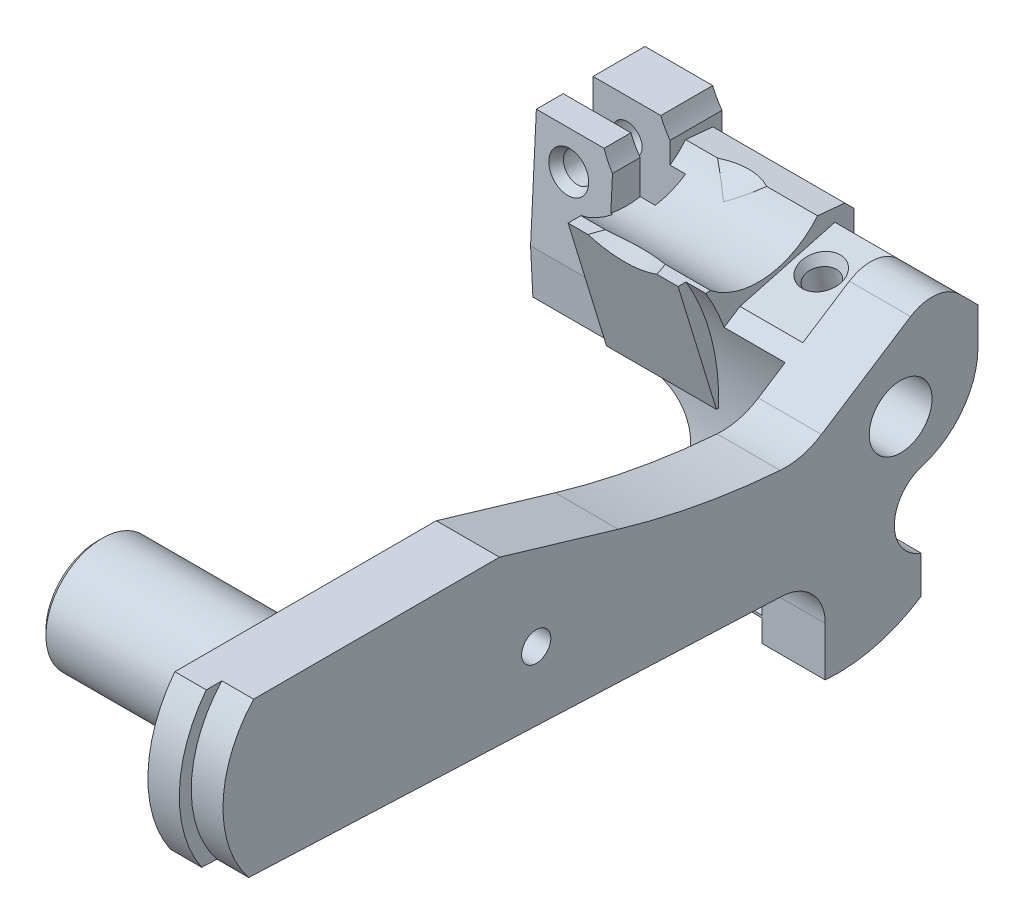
ISO-10303-21;
HEADER;
FILE_DESCRIPTION(('STEP AP214'),'2;1');
FILE_NAME('part.step','',(''),(''),'','','');
FILE_SCHEMA(('AUTOMOTIVE_DESIGN { 1 0 10303 214 1 1 1 1 }'));
ENDSEC;
DATA;
#1=APPLICATION_CONTEXT('core data for automotive mechanical design processes');
#2=APPLICATION_PROTOCOL_DEFINITION('international standard','automotive_design',2000,#1);
#3=PRODUCT_CONTEXT('',#1,'mechanical');
#4=PRODUCT('Part','Part','',(#3));
#5=PRODUCT_RELATED_PRODUCT_CATEGORY('part','',(#4));
#6=PRODUCT_DEFINITION_FORMATION('','',#4);
#7=PRODUCT_DEFINITION_CONTEXT('part definition',#1,'design');
#8=PRODUCT_DEFINITION('design','',#6,#7);
#9=PRODUCT_DEFINITION_SHAPE('','',#8);
#10=(LENGTH_UNIT() NAMED_UNIT(*) SI_UNIT(.MILLI.,.METRE.));
#11=(NAMED_UNIT(*) PLANE_ANGLE_UNIT() SI_UNIT($,.RADIAN.));
#12=(NAMED_UNIT(*) SI_UNIT($,.STERADIAN.) SOLID_ANGLE_UNIT());
#13=UNCERTAINTY_MEASURE_WITH_UNIT(LENGTH_MEASURE(1.E-05),#10,'distance_accuracy_value','');
#14=(GEOMETRIC_REPRESENTATION_CONTEXT(3) GLOBAL_UNCERTAINTY_ASSIGNED_CONTEXT((#13)) GLOBAL_UNIT_ASSIGNED_CONTEXT((#10,
#11,#12)) REPRESENTATION_CONTEXT('',''));
#15=CARTESIAN_POINT('',(0.,0.,0.));
#16=DIRECTION('',(0.,0.,1.));
#17=DIRECTION('',(1.,0.,0.));
#18=AXIS2_PLACEMENT_3D('',#15,#16,#17);
#19=CARTESIAN_POINT('',(-19.05,0.,-45.339));
#20=DIRECTION('',(1.,0.,0.));
#21=DIRECTION('',(0.,0.,-1.));
#22=AXIS2_PLACEMENT_3D('',#19,#20,#21);
#23=PLANE('',#22);
#24=DIRECTION('',(0.,-1.,0.));
#25=VECTOR('',#24,1.);
#26=CARTESIAN_POINT('',(-19.05,0.,-47.3964));
#27=LINE('',#26,#25);
#28=CARTESIAN_POINT('',(-19.05,1.48953188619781,-47.3964));
#29=VERTEX_POINT('',#28);
#30=CARTESIAN_POINT('',(-19.05,-1.143,-47.3964));
#31=VERTEX_POINT('',#30);
#32=EDGE_CURVE('E680',#29,#31,#27,.T.);
#33=ORIENTED_EDGE('',*,*,#32,.T.);
#34=DIRECTION('',(0.,0.,-1.));
#35=VECTOR('',#34,1.);
#36=CARTESIAN_POINT('',(-19.05,-1.143,-45.339));
#37=LINE('',#36,#35);
#38=CARTESIAN_POINT('',(-19.05,-1.143,-47.6072925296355));
#39=VERTEX_POINT('',#38);
#40=EDGE_CURVE('E433',#31,#39,#37,.T.);
#41=ORIENTED_EDGE('',*,*,#40,.T.);
#42=CARTESIAN_POINT('',(-19.05,0.,-45.339));
#43=DIRECTION('',(1.,0.,0.));
#44=DIRECTION('',(0.,0.,-1.));
#45=AXIS2_PLACEMENT_3D('',#42,#43,#44);
#46=CIRCLE('',#45,2.54);
#47=EDGE_CURVE('E682',#39,#29,#46,.T.);
#48=ORIENTED_EDGE('',*,*,#47,.T.);
#49=EDGE_LOOP('',(#33,#41,#48));
#50=FACE_BOUND('',#49,.T.);
#51=ADVANCED_FACE('F39',(#50),#23,.T.);
#52=CARTESIAN_POINT('',(-74.9648269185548,-3.683,-42.2587708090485));
#53=DIRECTION('',(0.,1.,0.));
#54=DIRECTION('',(0.,0.,1.));
#55=AXIS2_PLACEMENT_3D('',#52,#53,#54);
#56=PLANE('',#55);
#57=DIRECTION('',(-1.,0.,0.));
#58=VECTOR('',#57,1.);
#59=CARTESIAN_POINT('',(5.1054,-3.683,-48.5313784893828));
#60=LINE('',#59,#58);
#61=CARTESIAN_POINT('',(-19.4861159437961,-3.683,-48.5313784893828));
#62=VERTEX_POINT('',#61);
#63=CARTESIAN_POINT('',(-21.8186,-3.683,-48.5313784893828));
#64=VERTEX_POINT('',#63);
#65=EDGE_CURVE('E451',#62,#64,#60,.T.);
#66=ORIENTED_EDGE('',*,*,#65,.F.);
#67=CARTESIAN_POINT('',(-18.669,-3.683,-46.1264));
#68=DIRECTION('',(0.,-1.,0.));
#69=DIRECTION('',(0.,0.,-1.));
#70=AXIS2_PLACEMENT_3D('',#67,#68,#69);
#71=CIRCLE('',#70,2.54);
#72=CARTESIAN_POINT('',(-20.8687045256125,-3.683,-47.3964));
#73=VERTEX_POINT('',#72);
#74=EDGE_CURVE('E429',#73,#62,#71,.T.);
#75=ORIENTED_EDGE('',*,*,#74,.F.);
#76=DIRECTION('',(1.,0.,0.));
#77=VECTOR('',#76,1.);
#78=CARTESIAN_POINT('',(-21.8186,-3.683,-47.3964));
#79=LINE('',#78,#77);
#80=CARTESIAN_POINT('',(-21.8186,-3.683,-47.3964));
#81=VERTEX_POINT('',#80);
#82=EDGE_CURVE('E776',#81,#73,#79,.T.);
#83=ORIENTED_EDGE('',*,*,#82,.F.);
#84=DIRECTION('',(0.,0.,1.));
#85=VECTOR('',#84,1.);
#86=CARTESIAN_POINT('',(-21.8186,-3.683,-42.2587708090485));
#87=LINE('',#86,#85);
#88=EDGE_CURVE('E1148',#64,#81,#87,.T.);
#89=ORIENTED_EDGE('',*,*,#88,.F.);
#90=EDGE_LOOP('',(#66,#75,#83,#89));
#91=FACE_BOUND('',#90,.T.);
#92=ADVANCED_FACE('F670',(#91),#56,.F.);
#93=CARTESIAN_POINT('',(-31.803975,6.35,-47.3964));
#94=DIRECTION('',(0.,0.,1.));
#95=DIRECTION('',(1.,0.,0.));
#96=AXIS2_PLACEMENT_3D('',#93,#94,#95);
#97=PLANE('',#96);
#98=DIRECTION('',(0.,-1.,0.));
#99=VECTOR('',#98,1.);
#100=CARTESIAN_POINT('',(-16.4692954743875,-1.143,-47.3964));
#101=LINE('',#100,#99);
#102=CARTESIAN_POINT('',(-16.4692954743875,-2.00383206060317,-47.3964));
#103=VERTEX_POINT('',#102);
#104=CARTESIAN_POINT('',(-16.4692954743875,-1.48953188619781,-47.3964));
#105=VERTEX_POINT('',#104);
#106=EDGE_CURVE('E741',#103,#105,#101,.F.);
#107=ORIENTED_EDGE('',*,*,#106,.F.);
#108=CARTESIAN_POINT('',(-31.803975,6.35,-47.3964));
#109=DIRECTION('',(0.,0.,1.));
#110=DIRECTION('',(1.,0.,0.));
#111=AXIS2_PLACEMENT_3D('',#108,#109,#110);
#112=CIRCLE('',#111,17.4625);
#113=CARTESIAN_POINT('',(-16.2001086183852,-1.48953188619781,-47.3964));
#114=VERTEX_POINT('',#113);
#115=EDGE_CURVE('E783',#103,#114,#112,.T.);
#116=ORIENTED_EDGE('',*,*,#115,.T.);
#117=DIRECTION('',(-1.,0.,0.));
#118=VECTOR('',#117,1.);
#119=CARTESIAN_POINT('',(5.1054,-1.48953188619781,-47.3964));
#120=LINE('',#119,#118);
#121=EDGE_CURVE('E684',#105,#114,#120,.F.);
#122=ORIENTED_EDGE('',*,*,#121,.F.);
#123=EDGE_LOOP('',(#107,#116,#122));
#124=FACE_BOUND('',#123,.T.);
#125=ADVANCED_FACE('F675',(#124),#97,.T.);
#126=CARTESIAN_POINT('',(-74.9648269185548,9.33028138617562,-51.59375));
#127=DIRECTION('',(0.,-1.,0.));
#128=DIRECTION('',(0.,0.,-1.));
#129=AXIS2_PLACEMENT_3D('',#126,#127,#128);
#130=PLANE('',#129);
#131=DIRECTION('',(-1.,0.,0.));
#132=VECTOR('',#131,1.);
#133=CARTESIAN_POINT('',(-14.5976729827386,9.33028138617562,-47.3964));
#134=LINE('',#133,#132);
#135=CARTESIAN_POINT('',(-16.3427634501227,9.33028138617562,-47.3964));
#136=VERTEX_POINT('',#135);
#137=CARTESIAN_POINT('',(-21.8186,9.33028138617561,-47.3964));
#138=VERTEX_POINT('',#137);
#139=EDGE_CURVE('E786',#136,#138,#134,.T.);
#140=ORIENTED_EDGE('',*,*,#139,.F.);
#141=DIRECTION('',(0.,0.,-1.));
#142=VECTOR('',#141,1.);
#143=CARTESIAN_POINT('',(-16.3427634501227,9.33028138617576,10.414));
#144=LINE('',#143,#142);
#145=CARTESIAN_POINT('',(-16.3427634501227,9.33028138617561,-51.59375));
#146=VERTEX_POINT('',#145);
#147=EDGE_CURVE('E1184',#136,#146,#144,.T.);
#148=ORIENTED_EDGE('',*,*,#147,.T.);
#149=DIRECTION('',(1.,0.,0.));
#150=VECTOR('',#149,1.);
#151=CARTESIAN_POINT('',(-74.9648269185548,9.33028138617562,-51.59375));
#152=LINE('',#151,#150);
#153=CARTESIAN_POINT('',(-21.8186,9.33028138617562,-51.59375));
#154=VERTEX_POINT('',#153);
#155=EDGE_CURVE('E883',#154,#146,#152,.T.);
#156=ORIENTED_EDGE('',*,*,#155,.F.);
#157=DIRECTION('',(0.,0.,-1.));
#158=VECTOR('',#157,1.);
#159=CARTESIAN_POINT('',(-21.8186,9.33028138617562,-51.59375));
#160=LINE('',#159,#158);
#161=EDGE_CURVE('E1169',#138,#154,#160,.T.);
#162=ORIENTED_EDGE('',*,*,#161,.F.);
#163=EDGE_LOOP('',(#140,#148,#156,#162));
#164=FACE_BOUND('',#163,.T.);
#165=ADVANCED_FACE('F1182',(#164),#130,.F.);
#166=CARTESIAN_POINT('',(-15.5956,0.,0.));
#167=DIRECTION('',(-1.,0.,0.));
#168=DIRECTION('',(0.,0.,1.));
#169=AXIS2_PLACEMENT_3D('',#166,#167,#168);
#170=PLANE('',#169);
#171=DIRECTION('',(0.,1.,0.));
#172=VECTOR('',#171,1.);
#173=CARTESIAN_POINT('',(-15.5956,0.,-47.3964));
#174=LINE('',#173,#172);
#175=CARTESIAN_POINT('',(-15.5956,6.23476579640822,-47.3964));
#176=VERTEX_POINT('',#175);
#177=CARTESIAN_POINT('',(-15.5956,7.96813189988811,-47.3964));
#178=VERTEX_POINT('',#177);
#179=EDGE_CURVE('E62',#176,#178,#174,.T.);
#180=ORIENTED_EDGE('',*,*,#179,.F.);
#181=CARTESIAN_POINT('',(-15.5956,11.3284,-43.8658));
#182=DIRECTION('',(-1.,0.,0.));
#183=DIRECTION('',(0.,0.,-1.));
#184=AXIS2_PLACEMENT_3D('',#181,#182,#183);
#185=CIRCLE('',#184,6.1976);
#186=CARTESIAN_POINT('',(-15.5956,7.3914,-48.6522680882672));
#187=VERTEX_POINT('',#186);
#188=EDGE_CURVE('E804',#187,#176,#185,.T.);
#189=ORIENTED_EDGE('',*,*,#188,.F.);
#190=DIRECTION('',(0.,-0.0958457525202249,-0.995396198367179));
#191=VECTOR('',#190,1.);
#192=CARTESIAN_POINT('',(-15.5956,7.73468490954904,-45.0871179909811));
#193=LINE('',#192,#191);
#194=CARTESIAN_POINT('',(-15.5956,7.17884926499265,-50.8596918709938));
#195=VERTEX_POINT('',#194);
#196=EDGE_CURVE('E613',#187,#195,#193,.T.);
#197=ORIENTED_EDGE('',*,*,#196,.T.);
#198=DIRECTION('',(0.,0.707106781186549,0.707106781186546));
#199=VECTOR('',#198,1.);
#200=CARTESIAN_POINT('',(-15.5956,7.23854113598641,-50.8));
#201=LINE('',#200,#199);
#202=CARTESIAN_POINT('',(-15.5956,6.44479113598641,-51.59375));
#203=VERTEX_POINT('',#202);
#204=EDGE_CURVE('E1095',#203,#195,#201,.T.);
#205=ORIENTED_EDGE('',*,*,#204,.F.);
#206=DIRECTION('',(0.,-1.,0.));
#207=VECTOR('',#206,1.);
#208=CARTESIAN_POINT('',(-15.5956,9.33028138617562,-51.59375));
#209=LINE('',#208,#207);
#210=CARTESIAN_POINT('',(-15.5956,7.9681318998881,-51.59375));
#211=VERTEX_POINT('',#210);
#212=EDGE_CURVE('E1088',#211,#203,#209,.T.);
#213=ORIENTED_EDGE('',*,*,#212,.F.);
#214=DIRECTION('',(0.,0.,-1.));
#215=VECTOR('',#214,1.);
#216=CARTESIAN_POINT('',(-15.5956,7.96813189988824,10.414));
#217=LINE('',#216,#215);
#218=EDGE_CURVE('E806',#178,#211,#217,.T.);
#219=ORIENTED_EDGE('',*,*,#218,.F.);
#220=EDGE_LOOP('',(#180,#189,#197,#205,#213,#219));
#221=FACE_BOUND('',#220,.T.);
#222=ADVANCED_FACE('F651',(#221),#170,.F.);
#223=CARTESIAN_POINT('',(-21.8186,0.,0.));
#224=DIRECTION('',(-1.,0.,0.));
#225=DIRECTION('',(0.,0.,1.));
#226=AXIS2_PLACEMENT_3D('',#223,#224,#225);
#227=PLANE('',#226);
#228=ORIENTED_EDGE('',*,*,#88,.T.);
#229=DIRECTION('',(0.,-1.,0.));
#230=VECTOR('',#229,1.);
#231=CARTESIAN_POINT('',(-21.8186,9.33028138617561,-47.3964));
#232=LINE('',#231,#230);
#233=EDGE_CURVE('E788',#138,#81,#232,.T.);
#234=ORIENTED_EDGE('',*,*,#233,.F.);
#235=ORIENTED_EDGE('',*,*,#161,.T.);
#236=DIRECTION('',(0.,-1.,0.));
#237=VECTOR('',#236,1.);
#238=CARTESIAN_POINT('',(-21.8186,1.74967879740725,-51.59375));
#239=LINE('',#238,#237);
#240=CARTESIAN_POINT('',(-21.8186,1.74967879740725,-51.59375));
#241=VERTEX_POINT('',#240);
#242=EDGE_CURVE('E1166',#154,#241,#239,.T.);
#243=ORIENTED_EDGE('',*,*,#242,.T.);
#244=CARTESIAN_POINT('',(-21.8186,1.74967879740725,-45.24375));
#245=DIRECTION('',(-1.,0.,0.));
#246=DIRECTION('',(0.,0.,1.));
#247=AXIS2_PLACEMENT_3D('',#244,#245,#246);
#248=CIRCLE('',#247,6.34999999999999);
#249=EDGE_CURVE('E894',#241,#64,#248,.T.);
#250=ORIENTED_EDGE('',*,*,#249,.T.);
#251=EDGE_LOOP('',(#228,#234,#235,#243,#250));
#252=FACE_BOUND('',#251,.T.);
#253=ADVANCED_FACE('F1174',(#252),#227,.T.);
#254=CARTESIAN_POINT('',(-19.05,6.35000000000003,10.414));
#255=DIRECTION('',(0.,0.,-1.));
#256=DIRECTION('',(0.,1.,0.));
#257=AXIS2_PLACEMENT_3D('',#254,#255,#256);
#258=CYLINDRICAL_SURFACE('',#257,1.20015);
#259=CARTESIAN_POINT('',(-19.05,6.34999999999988,-50.8));
#260=DIRECTION('',(0.,0.,1.));
#261=DIRECTION('',(0.,-1.,0.));
#262=AXIS2_PLACEMENT_3D('',#259,#260,#261);
#263=CIRCLE('',#262,1.20015);
#264=CARTESIAN_POINT('',(-19.05,5.14984999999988,-50.8));
#265=VERTEX_POINT('',#264);
#266=EDGE_CURVE('E1239',#265,#265,#263,.F.);
#267=ORIENTED_EDGE('',*,*,#266,.T.);
#268=EDGE_LOOP('',(#267));
#269=FACE_BOUND('',#268,.T.);
#270=CARTESIAN_POINT('',(-19.05,6.34999999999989,-47.3964));
#271=DIRECTION('',(0.,0.,1.));
#272=DIRECTION('',(1.,0.,0.));
#273=AXIS2_PLACEMENT_3D('',#270,#271,#272);
#274=CIRCLE('',#273,1.20015);
#275=CARTESIAN_POINT('',(-17.84985,6.34999999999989,-47.3964));
#276=VERTEX_POINT('',#275);
#277=EDGE_CURVE('E685',#276,#276,#274,.F.);
#278=ORIENTED_EDGE('',*,*,#277,.F.);
#279=EDGE_LOOP('',(#278));
#280=FACE_BOUND('',#279,.T.);
#281=ADVANCED_FACE('F1439',(#269,#280),#258,.F.);
#282=CARTESIAN_POINT('',(-10.668,11.557,10.414));
#283=DIRECTION('',(0.,0.,-1.));
#284=DIRECTION('',(0.,1.,0.));
#285=AXIS2_PLACEMENT_3D('',#282,#283,#284);
#286=CYLINDRICAL_SURFACE('',#285,6.096);
#287=CARTESIAN_POINT('',(-10.668,11.5569999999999,-47.3964));
#288=DIRECTION('',(0.,0.,1.));
#289=DIRECTION('',(1.,0.,0.));
#290=AXIS2_PLACEMENT_3D('',#287,#288,#289);
#291=CIRCLE('',#290,6.096);
#292=EDGE_CURVE('E551',#178,#136,#291,.F.);
#293=ORIENTED_EDGE('',*,*,#292,.F.);
#294=ORIENTED_EDGE('',*,*,#218,.T.);
#295=CARTESIAN_POINT('',(-10.668,11.5569999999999,-51.59375));
#296=DIRECTION('',(0.,0.,-1.));
#297=DIRECTION('',(0.,1.,0.));
#298=AXIS2_PLACEMENT_3D('',#295,#296,#297);
#299=CIRCLE('',#298,6.096);
#300=EDGE_CURVE('E515',#211,#146,#299,.T.);
#301=ORIENTED_EDGE('',*,*,#300,.T.);
#302=ORIENTED_EDGE('',*,*,#147,.F.);
#303=EDGE_LOOP('',(#293,#294,#301,#302));
#304=FACE_BOUND('',#303,.T.);
#305=ADVANCED_FACE('F584',(#304),#286,.F.);
#306=CARTESIAN_POINT('',(-74.9648269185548,11.3284,-43.8658));
#307=DIRECTION('',(1.,0.,0.));
#308=DIRECTION('',(0.,0.,-1.));
#309=AXIS2_PLACEMENT_3D('',#306,#307,#308);
#310=CYLINDRICAL_SURFACE('',#309,6.1976);
#311=CARTESIAN_POINT('',(-14.3772748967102,5.2324,-44.9834));
#312=CARTESIAN_POINT('',(-14.3752618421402,5.26405677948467,-45.1561838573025));
#313=CARTESIAN_POINT('',(-14.3728279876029,5.30309655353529,-45.3276090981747));
#314=CARTESIAN_POINT('',(-14.3675094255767,5.39559942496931,-45.6666173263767));
#315=CARTESIAN_POINT('',(-14.364624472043,5.44907040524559,-45.8341981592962));
#316=CARTESIAN_POINT('',(-14.3588486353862,5.56899627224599,-46.1613059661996));
#317=CARTESIAN_POINT('',(-14.3559587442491,5.63520691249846,-46.3209226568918));
#318=CARTESIAN_POINT('',(-14.3506059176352,5.7806877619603,-46.6339933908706));
#319=CARTESIAN_POINT('',(-14.3481427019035,5.85994933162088,-46.7874514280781));
#320=CARTESIAN_POINT('',(-14.3451250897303,5.99018980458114,-47.0157067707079));
#321=CARTESIAN_POINT('',(-14.3442205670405,6.03663301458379,-47.0931202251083));
#322=CARTESIAN_POINT('',(-14.3427554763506,6.13308125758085,-47.2462037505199));
#323=CARTESIAN_POINT('',(-14.3421965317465,6.1831018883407,-47.3218640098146));
#324=CARTESIAN_POINT('',(-14.3418552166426,6.23476579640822,-47.3964));
#325=B_SPLINE_CURVE_WITH_KNOTS('',3,(#311,#312,#313,#314,#315,#316,#317,#318,#319,#320,#321,
#322,#323,#324),.UNSPECIFIED.,.F.,.F.,(4,2,2,2,2,2,4),(0.,0.526856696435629,1.05400176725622,
1.57189864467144,2.08945404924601,2.36022062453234,2.63224968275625),.UNSPECIFIED.);
#326=CARTESIAN_POINT('',(-14.3772748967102,5.2324,-44.9834));
#327=VERTEX_POINT('',#326);
#328=CARTESIAN_POINT('',(-14.3418552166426,6.23476579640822,-47.3964));
#329=VERTEX_POINT('',#328);
#330=EDGE_CURVE('E1054',#327,#329,#325,.T.);
#331=ORIENTED_EDGE('',*,*,#330,.F.);
#332=DIRECTION('',(1.,0.,0.));
#333=VECTOR('',#332,1.);
#334=CARTESIAN_POINT('',(-74.9648269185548,5.2324,-44.9834));
#335=LINE('',#334,#333);
#336=CARTESIAN_POINT('',(-15.5956,5.2324,-44.9834));
#337=VERTEX_POINT('',#336);
#338=EDGE_CURVE('E698',#327,#337,#335,.F.);
#339=ORIENTED_EDGE('',*,*,#338,.T.);
#340=CARTESIAN_POINT('',(-15.5956,5.25990641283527,-42.6073758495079));
#341=VERTEX_POINT('',#340);
#342=EDGE_CURVE('E812',#337,#341,#185,.T.);
#343=ORIENTED_EDGE('',*,*,#342,.T.);
#344=DIRECTION('',(1.,0.,0.));
#345=VECTOR('',#344,1.);
#346=CARTESIAN_POINT('',(-74.9648269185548,5.25990641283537,-42.6073758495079));
#347=LINE('',#346,#345);
#348=CARTESIAN_POINT('',(-15.4178,5.25990641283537,-42.6073758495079));
#349=VERTEX_POINT('',#348);
#350=EDGE_CURVE('E1080',#341,#349,#347,.T.);
#351=ORIENTED_EDGE('',*,*,#350,.T.);
#352=CARTESIAN_POINT('',(-15.4178,11.3284,-43.8658));
#353=DIRECTION('',(-1.,0.,0.));
#354=DIRECTION('',(0.,0.,1.));
#355=AXIS2_PLACEMENT_3D('',#352,#353,#354);
#356=CIRCLE('',#355,6.1976);
#357=CARTESIAN_POINT('',(-15.4178,6.477,-40.0090962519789));
#358=VERTEX_POINT('',#357);
#359=EDGE_CURVE('E1085',#358,#349,#356,.F.);
#360=ORIENTED_EDGE('',*,*,#359,.F.);
#361=DIRECTION('',(1.,0.,0.));
#362=VECTOR('',#361,1.);
#363=CARTESIAN_POINT('',(-74.9648269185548,6.47699999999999,-40.0090962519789));
#364=LINE('',#363,#362);
#365=CARTESIAN_POINT('',(-13.4473872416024,6.477,-40.0090962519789));
#366=VERTEX_POINT('',#365);
#367=EDGE_CURVE('E877',#358,#366,#364,.T.);
#368=ORIENTED_EDGE('',*,*,#367,.T.);
#369=CARTESIAN_POINT('',(-8.59981275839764,6.477,-40.0090962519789));
#370=CARTESIAN_POINT('',(-8.71501595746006,6.43605585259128,-40.0605910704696));
#371=CARTESIAN_POINT('',(-8.83222868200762,6.39806207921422,-40.1100781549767));
#372=CARTESIAN_POINT('',(-9.07067202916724,6.32805191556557,-40.2038093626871));
#373=CARTESIAN_POINT('',(-9.19190816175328,6.29604415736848,-40.2480458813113));
#374=CARTESIAN_POINT('',(-9.43882007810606,6.23802349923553,-40.3301442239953));
#375=CARTESIAN_POINT('',(-9.56451850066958,6.21204850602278,-40.3679653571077));
#376=CARTESIAN_POINT('',(-9.81921194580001,6.16654329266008,-40.4354733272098));
#377=CARTESIAN_POINT('',(-9.94820608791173,6.14701137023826,-40.4651623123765));
#378=CARTESIAN_POINT('',(-10.2101421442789,6.1144299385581,-40.5153265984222));
#379=CARTESIAN_POINT('',(-10.3431103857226,6.10144596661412,-40.5357085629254));
#380=CARTESIAN_POINT('',(-10.6107694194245,6.08243603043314,-40.5657352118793));
#381=CARTESIAN_POINT('',(-10.7454602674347,6.07641029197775,-40.5753795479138));
#382=CARTESIAN_POINT('',(-11.014750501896,6.07143123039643,-40.5833386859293));
#383=CARTESIAN_POINT('',(-11.1493478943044,6.0724482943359,-40.5817009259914));
#384=CARTESIAN_POINT('',(-11.417673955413,6.08146079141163,-40.5673262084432));
#385=CARTESIAN_POINT('',(-11.5514026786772,6.08945578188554,-40.5545899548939));
#386=CARTESIAN_POINT('',(-11.9169771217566,6.12093338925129,-40.5051424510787));
#387=CARTESIAN_POINT('',(-12.1468042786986,6.15154746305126,-40.4575961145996));
#388=CARTESIAN_POINT('',(-12.5962315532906,6.23286506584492,-40.3372151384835));
#389=CARTESIAN_POINT('',(-12.8158100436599,6.28360910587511,-40.2643295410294));
#390=CARTESIAN_POINT('',(-13.1003499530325,6.36398762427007,-40.1555426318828));
#391=CARTESIAN_POINT('',(-13.170864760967,6.38516440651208,-40.1273500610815));
#392=CARTESIAN_POINT('',(-13.3102704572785,6.42955110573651,-40.0693739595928));
#393=CARTESIAN_POINT('',(-13.3791662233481,6.45275353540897,-40.0395964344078));
#394=CARTESIAN_POINT('',(-13.4473872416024,6.477,-40.0090962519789));
#395=B_SPLINE_CURVE_WITH_KNOTS('',3,(#369,#370,#371,#372,#373,#374,#375,#376,#377,#378,#379,
#380,#381,#382,#383,#384,#385,#386,#387,#388,#389,#390,#391,#392,#393,#394),.UNSPECIFIED.,.F.,
.F.,(4,2,2,2,2,2,2,2,2,2,2,2,4),(0.,0.398014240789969,0.796598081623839,1.19762246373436,
1.59854080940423,2.00339596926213,2.40826426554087,2.81143124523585,3.21457265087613,
3.92157307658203,4.63000359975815,4.86648467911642,5.10212594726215),.UNSPECIFIED.);
#396=CARTESIAN_POINT('',(-8.59981275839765,6.47699999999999,-40.0090962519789));
#397=VERTEX_POINT('',#396);
#398=EDGE_CURVE('E591',#397,#366,#395,.T.);
#399=ORIENTED_EDGE('',*,*,#398,.F.);
#400=CARTESIAN_POINT('',(-4.9276,6.47699999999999,-40.0090962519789));
#401=VERTEX_POINT('',#400);
#402=EDGE_CURVE('E876',#397,#401,#364,.T.);
#403=ORIENTED_EDGE('',*,*,#402,.T.);
#404=CARTESIAN_POINT('',(-4.9276,11.3284,-43.8658));
#405=DIRECTION('',(1.,0.,0.));
#406=DIRECTION('',(0.,0.,-1.));
#407=AXIS2_PLACEMENT_3D('',#404,#405,#406);
#408=CIRCLE('',#407,6.1976);
#409=CARTESIAN_POINT('',(-4.9276,7.3914,-48.6522680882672));
#410=VERTEX_POINT('',#409);
#411=EDGE_CURVE('E842',#410,#401,#408,.F.);
#412=ORIENTED_EDGE('',*,*,#411,.F.);
#413=DIRECTION('',(1.,0.,0.));
#414=VECTOR('',#413,1.);
#415=CARTESIAN_POINT('',(-74.9648269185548,7.3914,-48.6522680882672));
#416=LINE('',#415,#414);
#417=CARTESIAN_POINT('',(-9.03631674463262,7.3914,-48.6522680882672));
#418=VERTEX_POINT('',#417);
#419=EDGE_CURVE('E1113',#410,#418,#416,.F.);
#420=ORIENTED_EDGE('',*,*,#419,.T.);
#421=CARTESIAN_POINT('',(-9.03631674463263,7.3914,-48.6522680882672));
#422=CARTESIAN_POINT('',(-9.19848840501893,7.25951171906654,-48.5437628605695));
#423=CARTESIAN_POINT('',(-9.36182475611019,7.13296331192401,-48.4305564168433));
#424=CARTESIAN_POINT('',(-9.69024912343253,6.89064272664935,-48.1953645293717));
#425=CARTESIAN_POINT('',(-9.85533755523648,6.77487317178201,-48.0733769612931));
#426=CARTESIAN_POINT('',(-10.1855211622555,6.55499536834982,-47.8221273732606));
#427=CARTESIAN_POINT('',(-10.3506091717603,6.45081552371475,-47.692918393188));
#428=CARTESIAN_POINT('',(-10.6812861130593,6.25345549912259,-47.4270609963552));
#429=CARTESIAN_POINT('',(-10.8468748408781,6.16027133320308,-47.2904153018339));
#430=CARTESIAN_POINT('',(-11.0161549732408,6.07074210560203,-47.147155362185));
#431=CARTESIAN_POINT('',(-11.0198774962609,6.06877616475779,-47.1440032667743));
#432=CARTESIAN_POINT('',(-11.0236,6.06681306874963,-47.1408494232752));
#433=B_SPLINE_CURVE_WITH_KNOTS('',3,(#421,#422,#423,#424,#425,#426,#427,#428,#429,#430,#431,
#432),.UNSPECIFIED.,.F.,.F.,(4,2,2,2,2,4),(0.,0.706405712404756,1.41298289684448,
2.11491936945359,2.81660060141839,2.83237780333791),.UNSPECIFIED.);
#434=CARTESIAN_POINT('',(-11.0236,6.06681306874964,-47.1408494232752));
#435=VERTEX_POINT('',#434);
#436=EDGE_CURVE('E601',#435,#418,#433,.F.);
#437=ORIENTED_EDGE('',*,*,#436,.F.);
#438=CARTESIAN_POINT('',(-13.0108832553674,7.3914,-48.6522680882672));
#439=CARTESIAN_POINT('',(-12.848711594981,7.25951171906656,-48.5437628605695));
#440=CARTESIAN_POINT('',(-12.6853752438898,7.13296331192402,-48.4305564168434));
#441=CARTESIAN_POINT('',(-12.3569508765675,6.89064272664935,-48.1953645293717));
#442=CARTESIAN_POINT('',(-12.1918624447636,6.774873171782,-48.0733769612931));
#443=CARTESIAN_POINT('',(-11.8616788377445,6.55499536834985,-47.8221273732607));
#444=CARTESIAN_POINT('',(-11.6965908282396,6.45081552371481,-47.6929183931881));
#445=CARTESIAN_POINT('',(-11.3659138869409,6.25345549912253,-47.4270609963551));
#446=CARTESIAN_POINT('',(-11.2003251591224,6.16027133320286,-47.2904153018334));
#447=CARTESIAN_POINT('',(-11.0310450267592,6.07074210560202,-47.147155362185));
#448=CARTESIAN_POINT('',(-11.0273225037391,6.06877616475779,-47.1440032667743));
#449=CARTESIAN_POINT('',(-11.0236,6.06681306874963,-47.1408494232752));
#450=B_SPLINE_CURVE_WITH_KNOTS('',3,(#438,#439,#440,#441,#442,#443,#444,#445,#446,#447,#448,
#449),.UNSPECIFIED.,.F.,.F.,(4,2,2,2,2,4),(0.,0.706405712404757,1.41298289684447,
2.1149193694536,2.8166006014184,2.83237780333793),.UNSPECIFIED.);
#451=CARTESIAN_POINT('',(-13.0108832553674,7.3914,-48.6522680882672));
#452=VERTEX_POINT('',#451);
#453=EDGE_CURVE('E608',#452,#435,#450,.T.);
#454=ORIENTED_EDGE('',*,*,#453,.F.);
#455=EDGE_CURVE('E809',#452,#187,#416,.F.);
#456=ORIENTED_EDGE('',*,*,#455,.T.);
#457=ORIENTED_EDGE('',*,*,#188,.T.);
#458=DIRECTION('',(1.,0.,0.));
#459=VECTOR('',#458,1.);
#460=CARTESIAN_POINT('',(-74.9648269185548,6.23476579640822,-47.3964));
#461=LINE('',#460,#459);
#462=EDGE_CURVE('E690',#329,#176,#461,.F.);
#463=ORIENTED_EDGE('',*,*,#462,.F.);
#464=EDGE_LOOP('',(#331,#339,#343,#351,#360,#368,#399,#403,#412,#420,#437,#454,#456,#457,#463));
#465=FACE_BOUND('',#464,.T.);
#466=ADVANCED_FACE('F579',(#465),#310,.F.);
#467=CARTESIAN_POINT('',(7.22295908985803,7.73468490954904,-45.0871179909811));
#468=DIRECTION('',(0.,-0.995396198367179,0.0958457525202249));
#469=DIRECTION('',(0.,-0.0958457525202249,-0.995396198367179));
#470=AXIS2_PLACEMENT_3D('',#467,#468,#469);
#471=PLANE('',#470);
#472=CARTESIAN_POINT('',(-11.0236,8.32198893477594,-38.9877324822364));
#473=DIRECTION('',(0.,-0.995396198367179,0.0958457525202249));
#474=DIRECTION('',(0.,0.0958457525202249,0.995396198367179));
#475=AXIS2_PLACEMENT_3D('',#472,#473,#474);
#476=ELLIPSE('',#475,10.2457154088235,6.223);
#477=EDGE_CURVE('E1041',#418,#452,#476,.F.);
#478=ORIENTED_EDGE('',*,*,#477,.F.);
#479=ORIENTED_EDGE('',*,*,#419,.F.);
#480=DIRECTION('',(0.,0.0958457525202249,0.995396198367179));
#481=VECTOR('',#480,1.);
#482=CARTESIAN_POINT('',(-4.9276,7.73468490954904,-45.0871179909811));
#483=LINE('',#482,#481);
#484=CARTESIAN_POINT('',(-4.9276,7.17884926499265,-50.8596918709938));
#485=VERTEX_POINT('',#484);
#486=EDGE_CURVE('E1107',#485,#410,#483,.T.);
#487=ORIENTED_EDGE('',*,*,#486,.F.);
#488=DIRECTION('',(1.,0.,0.));
#489=VECTOR('',#488,1.);
#490=CARTESIAN_POINT('',(3.3429834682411,7.17884926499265,-50.8596918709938));
#491=LINE('',#490,#489);
#492=EDGE_CURVE('E1109',#195,#485,#491,.T.);
#493=ORIENTED_EDGE('',*,*,#492,.F.);
#494=ORIENTED_EDGE('',*,*,#196,.F.);
#495=ORIENTED_EDGE('',*,*,#455,.F.);
#496=EDGE_LOOP('',(#478,#479,#487,#493,#494,#495));
#497=FACE_BOUND('',#496,.T.);
#498=ADVANCED_FACE('F583',(#497),#471,.F.);
#499=CARTESIAN_POINT('',(-16.3427634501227,9.33028138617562,-42.8111980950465));
#500=VERTEX_POINT('',#499);
#501=CARTESIAN_POINT('',(-16.3427634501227,9.33028138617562,-44.9834));
#502=VERTEX_POINT('',#501);
#503=EDGE_CURVE('E1187',#500,#502,#144,.T.);
#504=ORIENTED_EDGE('',*,*,#503,.T.);
#505=DIRECTION('',(-1.,0.,0.));
#506=VECTOR('',#505,1.);
#507=CARTESIAN_POINT('',(-14.5976729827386,9.33028138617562,-44.9834));
#508=LINE('',#507,#506);
#509=CARTESIAN_POINT('',(-21.8186,9.33028138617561,-44.9834));
#510=VERTEX_POINT('',#509);
#511=EDGE_CURVE('E775',#502,#510,#508,.T.);
#512=ORIENTED_EDGE('',*,*,#511,.T.);
#513=CARTESIAN_POINT('',(-21.8186,9.33028138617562,-42.8111980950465));
#514=VERTEX_POINT('',#513);
#515=EDGE_CURVE('E1168',#514,#510,#160,.T.);
#516=ORIENTED_EDGE('',*,*,#515,.F.);
#517=DIRECTION('',(1.,0.,0.));
#518=VECTOR('',#517,1.);
#519=CARTESIAN_POINT('',(-74.9648269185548,9.33028138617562,-42.8111980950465));
#520=LINE('',#519,#518);
#521=EDGE_CURVE('E880',#514,#500,#520,.T.);
#522=ORIENTED_EDGE('',*,*,#521,.T.);
#523=EDGE_LOOP('',(#504,#512,#516,#522));
#524=FACE_BOUND('',#523,.T.);
#525=ADVANCED_FACE('F578',(#524),#130,.F.);
#526=CARTESIAN_POINT('',(5.1054,4.699,-51.59375));
#527=DIRECTION('',(0.,0.,1.));
#528=DIRECTION('',(0.,-1.,0.));
#529=AXIS2_PLACEMENT_3D('',#526,#527,#528);
#530=PLANE('',#529);
#531=CARTESIAN_POINT('',(-19.05,6.34999999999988,-51.59375));
#532=DIRECTION('',(0.,0.,1.));
#533=DIRECTION('',(0.,-1.,0.));
#534=AXIS2_PLACEMENT_3D('',#531,#532,#533);
#535=CIRCLE('',#534,1.65842177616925);
#536=CARTESIAN_POINT('',(-19.05,4.69157822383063,-51.59375));
#537=VERTEX_POINT('',#536);
#538=EDGE_CURVE('E1237',#537,#537,#535,.T.);
#539=ORIENTED_EDGE('',*,*,#538,.T.);
#540=EDGE_LOOP('',(#539));
#541=FACE_BOUND('',#540,.T.);
#542=ORIENTED_EDGE('',*,*,#155,.T.);
#543=ORIENTED_EDGE('',*,*,#300,.F.);
#544=ORIENTED_EDGE('',*,*,#212,.T.);
#545=DIRECTION('',(-1.,0.,0.));
#546=VECTOR('',#545,1.);
#547=CARTESIAN_POINT('',(3.3429834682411,6.44479113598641,-51.59375));
#548=LINE('',#547,#546);
#549=CARTESIAN_POINT('',(-4.9276,6.44479113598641,-51.59375));
#550=VERTEX_POINT('',#549);
#551=EDGE_CURVE('E1098',#550,#203,#548,.T.);
#552=ORIENTED_EDGE('',*,*,#551,.F.);
#553=DIRECTION('',(0.,-1.,0.));
#554=VECTOR('',#553,1.);
#555=CARTESIAN_POINT('',(-4.9276,4.699,-51.59375));
#556=LINE('',#555,#554);
#557=CARTESIAN_POINT('',(-4.9276,4.699,-51.59375));
#558=VERTEX_POINT('',#557);
#559=EDGE_CURVE('E1189',#550,#558,#556,.T.);
#560=ORIENTED_EDGE('',*,*,#559,.T.);
#561=DIRECTION('',(-1.,0.,0.));
#562=VECTOR('',#561,1.);
#563=CARTESIAN_POINT('',(5.1054,4.699,-51.59375));
#564=LINE('',#563,#562);
#565=CARTESIAN_POINT('',(5.1054,4.699,-51.59375));
#566=VERTEX_POINT('',#565);
#567=EDGE_CURVE('E994',#566,#558,#564,.T.);
#568=ORIENTED_EDGE('',*,*,#567,.F.);
#569=DIRECTION('',(0.,1.,0.));
#570=VECTOR('',#569,1.);
#571=CARTESIAN_POINT('',(5.1054,4.699,-51.59375));
#572=LINE('',#571,#570);
#573=CARTESIAN_POINT('',(5.1054,1.74967879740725,-51.59375));
#574=VERTEX_POINT('',#573);
#575=EDGE_CURVE('E933',#574,#566,#572,.T.);
#576=ORIENTED_EDGE('',*,*,#575,.F.);
#577=DIRECTION('',(-1.,0.,0.));
#578=VECTOR('',#577,1.);
#579=CARTESIAN_POINT('',(5.1054,1.74967879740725,-51.59375));
#580=LINE('',#579,#578);
#581=EDGE_CURVE('E996',#574,#241,#580,.T.);
#582=ORIENTED_EDGE('',*,*,#581,.T.);
#583=ORIENTED_EDGE('',*,*,#242,.F.);
#584=EDGE_LOOP('',(#542,#543,#544,#552,#560,#568,#576,#582,#583));
#585=FACE_BOUND('',#584,.T.);
#586=ADVANCED_FACE('F649',(#541,#585),#530,.F.);
#587=ORIENTED_EDGE('',*,*,#342,.F.);
#588=DIRECTION('',(0.,1.,0.));
#589=VECTOR('',#588,1.);
#590=CARTESIAN_POINT('',(-15.5956,0.,-44.9834));
#591=LINE('',#590,#589);
#592=CARTESIAN_POINT('',(-15.5956,7.96813189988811,-44.9834));
#593=VERTEX_POINT('',#592);
#594=EDGE_CURVE('E695',#337,#593,#591,.T.);
#595=ORIENTED_EDGE('',*,*,#594,.T.);
#596=CARTESIAN_POINT('',(-15.5956,7.96813189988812,-42.7429890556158));
#597=VERTEX_POINT('',#596);
#598=EDGE_CURVE('E1076',#597,#593,#217,.T.);
#599=ORIENTED_EDGE('',*,*,#598,.F.);
#600=DIRECTION('',(0.,0.998748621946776,-0.0500119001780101));
#601=VECTOR('',#600,1.);
#602=CARTESIAN_POINT('',(-15.5956,5.25990641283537,-42.6073758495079));
#603=LINE('',#602,#601);
#604=EDGE_CURVE('E811',#341,#597,#603,.T.);
#605=ORIENTED_EDGE('',*,*,#604,.F.);
#606=EDGE_LOOP('',(#587,#595,#599,#605));
#607=FACE_BOUND('',#606,.T.);
#608=ADVANCED_FACE('F645',(#607),#170,.F.);
#609=CARTESIAN_POINT('',(3.3429834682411,7.23854113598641,-50.8));
#610=DIRECTION('',(0.,-0.707106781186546,0.707106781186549));
#611=DIRECTION('',(0.,-0.707106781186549,-0.707106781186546));
#612=AXIS2_PLACEMENT_3D('',#609,#610,#611);
#613=PLANE('',#612);
#614=ORIENTED_EDGE('',*,*,#204,.T.);
#615=ORIENTED_EDGE('',*,*,#492,.T.);
#616=DIRECTION('',(0.,0.707106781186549,0.707106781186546));
#617=VECTOR('',#616,1.);
#618=CARTESIAN_POINT('',(-4.9276,7.23854113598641,-50.8));
#619=LINE('',#618,#617);
#620=EDGE_CURVE('E817',#550,#485,#619,.T.);
#621=ORIENTED_EDGE('',*,*,#620,.F.);
#622=ORIENTED_EDGE('',*,*,#551,.T.);
#623=EDGE_LOOP('',(#614,#615,#621,#622));
#624=FACE_BOUND('',#623,.T.);
#625=ADVANCED_FACE('F648',(#624),#613,.F.);
#626=CARTESIAN_POINT('',(-74.9648269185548,6.47699999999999,-38.976182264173));
#627=DIRECTION('',(0.,-1.,0.));
#628=DIRECTION('',(0.,0.,-1.));
#629=AXIS2_PLACEMENT_3D('',#626,#627,#628);
#630=PLANE('',#629);
#631=CARTESIAN_POINT('',(-11.0236,6.47700000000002,-4.46804984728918));
#632=DIRECTION('',(0.,-1.,0.));
#633=DIRECTION('',(0.,0.,1.));
#634=AXIS2_PLACEMENT_3D('',#631,#632,#633);
#635=ELLIPSE('',#634,38.5883151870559,6.223);
#636=CARTESIAN_POINT('',(-8.23855685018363,6.47699999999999,-38.976182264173));
#637=VERTEX_POINT('',#636);
#638=EDGE_CURVE('E1119',#637,#397,#635,.F.);
#639=ORIENTED_EDGE('',*,*,#638,.F.);
#640=DIRECTION('',(1.,0.,0.));
#641=VECTOR('',#640,1.);
#642=CARTESIAN_POINT('',(-74.9648269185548,6.47699999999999,-38.976182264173));
#643=LINE('',#642,#641);
#644=CARTESIAN_POINT('',(-6.5278,6.47699999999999,-38.976182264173));
#645=VERTEX_POINT('',#644);
#646=EDGE_CURVE('E866',#637,#645,#643,.T.);
#647=ORIENTED_EDGE('',*,*,#646,.T.);
#648=DIRECTION('',(0.,0.,-1.));
#649=VECTOR('',#648,1.);
#650=CARTESIAN_POINT('',(-6.5278,6.47699999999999,-38.976182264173));
#651=LINE('',#650,#649);
#652=CARTESIAN_POINT('',(-6.5278,6.47699999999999,-39.6147898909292));
#653=VERTEX_POINT('',#652);
#654=EDGE_CURVE('E827',#645,#653,#651,.T.);
#655=ORIENTED_EDGE('',*,*,#654,.T.);
#656=DIRECTION('',(1.,0.,0.));
#657=VECTOR('',#656,1.);
#658=CARTESIAN_POINT('',(-28.8402260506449,6.47699999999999,-39.6147898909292));
#659=LINE('',#658,#657);
#660=CARTESIAN_POINT('',(-4.9276,6.47699999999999,-39.6147898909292));
#661=VERTEX_POINT('',#660);
#662=EDGE_CURVE('E815',#653,#661,#659,.T.);
#663=ORIENTED_EDGE('',*,*,#662,.T.);
#664=DIRECTION('',(0.,0.,1.));
#665=VECTOR('',#664,1.);
#666=CARTESIAN_POINT('',(-4.9276,6.47699999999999,-38.976182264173));
#667=LINE('',#666,#665);
#668=EDGE_CURVE('E844',#401,#661,#667,.T.);
#669=ORIENTED_EDGE('',*,*,#668,.F.);
#670=ORIENTED_EDGE('',*,*,#402,.F.);
#671=EDGE_LOOP('',(#639,#647,#655,#663,#669,#670));
#672=FACE_BOUND('',#671,.T.);
#673=ADVANCED_FACE('F586',(#672),#630,.F.);
#674=CARTESIAN_POINT('',(-13.8086431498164,6.47699999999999,-38.976182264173));
#675=VERTEX_POINT('',#674);
#676=EDGE_CURVE('E1116',#366,#675,#635,.F.);
#677=ORIENTED_EDGE('',*,*,#676,.F.);
#678=ORIENTED_EDGE('',*,*,#367,.F.);
#679=DIRECTION('',(0.,0.,1.));
#680=VECTOR('',#679,1.);
#681=CARTESIAN_POINT('',(-15.4178,6.477,-42.6683212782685));
#682=LINE('',#681,#680);
#683=CARTESIAN_POINT('',(-15.4178,6.47699999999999,-38.976182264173));
#684=VERTEX_POINT('',#683);
#685=EDGE_CURVE('E1126',#358,#684,#682,.T.);
#686=ORIENTED_EDGE('',*,*,#685,.T.);
#687=EDGE_CURVE('E873',#684,#675,#643,.T.);
#688=ORIENTED_EDGE('',*,*,#687,.T.);
#689=EDGE_LOOP('',(#677,#678,#686,#688));
#690=FACE_BOUND('',#689,.T.);
#691=ADVANCED_FACE('F1568',(#690),#630,.F.);
#692=CARTESIAN_POINT('',(-74.9648269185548,-3.683,-42.082405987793));
#693=DIRECTION('',(0.,0.29237170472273,-0.956304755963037));
#694=DIRECTION('',(0.,0.956304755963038,0.29237170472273));
#695=AXIS2_PLACEMENT_3D('',#692,#693,#694);
#696=PLANE('',#695);
#697=CARTESIAN_POINT('',(-11.0236,11.847510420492,-37.3342524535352));
#698=DIRECTION('',(0.,0.29237170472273,-0.956304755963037));
#699=DIRECTION('',(0.,0.956304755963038,0.29237170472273));
#700=AXIS2_PLACEMENT_3D('',#697,#698,#699);
#701=ELLIPSE('',#700,6.27991274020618,6.223);
#702=EDGE_CURVE('E1121',#675,#637,#701,.F.);
#703=ORIENTED_EDGE('',*,*,#702,.F.);
#704=ORIENTED_EDGE('',*,*,#687,.F.);
#705=DIRECTION('',(0.,-0.956304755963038,-0.29237170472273));
#706=VECTOR('',#705,1.);
#707=CARTESIAN_POINT('',(-15.4178,6.47699999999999,-38.976182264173));
#708=LINE('',#707,#706);
#709=CARTESIAN_POINT('',(-15.4178,-3.683,-42.082405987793));
#710=VERTEX_POINT('',#709);
#711=EDGE_CURVE('E1086',#684,#710,#708,.T.);
#712=ORIENTED_EDGE('',*,*,#711,.T.);
#713=DIRECTION('',(1.,0.,0.));
#714=VECTOR('',#713,1.);
#715=CARTESIAN_POINT('',(-74.9648269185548,-3.683,-42.082405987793));
#716=LINE('',#715,#714);
#717=CARTESIAN_POINT('',(-6.5278,-3.683,-42.082405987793));
#718=VERTEX_POINT('',#717);
#719=EDGE_CURVE('E863',#710,#718,#716,.T.);
#720=ORIENTED_EDGE('',*,*,#719,.T.);
#721=DIRECTION('',(0.,0.956304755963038,0.29237170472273));
#722=VECTOR('',#721,1.);
#723=CARTESIAN_POINT('',(-6.5278,-3.683,-42.082405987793));
#724=LINE('',#723,#722);
#725=EDGE_CURVE('E1038',#718,#645,#724,.T.);
#726=ORIENTED_EDGE('',*,*,#725,.T.);
#727=ORIENTED_EDGE('',*,*,#646,.F.);
#728=EDGE_LOOP('',(#703,#704,#712,#720,#726,#727));
#729=FACE_BOUND('',#728,.T.);
#730=ADVANCED_FACE('F577',(#729),#696,.F.);
#731=CARTESIAN_POINT('',(-74.9648269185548,9.33028138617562,-42.8111980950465));
#732=DIRECTION('',(0.,-0.0500119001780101,-0.998748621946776));
#733=DIRECTION('',(0.,0.998748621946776,-0.0500119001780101));
#734=AXIS2_PLACEMENT_3D('',#731,#732,#733);
#735=PLANE('',#734);
#736=CARTESIAN_POINT('',(-19.05,7.99554515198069,-42.7443617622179));
#737=CARTESIAN_POINT('',(-19.0762931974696,7.99554516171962,-42.7443617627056));
#738=CARTESIAN_POINT('',(-19.1025862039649,7.99489776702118,-42.7443293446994));
#739=CARTESIAN_POINT('',(-19.1551087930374,7.99231439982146,-42.7441999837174));
#740=CARTESIAN_POINT('',(-19.1813383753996,7.99037842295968,-42.7441030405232));
#741=CARTESIAN_POINT('',(-19.2336712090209,7.98522409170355,-42.7438449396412));
#742=CARTESIAN_POINT('',(-19.2597744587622,7.9820057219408,-42.7436837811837));
#743=CARTESIAN_POINT('',(-19.3117918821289,7.97429278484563,-42.7432975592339));
#744=CARTESIAN_POINT('',(-19.3377060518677,7.96979819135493,-42.7430724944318));
#745=CARTESIAN_POINT('',(-19.3892817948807,7.95953913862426,-42.7425587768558));
#746=CARTESIAN_POINT('',(-19.4149433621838,7.95377464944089,-42.7422701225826));
#747=CARTESIAN_POINT('',(-19.4659528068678,7.94099426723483,-42.7416301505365));
#748=CARTESIAN_POINT('',(-19.491300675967,7.93397834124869,-42.741278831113));
#749=CARTESIAN_POINT('',(-19.5416223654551,7.91871342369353,-42.7405144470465));
#750=CARTESIAN_POINT('',(-19.5665961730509,7.91046439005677,-42.7401013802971));
#751=CARTESIAN_POINT('',(-19.6161093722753,7.89275156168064,-42.7392144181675));
#752=CARTESIAN_POINT('',(-19.6406487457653,7.88328771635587,-42.7387405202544));
#753=CARTESIAN_POINT('',(-19.6892320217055,7.86316386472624,-42.7377328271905));
#754=CARTESIAN_POINT('',(-19.7132759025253,7.85250380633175,-42.7371990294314));
#755=CARTESIAN_POINT('',(-19.7608118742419,7.83001755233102,-42.7360730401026));
#756=CARTESIAN_POINT('',(-19.7843039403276,7.81819130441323,-42.7354808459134));
#757=CARTESIAN_POINT('',(-19.830680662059,7.79340243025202,-42.7342395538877));
#758=CARTESIAN_POINT('',(-19.8535652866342,7.7804397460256,-42.7335904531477));
#759=CARTESIAN_POINT('',(-19.898671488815,7.75340772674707,-42.732236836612));
#760=CARTESIAN_POINT('',(-19.9208930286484,7.73933832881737,-42.7315323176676));
#761=CARTESIAN_POINT('',(-19.9646168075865,7.71012303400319,-42.7300693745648));
#762=CARTESIAN_POINT('',(-19.9861190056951,7.69497707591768,-42.7293109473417));
#763=CARTESIAN_POINT('',(-20.0283547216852,7.66364909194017,-42.7277422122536));
#764=CARTESIAN_POINT('',(-20.049088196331,7.64746700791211,-42.7269319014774));
#765=CARTESIAN_POINT('',(-20.0897377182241,7.61410680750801,-42.725261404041));
#766=CARTESIAN_POINT('',(-20.1096537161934,7.59692863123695,-42.7244012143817));
#767=CARTESIAN_POINT('',(-20.1486195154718,7.56161625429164,-42.7226329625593));
#768=CARTESIAN_POINT('',(-20.1676692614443,7.54348199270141,-42.721724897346));
#769=CARTESIAN_POINT('',(-20.2048532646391,7.50629798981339,-42.7198629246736));
#770=CARTESIAN_POINT('',(-20.2229874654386,7.48724819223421,-42.7189090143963));
#771=CARTESIAN_POINT('',(-20.258299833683,7.4482824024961,-42.7169578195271));
#772=CARTESIAN_POINT('',(-20.2754779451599,7.4283663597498,-42.7159605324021));
#773=CARTESIAN_POINT('',(-20.3088381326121,7.3877168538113,-42.713925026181));
#774=CARTESIAN_POINT('',(-20.3250201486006,7.36698334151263,-42.7128868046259));
#775=CARTESIAN_POINT('',(-20.3563481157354,7.32474764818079,-42.7107718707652));
#776=CARTESIAN_POINT('',(-20.3714940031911,7.30324542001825,-42.7096951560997));
#777=CARTESIAN_POINT('',(-20.4007092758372,7.2595216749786,-42.7075057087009));
#778=CARTESIAN_POINT('',(-20.4147785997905,7.23730011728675,-42.7063929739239));
#779=CARTESIAN_POINT('',(-20.4418105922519,7.19219395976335,-42.704134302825));
#780=CARTESIAN_POINT('',(-20.4547732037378,7.16930932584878,-42.7029883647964));
#781=CARTESIAN_POINT('',(-20.4795620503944,7.12293265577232,-42.7006660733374));
#782=CARTESIAN_POINT('',(-20.4913882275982,7.09944058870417,-42.6994897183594));
#783=CARTESIAN_POINT('',(-20.513874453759,7.05190467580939,-42.6971093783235));
#784=CARTESIAN_POINT('',(-20.5245344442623,7.02786080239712,-42.6959053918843));
#785=CARTESIAN_POINT('',(-20.544658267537,6.97927759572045,-42.6934726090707));
#786=CARTESIAN_POINT('',(-20.554122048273,6.95473824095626,-42.6922438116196));
#787=CARTESIAN_POINT('',(-20.5718348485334,6.9052251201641,-42.6897644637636));
#788=CARTESIAN_POINT('',(-20.5800838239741,6.8802513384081,-42.688513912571));
#789=CARTESIAN_POINT('',(-20.5953487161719,6.82992973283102,-42.6859940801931));
#790=CARTESIAN_POINT('',(-20.6023645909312,6.80458189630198,-42.6847247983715));
#791=CARTESIAN_POINT('',(-20.6151449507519,6.75357254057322,-42.6821705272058));
#792=CARTESIAN_POINT('',(-20.6209093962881,6.72791101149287,-42.6808855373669));
#793=CARTESIAN_POINT('',(-20.6311684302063,6.67633536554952,-42.6783029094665));
#794=CARTESIAN_POINT('',(-20.6356629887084,6.65042124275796,-42.6770052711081));
#795=CARTESIAN_POINT('',(-20.6433759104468,6.59840391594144,-42.6744005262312));
#796=CARTESIAN_POINT('',(-20.6465942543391,6.57230070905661,-42.6730934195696));
#797=CARTESIAN_POINT('',(-20.6517485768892,6.51996799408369,-42.6704728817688));
#798=CARTESIAN_POINT('',(-20.6536845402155,6.49373848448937,-42.6691594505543));
#799=CARTESIAN_POINT('',(-20.6562678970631,6.44121594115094,-42.6665294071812));
#800=CARTESIAN_POINT('',(-20.6569152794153,6.41492290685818,-42.6652127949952));
#801=CARTESIAN_POINT('',(-20.6569152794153,6.36233683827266,-42.6625795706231));
#802=CARTESIAN_POINT('',(-20.6562678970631,6.3360438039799,-42.6612629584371));
#803=CARTESIAN_POINT('',(-20.6536845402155,6.28352126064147,-42.658632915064));
#804=CARTESIAN_POINT('',(-20.6517485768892,6.25729175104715,-42.6573194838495));
#805=CARTESIAN_POINT('',(-20.6465942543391,6.20495903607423,-42.6546989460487));
#806=CARTESIAN_POINT('',(-20.6433759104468,6.1788558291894,-42.6533918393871));
#807=CARTESIAN_POINT('',(-20.6356629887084,6.12683850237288,-42.6507870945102));
#808=CARTESIAN_POINT('',(-20.6311684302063,6.10092437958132,-42.6494894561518));
#809=CARTESIAN_POINT('',(-20.6209093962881,6.04934873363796,-42.6469068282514));
#810=CARTESIAN_POINT('',(-20.6151449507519,6.02368720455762,-42.6456218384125));
#811=CARTESIAN_POINT('',(-20.6023645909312,5.97267784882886,-42.6430675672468));
#812=CARTESIAN_POINT('',(-20.5953487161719,5.94733001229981,-42.6417982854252));
#813=CARTESIAN_POINT('',(-20.5800838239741,5.89700840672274,-42.6392784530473));
#814=CARTESIAN_POINT('',(-20.5718348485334,5.87203462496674,-42.6380279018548));
#815=CARTESIAN_POINT('',(-20.554122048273,5.82252150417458,-42.6355485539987));
#816=CARTESIAN_POINT('',(-20.544658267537,5.79798214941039,-42.6343197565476));
#817=CARTESIAN_POINT('',(-20.5245344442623,5.74939894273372,-42.631886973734));
#818=CARTESIAN_POINT('',(-20.513874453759,5.72535506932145,-42.6306829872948));
#819=CARTESIAN_POINT('',(-20.4913882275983,5.67781915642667,-42.6283026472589));
#820=CARTESIAN_POINT('',(-20.4795620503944,5.65432708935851,-42.6271262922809));
#821=CARTESIAN_POINT('',(-20.4547732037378,5.60795041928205,-42.6248040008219));
#822=CARTESIAN_POINT('',(-20.4418105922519,5.58506578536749,-42.6236580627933));
#823=CARTESIAN_POINT('',(-20.4147785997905,5.53995962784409,-42.6213993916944));
#824=CARTESIAN_POINT('',(-20.4007092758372,5.51773807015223,-42.6202866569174));
#825=CARTESIAN_POINT('',(-20.3714940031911,5.47401432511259,-42.6180972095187));
#826=CARTESIAN_POINT('',(-20.3563481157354,5.45251209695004,-42.6170204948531));
#827=CARTESIAN_POINT('',(-20.3250201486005,5.4102764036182,-42.6149055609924));
#828=CARTESIAN_POINT('',(-20.3088381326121,5.38954289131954,-42.6138673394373));
#829=CARTESIAN_POINT('',(-20.2754779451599,5.34889338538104,-42.6118318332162));
#830=CARTESIAN_POINT('',(-20.258299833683,5.32897734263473,-42.6108345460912));
#831=CARTESIAN_POINT('',(-20.2229874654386,5.29001155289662,-42.6088833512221));
#832=CARTESIAN_POINT('',(-20.2048532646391,5.27096175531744,-42.6079294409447));
#833=CARTESIAN_POINT('',(-20.1676692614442,5.23377775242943,-42.6060674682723));
#834=CARTESIAN_POINT('',(-20.1486195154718,5.2156434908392,-42.605159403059));
#835=CARTESIAN_POINT('',(-20.1096537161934,5.18033111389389,-42.6033911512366));
#836=CARTESIAN_POINT('',(-20.0897377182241,5.16315293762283,-42.6025309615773));
#837=CARTESIAN_POINT('',(-20.049088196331,5.12979273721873,-42.6008604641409));
#838=CARTESIAN_POINT('',(-20.0283547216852,5.11361065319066,-42.6000501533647));
#839=CARTESIAN_POINT('',(-19.9861190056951,5.08228266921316,-42.5984814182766));
#840=CARTESIAN_POINT('',(-19.9646168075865,5.06713671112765,-42.5977229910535));
#841=CARTESIAN_POINT('',(-19.9208930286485,5.03792141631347,-42.5962600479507));
#842=CARTESIAN_POINT('',(-19.8986714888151,5.02385201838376,-42.5955555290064));
#843=CARTESIAN_POINT('',(-19.8535652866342,4.99681999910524,-42.5942019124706));
#844=CARTESIAN_POINT('',(-19.8306806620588,4.98385731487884,-42.5935528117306));
#845=CARTESIAN_POINT('',(-19.7843039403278,4.95906844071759,-42.5923115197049));
#846=CARTESIAN_POINT('',(-19.7608118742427,4.94724219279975,-42.5917193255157));
#847=CARTESIAN_POINT('',(-19.7132759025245,4.92475593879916,-42.5905933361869));
#848=CARTESIAN_POINT('',(-19.6892320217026,4.91409588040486,-42.5900595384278));
#849=CARTESIAN_POINT('',(-19.6406487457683,4.89397202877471,-42.5890518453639));
#850=CARTESIAN_POINT('',(-19.6161093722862,4.88450818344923,-42.5885779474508));
#851=CARTESIAN_POINT('',(-19.56659617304,4.86679535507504,-42.5876909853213));
#852=CARTESIAN_POINT('',(-19.5416223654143,4.85854632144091,-42.587277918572));
#853=CARTESIAN_POINT('',(-19.4913006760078,4.84328140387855,-42.5865135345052));
#854=CARTESIAN_POINT('',(-19.4659528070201,4.83626547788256,-42.5861622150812));
#855=CARTESIAN_POINT('',(-19.4149433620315,4.82348509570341,-42.5855222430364));
#856=CARTESIAN_POINT('',(-19.3892817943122,4.81772060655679,-42.585233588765));
#857=CARTESIAN_POINT('',(-19.3377060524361,4.80746155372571,-42.584719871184));
#858=CARTESIAN_POINT('',(-19.3117918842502,4.80296696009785,-42.584494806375));
#859=CARTESIAN_POINT('',(-19.259774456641,4.7952540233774,-42.584108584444));
#860=CARTESIAN_POINT('',(-19.2336712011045,4.79203565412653,-42.5839474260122));
#861=CARTESIAN_POINT('',(-19.181338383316,4.78688132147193,-42.5836893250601));
#862=CARTESIAN_POINT('',(-19.1551088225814,4.78494534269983,-42.5835923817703));
#863=CARTESIAN_POINT('',(-19.1025861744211,4.7823619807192,-42.5834630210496));
#864=CARTESIAN_POINT('',(-19.0762930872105,4.78171459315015,-42.5834306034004));
#865=CARTESIAN_POINT('',(-19.0237069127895,4.78171459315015,-42.5834306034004));
#866=CARTESIAN_POINT('',(-18.9974138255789,4.7823619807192,-42.5834630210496));
#867=CARTESIAN_POINT('',(-18.9448911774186,4.78494534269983,-42.5835923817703));
#868=CARTESIAN_POINT('',(-18.918661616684,4.78688132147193,-42.5836893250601));
#869=CARTESIAN_POINT('',(-18.8663287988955,4.79203565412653,-42.5839474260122));
#870=CARTESIAN_POINT('',(-18.840225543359,4.7952540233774,-42.584108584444));
#871=CARTESIAN_POINT('',(-18.7882081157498,4.80296696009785,-42.584494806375));
#872=CARTESIAN_POINT('',(-18.7622939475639,4.80746155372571,-42.584719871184));
#873=CARTESIAN_POINT('',(-18.7107182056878,4.81772060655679,-42.585233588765));
#874=CARTESIAN_POINT('',(-18.6850566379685,4.82348509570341,-42.5855222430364));
#875=CARTESIAN_POINT('',(-18.6340471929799,4.83626547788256,-42.5861622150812));
#876=CARTESIAN_POINT('',(-18.6086993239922,4.84328140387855,-42.5865135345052));
#877=CARTESIAN_POINT('',(-18.5583776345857,4.85854632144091,-42.587277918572));
#878=CARTESIAN_POINT('',(-18.53340382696,4.86679535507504,-42.5876909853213));
#879=CARTESIAN_POINT('',(-18.4838906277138,4.88450818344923,-42.5885779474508));
#880=CARTESIAN_POINT('',(-18.4593512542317,4.89397202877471,-42.5890518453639));
#881=CARTESIAN_POINT('',(-18.4107679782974,4.91409588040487,-42.5900595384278));
#882=CARTESIAN_POINT('',(-18.3867240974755,4.92475593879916,-42.5905933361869));
#883=CARTESIAN_POINT('',(-18.3391881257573,4.94724219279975,-42.5917193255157));
#884=CARTESIAN_POINT('',(-18.3156960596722,4.9590684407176,-42.5923115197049));
#885=CARTESIAN_POINT('',(-18.2693193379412,4.98385731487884,-42.5935528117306));
#886=CARTESIAN_POINT('',(-18.2464347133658,4.99681999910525,-42.5942019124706));
#887=CARTESIAN_POINT('',(-18.2013285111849,5.02385201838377,-42.5955555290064));
#888=CARTESIAN_POINT('',(-18.1791069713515,5.03792141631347,-42.5962600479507));
#889=CARTESIAN_POINT('',(-18.1353831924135,5.06713671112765,-42.5977229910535));
#890=CARTESIAN_POINT('',(-18.1138809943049,5.08228266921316,-42.5984814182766));
#891=CARTESIAN_POINT('',(-18.0716452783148,5.11361065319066,-42.6000501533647));
#892=CARTESIAN_POINT('',(-18.050911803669,5.12979273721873,-42.6008604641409));
#893=CARTESIAN_POINT('',(-18.0102622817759,5.16315293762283,-42.6025309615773));
#894=CARTESIAN_POINT('',(-17.9903462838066,5.18033111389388,-42.6033911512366));
#895=CARTESIAN_POINT('',(-17.9513804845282,5.2156434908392,-42.605159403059));
#896=CARTESIAN_POINT('',(-17.9323307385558,5.23377775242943,-42.6060674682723));
#897=CARTESIAN_POINT('',(-17.8951467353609,5.27096175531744,-42.6079294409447));
#898=CARTESIAN_POINT('',(-17.8770125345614,5.29001155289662,-42.6088833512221));
#899=CARTESIAN_POINT('',(-17.8417001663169,5.32897734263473,-42.6108345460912));
#900=CARTESIAN_POINT('',(-17.8245220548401,5.34889338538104,-42.6118318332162));
#901=CARTESIAN_POINT('',(-17.7911618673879,5.38954289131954,-42.6138673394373));
#902=CARTESIAN_POINT('',(-17.7749798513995,5.41027640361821,-42.6149055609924));
#903=CARTESIAN_POINT('',(-17.7436518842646,5.45251209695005,-42.6170204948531));
#904=CARTESIAN_POINT('',(-17.7285059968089,5.47401432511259,-42.6180972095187));
#905=CARTESIAN_POINT('',(-17.6992907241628,5.51773807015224,-42.6202866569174));
#906=CARTESIAN_POINT('',(-17.6852214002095,5.53995962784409,-42.6213993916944));
#907=CARTESIAN_POINT('',(-17.6581894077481,5.58506578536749,-42.6236580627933));
#908=CARTESIAN_POINT('',(-17.6452267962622,5.60795041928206,-42.6248040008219));
#909=CARTESIAN_POINT('',(-17.6204379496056,5.65432708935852,-42.6271262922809));
#910=CARTESIAN_POINT('',(-17.6086117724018,5.67781915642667,-42.6283026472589));
#911=CARTESIAN_POINT('',(-17.586125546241,5.72535506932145,-42.6306829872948));
#912=CARTESIAN_POINT('',(-17.5754655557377,5.74939894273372,-42.631886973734));
#913=CARTESIAN_POINT('',(-17.555341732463,5.79798214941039,-42.6343197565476));
#914=CARTESIAN_POINT('',(-17.545877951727,5.82252150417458,-42.6355485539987));
#915=CARTESIAN_POINT('',(-17.5281651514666,5.87203462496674,-42.6380279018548));
#916=CARTESIAN_POINT('',(-17.5199161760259,5.89700840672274,-42.6392784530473));
#917=CARTESIAN_POINT('',(-17.5046512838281,5.94733001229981,-42.6417982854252));
#918=CARTESIAN_POINT('',(-17.4976354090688,5.97267784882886,-42.6430675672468));
#919=CARTESIAN_POINT('',(-17.4848550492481,6.02368720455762,-42.6456218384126));
#920=CARTESIAN_POINT('',(-17.4790906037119,6.04934873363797,-42.6469068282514));
#921=CARTESIAN_POINT('',(-17.4688315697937,6.10092437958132,-42.6494894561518));
#922=CARTESIAN_POINT('',(-17.4643370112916,6.12683850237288,-42.6507870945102));
#923=CARTESIAN_POINT('',(-17.4566240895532,6.1788558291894,-42.6533918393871));
#924=CARTESIAN_POINT('',(-17.4534057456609,6.20495903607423,-42.6546989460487));
#925=CARTESIAN_POINT('',(-17.4482514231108,6.25729175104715,-42.6573194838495));
#926=CARTESIAN_POINT('',(-17.4463154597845,6.28352126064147,-42.658632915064));
#927=CARTESIAN_POINT('',(-17.4437321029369,6.3360438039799,-42.6612629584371));
#928=CARTESIAN_POINT('',(-17.4430847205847,6.36233683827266,-42.6625795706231));
#929=CARTESIAN_POINT('',(-17.4430847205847,6.41492290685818,-42.6652127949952));
#930=CARTESIAN_POINT('',(-17.4437321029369,6.44121594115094,-42.6665294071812));
#931=CARTESIAN_POINT('',(-17.4463154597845,6.49373848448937,-42.6691594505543));
#932=CARTESIAN_POINT('',(-17.4482514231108,6.51996799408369,-42.6704728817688));
#933=CARTESIAN_POINT('',(-17.4534057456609,6.57230070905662,-42.6730934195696));
#934=CARTESIAN_POINT('',(-17.4566240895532,6.59840391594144,-42.6744005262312));
#935=CARTESIAN_POINT('',(-17.4643370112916,6.65042124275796,-42.6770052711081));
#936=CARTESIAN_POINT('',(-17.4688315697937,6.67633536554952,-42.6783029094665));
#937=CARTESIAN_POINT('',(-17.4790906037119,6.72791101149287,-42.6808855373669));
#938=CARTESIAN_POINT('',(-17.4848550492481,6.75357254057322,-42.6821705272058));
#939=CARTESIAN_POINT('',(-17.4976354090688,6.80458189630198,-42.6847247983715));
#940=CARTESIAN_POINT('',(-17.5046512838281,6.82992973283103,-42.6859940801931));
#941=CARTESIAN_POINT('',(-17.5199161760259,6.8802513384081,-42.688513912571));
#942=CARTESIAN_POINT('',(-17.5281651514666,6.9052251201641,-42.6897644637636));
#943=CARTESIAN_POINT('',(-17.545877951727,6.95473824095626,-42.6922438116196));
#944=CARTESIAN_POINT('',(-17.555341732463,6.97927759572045,-42.6934726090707));
#945=CARTESIAN_POINT('',(-17.5754655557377,7.02786080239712,-42.6959053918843));
#946=CARTESIAN_POINT('',(-17.586125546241,7.05190467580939,-42.6971093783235));
#947=CARTESIAN_POINT('',(-17.6086117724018,7.09944058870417,-42.6994897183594));
#948=CARTESIAN_POINT('',(-17.6204379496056,7.12293265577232,-42.7006660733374));
#949=CARTESIAN_POINT('',(-17.6452267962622,7.16930932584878,-42.7029883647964));
#950=CARTESIAN_POINT('',(-17.6581894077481,7.19219395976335,-42.704134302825));
#951=CARTESIAN_POINT('',(-17.6852214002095,7.23730011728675,-42.7063929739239));
#952=CARTESIAN_POINT('',(-17.6992907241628,7.2595216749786,-42.7075057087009));
#953=CARTESIAN_POINT('',(-17.7285059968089,7.30324542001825,-42.7096951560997));
#954=CARTESIAN_POINT('',(-17.7436518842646,7.32474764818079,-42.7107718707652));
#955=CARTESIAN_POINT('',(-17.7749798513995,7.36698334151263,-42.7128868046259));
#956=CARTESIAN_POINT('',(-17.7911618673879,7.3877168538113,-42.713925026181));
#957=CARTESIAN_POINT('',(-17.8245220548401,7.4283663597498,-42.7159605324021));
#958=CARTESIAN_POINT('',(-17.841700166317,7.44828240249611,-42.7169578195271));
#959=CARTESIAN_POINT('',(-17.8770125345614,7.48724819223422,-42.7189090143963));
#960=CARTESIAN_POINT('',(-17.8951467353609,7.5062979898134,-42.7198629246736));
#961=CARTESIAN_POINT('',(-17.9323307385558,7.54348199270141,-42.721724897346));
#962=CARTESIAN_POINT('',(-17.9513804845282,7.56161625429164,-42.7226329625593));
#963=CARTESIAN_POINT('',(-17.9903462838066,7.59692863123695,-42.7244012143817));
#964=CARTESIAN_POINT('',(-18.0102622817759,7.61410680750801,-42.725261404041));
#965=CARTESIAN_POINT('',(-18.050911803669,7.64746700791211,-42.7269319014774));
#966=CARTESIAN_POINT('',(-18.0716452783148,7.66364909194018,-42.7277422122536));
#967=CARTESIAN_POINT('',(-18.1138809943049,7.69497707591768,-42.7293109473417));
#968=CARTESIAN_POINT('',(-18.1353831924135,7.71012303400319,-42.7300693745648));
#969=CARTESIAN_POINT('',(-18.1791069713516,7.73933832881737,-42.7315323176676));
#970=CARTESIAN_POINT('',(-18.201328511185,7.75340772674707,-42.7322368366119));
#971=CARTESIAN_POINT('',(-18.2464347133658,7.7804397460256,-42.7335904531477));
#972=CARTESIAN_POINT('',(-18.269319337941,7.79340243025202,-42.7342395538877));
#973=CARTESIAN_POINT('',(-18.3156960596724,7.81819130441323,-42.7354808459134));
#974=CARTESIAN_POINT('',(-18.3391881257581,7.83001755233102,-42.7360730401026));
#975=CARTESIAN_POINT('',(-18.3867240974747,7.85250380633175,-42.7371990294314));
#976=CARTESIAN_POINT('',(-18.4107679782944,7.86316386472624,-42.7377328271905));
#977=CARTESIAN_POINT('',(-18.4593512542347,7.88328771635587,-42.7387405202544));
#978=CARTESIAN_POINT('',(-18.4838906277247,7.89275156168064,-42.7392144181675));
#979=CARTESIAN_POINT('',(-18.5334038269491,7.91046439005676,-42.7401013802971));
#980=CARTESIAN_POINT('',(-18.5583776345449,7.91871342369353,-42.7405144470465));
#981=CARTESIAN_POINT('',(-18.608699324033,7.93397834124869,-42.741278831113));
#982=CARTESIAN_POINT('',(-18.6340471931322,7.94099426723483,-42.7416301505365));
#983=CARTESIAN_POINT('',(-18.6850566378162,7.95377464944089,-42.7422701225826));
#984=CARTESIAN_POINT('',(-18.7107182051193,7.95953913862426,-42.7425587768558));
#985=CARTESIAN_POINT('',(-18.7622939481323,7.96979819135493,-42.7430724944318));
#986=CARTESIAN_POINT('',(-18.7882081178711,7.97429278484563,-42.7432975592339));
#987=CARTESIAN_POINT('',(-18.8402255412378,7.9820057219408,-42.7436837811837));
#988=CARTESIAN_POINT('',(-18.8663287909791,7.98522409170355,-42.7438449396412));
#989=CARTESIAN_POINT('',(-18.9186616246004,7.99037842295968,-42.7441030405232));
#990=CARTESIAN_POINT('',(-18.9448912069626,7.99231439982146,-42.7441999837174));
#991=CARTESIAN_POINT('',(-18.9974137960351,7.99489776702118,-42.7443293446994));
#992=CARTESIAN_POINT('',(-19.0237068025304,7.99554516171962,-42.7443617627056));
#993=CARTESIAN_POINT('',(-19.05,7.99554515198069,-42.7443617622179));
#994=B_SPLINE_CURVE_WITH_KNOTS('',3,(#736,#737,#738,#739,#740,#741,#742,#743,#744,#745,#746,
#747,#748,#749,#750,#751,#752,#753,#754,#755,#756,#757,#758,#759,#760,#761,#762,#763,#764,#765,
#766,#767,#768,#769,#770,#771,#772,#773,#774,#775,#776,#777,#778,#779,#780,#781,#782,#783,#784,
#785,#786,#787,#788,#789,#790,#791,#792,#793,#794,#795,#796,#797,#798,#799,#800,#801,#802,#803,
#804,#805,#806,#807,#808,#809,#810,#811,#812,#813,#814,#815,#816,#817,#818,#819,#820,#821,#822,
#823,#824,#825,#826,#827,#828,#829,#830,#831,#832,#833,#834,#835,#836,#837,#838,#839,#840,#841,
#842,#843,#844,#845,#846,#847,#848,#849,#850,#851,#852,#853,#854,#855,#856,#857,#858,#859,#860,
#861,#862,#863,#864,#865,#866,#867,#868,#869,#870,#871,#872,#873,#874,#875,#876,#877,#878,#879,
#880,#881,#882,#883,#884,#885,#886,#887,#888,#889,#890,#891,#892,#893,#894,#895,#896,#897,#898,
#899,#900,#901,#902,#903,#904,#905,#906,#907,#908,#909,#910,#911,#912,#913,#914,#915,#916,#917,
#918,#919,#920,#921,#922,#923,#924,#925,#926,#927,#928,#929,#930,#931,#932,#933,#934,#935,#936,
#937,#938,#939,#940,#941,#942,#943,#944,#945,#946,#947,#948,#949,#950,#951,#952,#953,#954,#955,
#956,#957,#958,#959,#960,#961,#962,#963,#964,#965,#966,#967,#968,#969,#970,#971,#972,#973,#974,
#975,#976,#977,#978,#979,#980,#981,#982,#983,#984,#985,#986,#987,#988,#989,#990,#991,#992,#993),
.UNSPECIFIED.,.F.,.F.,(4,2,2,2,2,2,2,2,2,2,2,2,2,2,2,2,2,2,2,2,2,2,2,2,2,2,2,2,2,2,2,2,2,2,2,2,
2,2,2,2,2,2,2,2,2,2,2,2,2,2,2,2,2,2,2,2,2,2,2,2,2,2,2,2,2,2,2,2,2,2,2,2,2,2,2,2,2,2,2,2,2,2,2,2,
2,2,2,2,2,2,2,2,2,2,2,2,2,2,2,2,2,2,2,2,2,2,2,2,2,2,2,2,2,2,2,2,2,2,2,2,2,2,2,2,2,2,2,2,4),(0.,
0.0788713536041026,0.157742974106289,0.236615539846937,0.315489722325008,0.394365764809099,
0.473243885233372,0.552124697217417,0.631008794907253,0.709896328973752,0.788787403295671,
0.867682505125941,0.946582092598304,1.02548616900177,1.10439467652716,1.18330793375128,
1.26222622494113,1.34114937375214,1.42007713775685,1.49900965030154,1.57794701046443,
1.65688885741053,1.73583476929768,1.81478470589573,1.89373859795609,1.97269592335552,
2.05165611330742,2.13061899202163,2.20958436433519,2.28855159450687,2.36752002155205,
2.44648939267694,2.52545944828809,2.60442950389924,2.68339887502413,2.76236730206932,
2.84133453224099,2.92029990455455,2.99926278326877,3.07822297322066,3.1571802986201,
3.23613419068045,3.3150841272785,3.39403003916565,3.47297188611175,3.55190924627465,
3.63084175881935,3.70976952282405,3.78869267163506,3.8676109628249,3.94652422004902,
4.02543272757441,4.10433680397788,4.18323639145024,4.26213149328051,4.34102256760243,
4.41991010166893,4.49879419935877,4.57767501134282,4.65655313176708,4.73542917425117,
4.81430335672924,4.89317592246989,4.97204754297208,5.05091889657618,5.12979025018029,
5.20866187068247,5.28753443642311,5.36640861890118,5.44528466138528,5.52416278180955,
5.6030435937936,5.68192769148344,5.76081522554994,5.83970629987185,5.91860140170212,
5.99750098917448,6.07640506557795,6.15531357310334,6.23422683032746,6.3131451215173,
6.39206827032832,6.47099603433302,6.54992854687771,6.62886590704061,6.70780775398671,
6.78675366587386,6.86570360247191,6.94465749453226,7.0236148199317,7.10257500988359,
7.18153788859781,7.26050326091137,7.33947049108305,7.41843891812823,7.49740828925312,
7.57637834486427,7.65534840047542,7.73431777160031,7.81328619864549,7.89225342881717,
7.97121880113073,8.05018167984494,8.12914186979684,8.20809919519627,8.28705308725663,
8.36600302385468,8.44494893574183,8.52389078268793,8.60282814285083,8.68176065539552,
8.76068841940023,8.83961156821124,8.91852985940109,8.9974431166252,9.07635162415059,
9.15525570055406,9.23415528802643,9.31305038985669,9.3919414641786,9.4708289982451,
9.54971309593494,9.62859390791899,9.70747202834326,9.78634807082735,9.86522225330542,
9.94409481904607,10.0229664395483,10.1018377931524),.UNSPECIFIED.);
#995=CARTESIAN_POINT('',(-19.05,7.99554515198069,-42.7443617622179));
#996=VERTEX_POINT('',#995);
#997=EDGE_CURVE('E556',#996,#996,#994,.F.);
#998=ORIENTED_EDGE('',*,*,#997,.T.);
#999=EDGE_LOOP('',(#998));
#1000=FACE_BOUND('',#999,.T.);
#1001=ORIENTED_EDGE('',*,*,#604,.T.);
#1002=CARTESIAN_POINT('',(-10.668,11.5569999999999,-42.9227000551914));
#1003=DIRECTION('',(0.,-0.0500119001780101,-0.998748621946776));
#1004=DIRECTION('',(0.,0.998748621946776,-0.0500119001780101));
#1005=AXIS2_PLACEMENT_3D('',#1002,#1003,#1004);
#1006=ELLIPSE('',#1005,6.1036379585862,6.096);
#1007=EDGE_CURVE('E545',#597,#500,#1006,.T.);
#1008=ORIENTED_EDGE('',*,*,#1007,.T.);
#1009=ORIENTED_EDGE('',*,*,#521,.F.);
#1010=DIRECTION('',(0.,0.998748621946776,-0.0500119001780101));
#1011=VECTOR('',#1010,1.);
#1012=CARTESIAN_POINT('',(-21.8186,9.33028138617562,-42.8111980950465));
#1013=LINE('',#1012,#1011);
#1014=CARTESIAN_POINT('',(-21.8186,1.196959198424E-13,-42.3439883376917));
#1015=VERTEX_POINT('',#1014);
#1016=EDGE_CURVE('E1146',#1015,#514,#1013,.T.);
#1017=ORIENTED_EDGE('',*,*,#1016,.F.);
#1018=DIRECTION('',(-1.,0.,0.));
#1019=VECTOR('',#1018,1.);
#1020=CARTESIAN_POINT('',(15.9154643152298,1.196959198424E-13,-42.3439883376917));
#1021=LINE('',#1020,#1019);
#1022=CARTESIAN_POINT('',(-15.4178,1.20563281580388E-13,-42.3439883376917));
#1023=VERTEX_POINT('',#1022);
#1024=EDGE_CURVE('E1138',#1023,#1015,#1021,.T.);
#1025=ORIENTED_EDGE('',*,*,#1024,.F.);
#1026=DIRECTION('',(0.,0.998748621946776,-0.0500119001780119));
#1027=VECTOR('',#1026,1.);
#1028=CARTESIAN_POINT('',(-15.4178,6.477,-42.6683212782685));
#1029=LINE('',#1028,#1027);
#1030=EDGE_CURVE('E1083',#1023,#349,#1029,.T.);
#1031=ORIENTED_EDGE('',*,*,#1030,.T.);
#1032=ORIENTED_EDGE('',*,*,#350,.F.);
#1033=EDGE_LOOP('',(#1001,#1008,#1009,#1017,#1025,#1031,#1032));
#1034=FACE_BOUND('',#1033,.T.);
#1035=ADVANCED_FACE('F567',(#1000,#1034),#735,.F.);
#1036=CARTESIAN_POINT('',(5.1054,1.95288492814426,-38.937551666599));
#1037=DIRECTION('',(0.,-0.84016399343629,-0.542332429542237));
#1038=DIRECTION('',(0.,0.542332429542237,-0.84016399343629));
#1039=AXIS2_PLACEMENT_3D('',#1036,#1037,#1038);
#1040=PLANE('',#1039);
#1041=DIRECTION('',(1.,0.,0.));
#1042=VECTOR('',#1041,1.);
#1043=CARTESIAN_POINT('',(-28.8402260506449,3.35076224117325,-41.1030983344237));
#1044=LINE('',#1043,#1042);
#1045=CARTESIAN_POINT('',(0.,3.35076224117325,-41.1030983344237));
#1046=VERTEX_POINT('',#1045);
#1047=CARTESIAN_POINT('',(-4.9276,3.35076224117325,-41.1030983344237));
#1048=VERTEX_POINT('',#1047);
#1049=EDGE_CURVE('E823',#1046,#1048,#1044,.F.);
#1050=ORIENTED_EDGE('',*,*,#1049,.F.);
#1051=DIRECTION('',(0.,-0.542332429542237,0.84016399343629));
#1052=VECTOR('',#1051,1.);
#1053=CARTESIAN_POINT('',(0.,1.95288492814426,-38.937551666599));
#1054=LINE('',#1053,#1052);
#1055=CARTESIAN_POINT('',(0.,1.95288492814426,-38.937551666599));
#1056=VERTEX_POINT('',#1055);
#1057=EDGE_CURVE('E966',#1046,#1056,#1054,.T.);
#1058=ORIENTED_EDGE('',*,*,#1057,.T.);
#1059=DIRECTION('',(-1.,0.,0.));
#1060=VECTOR('',#1059,1.);
#1061=CARTESIAN_POINT('',(5.1054,1.95288492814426,-38.937551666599));
#1062=LINE('',#1061,#1060);
#1063=CARTESIAN_POINT('',(5.1054,1.95288492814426,-38.937551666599));
#1064=VERTEX_POINT('',#1063);
#1065=EDGE_CURVE('E986',#1064,#1056,#1062,.T.);
#1066=ORIENTED_EDGE('',*,*,#1065,.F.);
#1067=DIRECTION('',(0.,-0.542332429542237,0.84016399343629));
#1068=VECTOR('',#1067,1.);
#1069=CARTESIAN_POINT('',(5.1054,1.95288492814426,-38.937551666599));
#1070=LINE('',#1069,#1068);
#1071=CARTESIAN_POINT('',(5.1054,6.60452067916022,-46.1437164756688));
#1072=VERTEX_POINT('',#1071);
#1073=EDGE_CURVE('E939',#1072,#1064,#1070,.T.);
#1074=ORIENTED_EDGE('',*,*,#1073,.F.);
#1075=DIRECTION('',(-1.,0.,0.));
#1076=VECTOR('',#1075,1.);
#1077=CARTESIAN_POINT('',(5.1054,6.60452067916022,-46.1437164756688));
#1078=LINE('',#1077,#1076);
#1079=CARTESIAN_POINT('',(0.1524,6.60452067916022,-46.1437164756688));
#1080=VERTEX_POINT('',#1079);
#1081=EDGE_CURVE('E989',#1072,#1080,#1078,.T.);
#1082=ORIENTED_EDGE('',*,*,#1081,.T.);
#1083=DIRECTION('',(0.,-0.542332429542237,0.84016399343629));
#1084=VECTOR('',#1083,1.);
#1085=CARTESIAN_POINT('',(0.1524,1.95288492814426,-38.937551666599));
#1086=LINE('',#1085,#1084);
#1087=CARTESIAN_POINT('',(0.1524,4.17819643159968,-42.3849328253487));
#1088=VERTEX_POINT('',#1087);
#1089=EDGE_CURVE('E1032',#1080,#1088,#1086,.T.);
#1090=ORIENTED_EDGE('',*,*,#1089,.T.);
#1091=DIRECTION('',(1.,0.,0.));
#1092=VECTOR('',#1091,1.);
#1093=CARTESIAN_POINT('',(-4.9276,4.17819643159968,-42.3849328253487));
#1094=LINE('',#1093,#1092);
#1095=CARTESIAN_POINT('',(-4.9276,4.17819643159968,-42.3849328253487));
#1096=VERTEX_POINT('',#1095);
#1097=EDGE_CURVE('E839',#1096,#1088,#1094,.T.);
#1098=ORIENTED_EDGE('',*,*,#1097,.F.);
#1099=DIRECTION('',(0.,0.542332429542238,-0.840163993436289));
#1100=VECTOR('',#1099,1.);
#1101=CARTESIAN_POINT('',(-4.9276,2.71939119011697,-40.1249985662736));
#1102=LINE('',#1101,#1100);
#1103=EDGE_CURVE('E834',#1048,#1096,#1102,.T.);
#1104=ORIENTED_EDGE('',*,*,#1103,.F.);
#1105=EDGE_LOOP('',(#1050,#1058,#1066,#1074,#1082,#1090,#1098,#1104));
#1106=FACE_BOUND('',#1105,.T.);
#1107=ADVANCED_FACE('F576',(#1106),#1040,.F.);
#1108=CARTESIAN_POINT('',(-4.9276,0.,0.));
#1109=DIRECTION('',(1.,0.,0.));
#1110=DIRECTION('',(0.,0.,-1.));
#1111=AXIS2_PLACEMENT_3D('',#1108,#1109,#1110);
#1112=PLANE('',#1111);
#1113=ORIENTED_EDGE('',*,*,#486,.T.);
#1114=ORIENTED_EDGE('',*,*,#411,.T.);
#1115=ORIENTED_EDGE('',*,*,#668,.T.);
#1116=CARTESIAN_POINT('',(-4.9276,-3.175,-23.368));
#1117=DIRECTION('',(1.,0.,0.));
#1118=DIRECTION('',(0.,0.,-1.));
#1119=AXIS2_PLACEMENT_3D('',#1116,#1117,#1118);
#1120=CIRCLE('',#1119,18.8976);
#1121=EDGE_CURVE('E1035',#661,#1048,#1120,.F.);
#1122=ORIENTED_EDGE('',*,*,#1121,.T.);
#1123=ORIENTED_EDGE('',*,*,#1103,.T.);
#1124=DIRECTION('',(0.,-0.258819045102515,0.96592582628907));
#1125=VECTOR('',#1124,1.);
#1126=CARTESIAN_POINT('',(-4.9276,6.64569155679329,-51.59375));
#1127=LINE('',#1126,#1125);
#1128=CARTESIAN_POINT('',(-4.9276,6.23404676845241,-50.0574707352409));
#1129=VERTEX_POINT('',#1128);
#1130=EDGE_CURVE('E837',#1129,#1096,#1127,.T.);
#1131=ORIENTED_EDGE('',*,*,#1130,.F.);
#1132=CARTESIAN_POINT('',(-4.9276,3.937,-47.8656219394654));
#1133=DIRECTION('',(1.,0.,0.));
#1134=DIRECTION('',(0.,0.,-1.));
#1135=AXIS2_PLACEMENT_3D('',#1132,#1133,#1134);
#1136=CIRCLE('',#1135,3.175);
#1137=CARTESIAN_POINT('',(-4.9276,6.18206403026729,-50.1106859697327));
#1138=VERTEX_POINT('',#1137);
#1139=EDGE_CURVE('E1193',#1138,#1129,#1136,.T.);
#1140=ORIENTED_EDGE('',*,*,#1139,.F.);
#1141=DIRECTION('',(0.,0.707106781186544,0.707106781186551));
#1142=VECTOR('',#1141,1.);
#1143=CARTESIAN_POINT('',(-4.9276,6.18206403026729,-50.1106859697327));
#1144=LINE('',#1143,#1142);
#1145=EDGE_CURVE('E1195',#558,#1138,#1144,.T.);
#1146=ORIENTED_EDGE('',*,*,#1145,.F.);
#1147=ORIENTED_EDGE('',*,*,#559,.F.);
#1148=ORIENTED_EDGE('',*,*,#620,.T.);
#1149=EDGE_LOOP('',(#1113,#1114,#1115,#1122,#1123,#1131,#1140,#1146,#1147,#1148));
#1150=FACE_BOUND('',#1149,.T.);
#1151=ADVANCED_FACE('F658',(#1150),#1112,.T.);
#1152=CARTESIAN_POINT('',(5.1054,3.937,-47.8656219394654));
#1153=DIRECTION('',(-1.,0.,0.));
#1154=DIRECTION('',(0.,0.,1.));
#1155=AXIS2_PLACEMENT_3D('',#1152,#1153,#1154);
#1156=CYLINDRICAL_SURFACE('',#1155,3.175);
#1157=DIRECTION('',(-1.,0.,0.));
#1158=VECTOR('',#1157,1.);
#1159=CARTESIAN_POINT('',(5.1054,6.23404676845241,-50.0574707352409));
#1160=LINE('',#1159,#1158);
#1161=CARTESIAN_POINT('',(0.1524,6.23404676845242,-50.0574707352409));
#1162=VERTEX_POINT('',#1161);
#1163=EDGE_CURVE('E847',#1162,#1129,#1160,.T.);
#1164=ORIENTED_EDGE('',*,*,#1163,.F.);
#1165=CARTESIAN_POINT('',(0.1524,3.937,-47.8656219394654));
#1166=DIRECTION('',(1.,0.,0.));
#1167=DIRECTION('',(0.,0.,-1.));
#1168=AXIS2_PLACEMENT_3D('',#1165,#1166,#1167);
#1169=CIRCLE('',#1168,3.175);
#1170=EDGE_CURVE('E849',#1162,#1080,#1169,.T.);
#1171=ORIENTED_EDGE('',*,*,#1170,.T.);
#1172=ORIENTED_EDGE('',*,*,#1081,.F.);
#1173=CARTESIAN_POINT('',(5.1054,3.937,-47.8656219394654));
#1174=DIRECTION('',(1.,0.,0.));
#1175=DIRECTION('',(0.,0.,1.));
#1176=AXIS2_PLACEMENT_3D('',#1173,#1174,#1175);
#1177=CIRCLE('',#1176,3.175);
#1178=CARTESIAN_POINT('',(5.1054,6.18206403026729,-50.1106859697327));
#1179=VERTEX_POINT('',#1178);
#1180=EDGE_CURVE('E937',#1179,#1072,#1177,.T.);
#1181=ORIENTED_EDGE('',*,*,#1180,.F.);
#1182=DIRECTION('',(-1.,0.,0.));
#1183=VECTOR('',#1182,1.);
#1184=CARTESIAN_POINT('',(5.1054,6.18206403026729,-50.1106859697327));
#1185=LINE('',#1184,#1183);
#1186=EDGE_CURVE('E992',#1179,#1138,#1185,.T.);
#1187=ORIENTED_EDGE('',*,*,#1186,.T.);
#1188=ORIENTED_EDGE('',*,*,#1139,.T.);
#1189=EDGE_LOOP('',(#1164,#1171,#1172,#1181,#1187,#1188));
#1190=FACE_BOUND('',#1189,.T.);
#1191=ADVANCED_FACE('F660',(#1190),#1156,.T.);
#1192=CARTESIAN_POINT('',(0.,0.,0.));
#1193=DIRECTION('',(-1.,0.,0.));
#1194=DIRECTION('',(0.,0.,1.));
#1195=AXIS2_PLACEMENT_3D('',#1192,#1193,#1194);
#1196=PLANE('',#1195);
#1197=DIRECTION('',(0.,-1.,0.));
#1198=VECTOR('',#1197,1.);
#1199=CARTESIAN_POINT('',(0.,-11.43,-39.243));
#1200=LINE('',#1199,#1198);
#1201=CARTESIAN_POINT('',(0.,-13.6071605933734,-39.243));
#1202=VERTEX_POINT('',#1201);
#1203=CARTESIAN_POINT('',(0.,-15.3924,-39.243));
#1204=VERTEX_POINT('',#1203);
#1205=EDGE_CURVE('E957',#1202,#1204,#1200,.T.);
#1206=ORIENTED_EDGE('',*,*,#1205,.F.);
#1207=CARTESIAN_POINT('',(0.,-3.21731861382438,-40.259));
#1208=DIRECTION('',(-1.,0.,0.));
#1209=DIRECTION('',(0.,0.,1.));
#1210=AXIS2_PLACEMENT_3D('',#1207,#1208,#1209);
#1211=CIRCLE('',#1210,10.4394);
#1212=CARTESIAN_POINT('',(0.,-11.1969621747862,-46.99));
#1213=VERTEX_POINT('',#1212);
#1214=EDGE_CURVE('E889',#1213,#1202,#1211,.T.);
#1215=ORIENTED_EDGE('',*,*,#1214,.F.);
#1216=DIRECTION('',(0.,1.,0.));
#1217=VECTOR('',#1216,1.);
#1218=CARTESIAN_POINT('',(0.,-13.4133228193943,-46.99));
#1219=LINE('',#1218,#1217);
#1220=CARTESIAN_POINT('',(0.,-13.4133228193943,-46.99));
#1221=VERTEX_POINT('',#1220);
#1222=EDGE_CURVE('E963',#1221,#1213,#1219,.T.);
#1223=ORIENTED_EDGE('',*,*,#1222,.F.);
#1224=CARTESIAN_POINT('',(0.,-3.21731861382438,-40.259));
#1225=DIRECTION('',(1.,0.,0.));
#1226=DIRECTION('',(0.,0.,-1.));
#1227=AXIS2_PLACEMENT_3D('',#1224,#1225,#1226);
#1228=CIRCLE('',#1227,12.2174);
#1229=EDGE_CURVE('E961',#1204,#1221,#1228,.T.);
#1230=ORIENTED_EDGE('',*,*,#1229,.F.);
#1231=EDGE_LOOP('',(#1206,#1215,#1223,#1230));
#1232=FACE_BOUND('',#1231,.T.);
#1233=ADVANCED_FACE('F1318',(#1232),#1196,.T.);
#1234=CARTESIAN_POINT('',(0.,6.477,-36.0172));
#1235=DIRECTION('',(-1.,0.,0.));
#1236=DIRECTION('',(0.,0.,-1.));
#1237=AXIS2_PLACEMENT_3D('',#1234,#1235,#1236);
#1238=CIRCLE('',#1237,5.38479999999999);
#1239=CARTESIAN_POINT('',(0.,1.10856346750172,-35.597723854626));
#1240=VERTEX_POINT('',#1239);
#1241=EDGE_CURVE('E968',#1056,#1240,#1238,.T.);
#1242=ORIENTED_EDGE('',*,*,#1241,.F.);
#1243=ORIENTED_EDGE('',*,*,#1057,.F.);
#1244=CARTESIAN_POINT('',(0.,-3.175,-23.368));
#1245=DIRECTION('',(1.,0.,0.));
#1246=DIRECTION('',(0.,0.,-1.));
#1247=AXIS2_PLACEMENT_3D('',#1244,#1245,#1246);
#1248=CIRCLE('',#1247,18.8976);
#1249=CARTESIAN_POINT('',(0.,-13.4270076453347,-39.243));
#1250=VERTEX_POINT('',#1249);
#1251=EDGE_CURVE('E864',#1250,#1046,#1248,.T.);
#1252=ORIENTED_EDGE('',*,*,#1251,.F.);
#1253=CARTESIAN_POINT('',(0.,-11.43,-39.243));
#1254=VERTEX_POINT('',#1253);
#1255=EDGE_CURVE('E958',#1254,#1250,#1200,.T.);
#1256=ORIENTED_EDGE('',*,*,#1255,.F.);
#1257=CARTESIAN_POINT('',(0.,-11.43,-35.5854));
#1258=DIRECTION('',(-1.,0.,0.));
#1259=DIRECTION('',(0.,0.,1.));
#1260=AXIS2_PLACEMENT_3D('',#1257,#1258,#1259);
#1261=CIRCLE('',#1260,3.6576);
#1262=CARTESIAN_POINT('',(0.,-7.77578202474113,-35.7426537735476));
#1263=VERTEX_POINT('',#1262);
#1264=EDGE_CURVE('E955',#1263,#1254,#1261,.T.);
#1265=ORIENTED_EDGE('',*,*,#1264,.F.);
#1266=DIRECTION('',(0.,-0.0429937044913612,-0.999075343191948));
#1267=VECTOR('',#1266,1.);
#1268=CARTESIAN_POINT('',(0.,-5.8674,8.60377900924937));
#1269=LINE('',#1268,#1267);
#1270=CARTESIAN_POINT('',(0.,-5.8674,8.60377900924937));
#1271=VERTEX_POINT('',#1270);
#1272=EDGE_CURVE('E953',#1271,#1263,#1269,.T.);
#1273=ORIENTED_EDGE('',*,*,#1272,.F.);
#1274=CARTESIAN_POINT('',(0.,0.,0.));
#1275=DIRECTION('',(1.,0.,0.));
#1276=DIRECTION('',(0.,0.,1.));
#1277=AXIS2_PLACEMENT_3D('',#1274,#1275,#1276);
#1278=CIRCLE('',#1277,10.414);
#1279=CARTESIAN_POINT('',(0.,6.3754,8.23441988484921));
#1280=VERTEX_POINT('',#1279);
#1281=EDGE_CURVE('E917',#1280,#1271,#1278,.T.);
#1282=ORIENTED_EDGE('',*,*,#1281,.F.);
#1283=DIRECTION('',(0.,0.,1.));
#1284=VECTOR('',#1283,1.);
#1285=CARTESIAN_POINT('',(0.,6.3754,8.23441988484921));
#1286=LINE('',#1285,#1284);
#1287=CARTESIAN_POINT('',(0.,6.3754,-12.9053322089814));
#1288=VERTEX_POINT('',#1287);
#1289=EDGE_CURVE('E921',#1288,#1280,#1286,.T.);
#1290=ORIENTED_EDGE('',*,*,#1289,.F.);
#1291=DIRECTION('',(0.,0.284015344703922,0.958819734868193));
#1292=VECTOR('',#1291,1.);
#1293=CARTESIAN_POINT('',(0.,6.3754,-12.9053322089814));
#1294=LINE('',#1293,#1292);
#1295=CARTESIAN_POINT('',(0.,3.53054488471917,-22.5094021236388));
#1296=VERTEX_POINT('',#1295);
#1297=EDGE_CURVE('E972',#1296,#1288,#1294,.T.);
#1298=ORIENTED_EDGE('',*,*,#1297,.F.);
#1299=CARTESIAN_POINT('',(0.,64.4155980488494,-40.5443765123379));
#1300=DIRECTION('',(-1.,0.,0.));
#1301=DIRECTION('',(0.,0.,-1.));
#1302=AXIS2_PLACEMENT_3D('',#1299,#1300,#1301);
#1303=CIRCLE('',#1302,63.5);
#1304=EDGE_CURVE('E970',#1240,#1296,#1303,.T.);
#1305=ORIENTED_EDGE('',*,*,#1304,.F.);
#1306=EDGE_LOOP('',(#1242,#1243,#1252,#1256,#1265,#1273,#1282,#1290,#1298,#1305));
#1307=FACE_BOUND('',#1306,.T.);
#1308=CARTESIAN_POINT('',(0.,0.,0.));
#1309=DIRECTION('',(-1.,0.,0.));
#1310=DIRECTION('',(0.,0.,1.));
#1311=AXIS2_PLACEMENT_3D('',#1308,#1309,#1310);
#1312=CIRCLE('',#1311,5.3467);
#1313=CARTESIAN_POINT('',(0.,0.,5.3467));
#1314=VERTEX_POINT('',#1313);
#1315=EDGE_CURVE('E1028',#1314,#1314,#1312,.F.);
#1316=ORIENTED_EDGE('',*,*,#1315,.T.);
#1317=EDGE_LOOP('',(#1316));
#1318=FACE_BOUND('',#1317,.T.);
#1319=CARTESIAN_POINT('',(0.,-1.36455743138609,-15.875));
#1320=DIRECTION('',(1.,0.,0.));
#1321=DIRECTION('',(0.,0.,-1.));
#1322=AXIS2_PLACEMENT_3D('',#1319,#1320,#1321);
#1323=CIRCLE('',#1322,1.1811);
#1324=CARTESIAN_POINT('',(0.,-1.36455743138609,-17.0561));
#1325=VERTEX_POINT('',#1324);
#1326=EDGE_CURVE('E908',#1325,#1325,#1323,.T.);
#1327=ORIENTED_EDGE('',*,*,#1326,.T.);
#1328=EDGE_LOOP('',(#1327));
#1329=FACE_BOUND('',#1328,.T.);
#1330=ADVANCED_FACE('F1330',(#1307,#1318,#1329),#1196,.T.);
#1331=CARTESIAN_POINT('',(5.1054,0.,0.));
#1332=DIRECTION('',(-1.,0.,0.));
#1333=DIRECTION('',(0.,0.,1.));
#1334=AXIS2_PLACEMENT_3D('',#1331,#1332,#1333);
#1335=PLANE('',#1334);
#1336=CARTESIAN_POINT('',(5.1054,0.,-45.339));
#1337=DIRECTION('',(1.,0.,0.));
#1338=DIRECTION('',(0.,0.,-1.));
#1339=AXIS2_PLACEMENT_3D('',#1336,#1337,#1338);
#1340=CIRCLE('',#1339,2.54);
#1341=CARTESIAN_POINT('',(5.1054,0.,-47.879));
#1342=VERTEX_POINT('',#1341);
#1343=EDGE_CURVE('E912',#1342,#1342,#1340,.T.);
#1344=ORIENTED_EDGE('',*,*,#1343,.F.);
#1345=EDGE_LOOP('',(#1344));
#1346=FACE_BOUND('',#1345,.T.);
#1347=DIRECTION('',(0.,0.,1.));
#1348=VECTOR('',#1347,1.);
#1349=CARTESIAN_POINT('',(5.1054,6.3754,8.23441988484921));
#1350=LINE('',#1349,#1348);
#1351=CARTESIAN_POINT('',(5.1054,6.3754,-12.9053322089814));
#1352=VERTEX_POINT('',#1351);
#1353=CARTESIAN_POINT('',(5.1054,6.3754,6.97381504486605));
#1354=VERTEX_POINT('',#1353);
#1355=EDGE_CURVE('E947',#1352,#1354,#1350,.T.);
#1356=ORIENTED_EDGE('',*,*,#1355,.T.);
#1357=CARTESIAN_POINT('',(5.1054,0.,0.));
#1358=DIRECTION('',(-1.,0.,0.));
#1359=DIRECTION('',(0.,0.,-1.));
#1360=AXIS2_PLACEMENT_3D('',#1357,#1358,#1359);
#1361=CIRCLE('',#1360,9.4488);
#1362=CARTESIAN_POINT('',(5.1054,-5.92076406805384,7.36372013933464));
#1363=VERTEX_POINT('',#1362);
#1364=EDGE_CURVE('E891',#1363,#1354,#1361,.T.);
#1365=ORIENTED_EDGE('',*,*,#1364,.F.);
#1366=DIRECTION('',(0.,-0.0429937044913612,-0.999075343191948));
#1367=VECTOR('',#1366,1.);
#1368=CARTESIAN_POINT('',(5.1054,-5.8674,8.60377900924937));
#1369=LINE('',#1368,#1367);
#1370=CARTESIAN_POINT('',(5.1054,-7.77578202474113,-35.7426537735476));
#1371=VERTEX_POINT('',#1370);
#1372=EDGE_CURVE('E918',#1363,#1371,#1369,.T.);
#1373=ORIENTED_EDGE('',*,*,#1372,.T.);
#1374=CARTESIAN_POINT('',(5.1054,-11.43,-35.5854));
#1375=DIRECTION('',(-1.,0.,0.));
#1376=DIRECTION('',(0.,0.,1.));
#1377=AXIS2_PLACEMENT_3D('',#1374,#1375,#1376);
#1378=CIRCLE('',#1377,3.6576);
#1379=CARTESIAN_POINT('',(5.1054,-11.43,-39.243));
#1380=VERTEX_POINT('',#1379);
#1381=EDGE_CURVE('E920',#1371,#1380,#1378,.T.);
#1382=ORIENTED_EDGE('',*,*,#1381,.T.);
#1383=DIRECTION('',(0.,-1.,0.));
#1384=VECTOR('',#1383,1.);
#1385=CARTESIAN_POINT('',(5.1054,-11.43,-39.243));
#1386=LINE('',#1385,#1384);
#1387=CARTESIAN_POINT('',(5.1054,-15.3924,-39.243));
#1388=VERTEX_POINT('',#1387);
#1389=EDGE_CURVE('E923',#1380,#1388,#1386,.T.);
#1390=ORIENTED_EDGE('',*,*,#1389,.T.);
#1391=CARTESIAN_POINT('',(5.1054,-3.21731861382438,-40.259));
#1392=DIRECTION('',(1.,0.,0.));
#1393=DIRECTION('',(0.,0.,-1.));
#1394=AXIS2_PLACEMENT_3D('',#1391,#1392,#1393);
#1395=CIRCLE('',#1394,12.2174);
#1396=CARTESIAN_POINT('',(5.1054,-13.4133228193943,-46.99));
#1397=VERTEX_POINT('',#1396);
#1398=EDGE_CURVE('E925',#1388,#1397,#1395,.T.);
#1399=ORIENTED_EDGE('',*,*,#1398,.T.);
#1400=DIRECTION('',(0.,1.,0.));
#1401=VECTOR('',#1400,1.);
#1402=CARTESIAN_POINT('',(5.1054,-13.4133228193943,-46.99));
#1403=LINE('',#1402,#1401);
#1404=CARTESIAN_POINT('',(5.1054,-10.3740506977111,-46.99));
#1405=VERTEX_POINT('',#1404);
#1406=EDGE_CURVE('E927',#1397,#1405,#1403,.T.);
#1407=ORIENTED_EDGE('',*,*,#1406,.T.);
#1408=CARTESIAN_POINT('',(5.1054,-7.366,-48.006));
#1409=DIRECTION('',(-1.,0.,0.));
#1410=DIRECTION('',(0.,0.,1.));
#1411=AXIS2_PLACEMENT_3D('',#1408,#1409,#1410);
#1412=CIRCLE('',#1411,3.175);
#1413=CARTESIAN_POINT('',(5.1054,-4.32744040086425,-47.08525));
#1414=VERTEX_POINT('',#1413);
#1415=EDGE_CURVE('E929',#1405,#1414,#1412,.T.);
#1416=ORIENTED_EDGE('',*,*,#1415,.T.);
#1417=CARTESIAN_POINT('',(5.1054,1.74967879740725,-45.24375));
#1418=DIRECTION('',(1.,0.,0.));
#1419=DIRECTION('',(0.,0.,-1.));
#1420=AXIS2_PLACEMENT_3D('',#1417,#1418,#1419);
#1421=CIRCLE('',#1420,6.34999999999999);
#1422=EDGE_CURVE('E931',#1414,#574,#1421,.T.);
#1423=ORIENTED_EDGE('',*,*,#1422,.T.);
#1424=ORIENTED_EDGE('',*,*,#575,.T.);
#1425=DIRECTION('',(0.,0.707106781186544,0.707106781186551));
#1426=VECTOR('',#1425,1.);
#1427=CARTESIAN_POINT('',(5.1054,6.18206403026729,-50.1106859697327));
#1428=LINE('',#1427,#1426);
#1429=EDGE_CURVE('E935',#566,#1179,#1428,.T.);
#1430=ORIENTED_EDGE('',*,*,#1429,.T.);
#1431=ORIENTED_EDGE('',*,*,#1180,.T.);
#1432=ORIENTED_EDGE('',*,*,#1073,.T.);
#1433=CARTESIAN_POINT('',(5.1054,6.477,-36.0172));
#1434=DIRECTION('',(-1.,0.,0.));
#1435=DIRECTION('',(0.,0.,-1.));
#1436=AXIS2_PLACEMENT_3D('',#1433,#1434,#1435);
#1437=CIRCLE('',#1436,5.38479999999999);
#1438=CARTESIAN_POINT('',(5.1054,1.10856346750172,-35.597723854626));
#1439=VERTEX_POINT('',#1438);
#1440=EDGE_CURVE('E941',#1064,#1439,#1437,.T.);
#1441=ORIENTED_EDGE('',*,*,#1440,.T.);
#1442=CARTESIAN_POINT('',(5.1054,64.4155980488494,-40.5443765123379));
#1443=DIRECTION('',(-1.,0.,0.));
#1444=DIRECTION('',(0.,0.,-1.));
#1445=AXIS2_PLACEMENT_3D('',#1442,#1443,#1444);
#1446=CIRCLE('',#1445,63.5);
#1447=CARTESIAN_POINT('',(5.1054,3.53054488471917,-22.5094021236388));
#1448=VERTEX_POINT('',#1447);
#1449=EDGE_CURVE('E943',#1439,#1448,#1446,.T.);
#1450=ORIENTED_EDGE('',*,*,#1449,.T.);
#1451=DIRECTION('',(0.,0.284015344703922,0.958819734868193));
#1452=VECTOR('',#1451,1.);
#1453=CARTESIAN_POINT('',(5.1054,6.3754,-12.9053322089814));
#1454=LINE('',#1453,#1452);
#1455=EDGE_CURVE('E945',#1448,#1352,#1454,.T.);
#1456=ORIENTED_EDGE('',*,*,#1455,.T.);
#1457=EDGE_LOOP('',(#1356,#1365,#1373,#1382,#1390,#1399,#1407,#1416,#1423,#1424,#1430,#1431,
#1432,#1441,#1450,#1456));
#1458=FACE_BOUND('',#1457,.T.);
#1459=CARTESIAN_POINT('',(5.1054,-1.36455743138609,-15.875));
#1460=DIRECTION('',(1.,0.,0.));
#1461=DIRECTION('',(0.,0.,-1.));
#1462=AXIS2_PLACEMENT_3D('',#1459,#1460,#1461);
#1463=CIRCLE('',#1462,1.1811);
#1464=CARTESIAN_POINT('',(5.1054,-1.36455743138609,-17.0561));
#1465=VERTEX_POINT('',#1464);
#1466=EDGE_CURVE('E909',#1465,#1465,#1463,.T.);
#1467=ORIENTED_EDGE('',*,*,#1466,.F.);
#1468=EDGE_LOOP('',(#1467));
#1469=FACE_BOUND('',#1468,.T.);
#1470=ADVANCED_FACE('F728',(#1346,#1458,#1469),#1335,.F.);
#1471=CARTESIAN_POINT('',(5.1054,0.,0.));
#1472=DIRECTION('',(-1.,0.,0.));
#1473=DIRECTION('',(0.,0.,1.));
#1474=AXIS2_PLACEMENT_3D('',#1471,#1472,#1473);
#1475=CYLINDRICAL_SURFACE('',#1474,10.414);
#1476=DIRECTION('',(-1.,0.,0.));
#1477=VECTOR('',#1476,1.);
#1478=CARTESIAN_POINT('',(5.1054,-5.8674,8.60377900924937));
#1479=LINE('',#1478,#1477);
#1480=CARTESIAN_POINT('',(2.54,-5.8674,8.60377900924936));
#1481=VERTEX_POINT('',#1480);
#1482=EDGE_CURVE('E1017',#1481,#1271,#1479,.T.);
#1483=ORIENTED_EDGE('',*,*,#1482,.F.);
#1484=CARTESIAN_POINT('',(2.54,0.,0.));
#1485=DIRECTION('',(-1.,0.,0.));
#1486=DIRECTION('',(0.,0.,1.));
#1487=AXIS2_PLACEMENT_3D('',#1484,#1485,#1486);
#1488=CIRCLE('',#1487,10.414);
#1489=CARTESIAN_POINT('',(2.54,6.3754,8.23441988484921));
#1490=VERTEX_POINT('',#1489);
#1491=EDGE_CURVE('E896',#1490,#1481,#1488,.F.);
#1492=ORIENTED_EDGE('',*,*,#1491,.F.);
#1493=DIRECTION('',(-1.,0.,0.));
#1494=VECTOR('',#1493,1.);
#1495=CARTESIAN_POINT('',(5.1054,6.3754,8.23441988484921));
#1496=LINE('',#1495,#1494);
#1497=EDGE_CURVE('E950',#1490,#1280,#1496,.T.);
#1498=ORIENTED_EDGE('',*,*,#1497,.T.);
#1499=ORIENTED_EDGE('',*,*,#1281,.T.);
#1500=EDGE_LOOP('',(#1483,#1492,#1498,#1499));
#1501=FACE_BOUND('',#1500,.T.);
#1502=ADVANCED_FACE('F1288',(#1501),#1475,.T.);
#1503=CARTESIAN_POINT('',(5.1054,-5.8674,8.60377900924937));
#1504=DIRECTION('',(0.,0.999075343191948,-0.0429937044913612));
#1505=DIRECTION('',(0.,0.0429937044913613,0.999075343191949));
#1506=AXIS2_PLACEMENT_3D('',#1503,#1504,#1505);
#1507=PLANE('',#1506);
#1508=DIRECTION('',(1.,0.,0.));
#1509=VECTOR('',#1508,1.);
#1510=CARTESIAN_POINT('',(-12.7683406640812,-5.92076406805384,7.36372013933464));
#1511=LINE('',#1510,#1509);
#1512=CARTESIAN_POINT('',(2.54,-5.92076406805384,7.36372013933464));
#1513=VERTEX_POINT('',#1512);
#1514=EDGE_CURVE('E900',#1513,#1363,#1511,.T.);
#1515=ORIENTED_EDGE('',*,*,#1514,.F.);
#1516=DIRECTION('',(0.,-0.0429937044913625,-0.999075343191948));
#1517=VECTOR('',#1516,1.);
#1518=CARTESIAN_POINT('',(2.54,-5.92076406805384,7.36372013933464));
#1519=LINE('',#1518,#1517);
#1520=EDGE_CURVE('E901',#1481,#1513,#1519,.T.);
#1521=ORIENTED_EDGE('',*,*,#1520,.F.);
#1522=ORIENTED_EDGE('',*,*,#1482,.T.);
#1523=ORIENTED_EDGE('',*,*,#1272,.T.);
#1524=DIRECTION('',(-1.,0.,0.));
#1525=VECTOR('',#1524,1.);
#1526=CARTESIAN_POINT('',(5.1054,-7.77578202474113,-35.7426537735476));
#1527=LINE('',#1526,#1525);
#1528=EDGE_CURVE('E1014',#1371,#1263,#1527,.T.);
#1529=ORIENTED_EDGE('',*,*,#1528,.F.);
#1530=ORIENTED_EDGE('',*,*,#1372,.F.);
#1531=EDGE_LOOP('',(#1515,#1521,#1522,#1523,#1529,#1530));
#1532=FACE_BOUND('',#1531,.T.);
#1533=ADVANCED_FACE('F1291',(#1532),#1507,.F.);
#1534=CARTESIAN_POINT('',(5.1054,-11.43,-35.5854));
#1535=DIRECTION('',(-1.,0.,0.));
#1536=DIRECTION('',(0.,0.,1.));
#1537=AXIS2_PLACEMENT_3D('',#1534,#1535,#1536);
#1538=CYLINDRICAL_SURFACE('',#1537,3.6576);
#1539=ORIENTED_EDGE('',*,*,#1264,.T.);
#1540=DIRECTION('',(-1.,0.,0.));
#1541=VECTOR('',#1540,1.);
#1542=CARTESIAN_POINT('',(5.1054,-11.43,-39.243));
#1543=LINE('',#1542,#1541);
#1544=EDGE_CURVE('E1011',#1380,#1254,#1543,.T.);
#1545=ORIENTED_EDGE('',*,*,#1544,.F.);
#1546=ORIENTED_EDGE('',*,*,#1381,.F.);
#1547=ORIENTED_EDGE('',*,*,#1528,.T.);
#1548=EDGE_LOOP('',(#1539,#1545,#1546,#1547));
#1549=FACE_BOUND('',#1548,.T.);
#1550=ADVANCED_FACE('F1295',(#1549),#1538,.F.);
#1551=CARTESIAN_POINT('',(5.1054,-11.43,-39.243));
#1552=DIRECTION('',(0.,0.,-1.));
#1553=DIRECTION('',(-1.,0.,0.));
#1554=AXIS2_PLACEMENT_3D('',#1551,#1552,#1553);
#1555=PLANE('',#1554);
#1556=DIRECTION('',(1.,0.,0.));
#1557=VECTOR('',#1556,1.);
#1558=CARTESIAN_POINT('',(-74.9648269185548,-13.4270076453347,-39.243));
#1559=LINE('',#1558,#1557);
#1560=CARTESIAN_POINT('',(-8.35660000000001,-13.4270076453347,-39.243));
#1561=VERTEX_POINT('',#1560);
#1562=EDGE_CURVE('E868',#1561,#1250,#1559,.T.);
#1563=ORIENTED_EDGE('',*,*,#1562,.F.);
#1564=DIRECTION('',(0.,-1.,0.));
#1565=VECTOR('',#1564,1.);
#1566=CARTESIAN_POINT('',(-8.3566,-11.43,-39.243));
#1567=LINE('',#1566,#1565);
#1568=CARTESIAN_POINT('',(-8.3566,-13.6071605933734,-39.243));
#1569=VERTEX_POINT('',#1568);
#1570=EDGE_CURVE('E494',#1561,#1569,#1567,.T.);
#1571=ORIENTED_EDGE('',*,*,#1570,.T.);
#1572=DIRECTION('',(1.,0.,0.));
#1573=VECTOR('',#1572,1.);
#1574=CARTESIAN_POINT('',(-74.9648269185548,-13.6071605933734,-39.243));
#1575=LINE('',#1574,#1573);
#1576=EDGE_CURVE('E1153',#1569,#1202,#1575,.T.);
#1577=ORIENTED_EDGE('',*,*,#1576,.T.);
#1578=ORIENTED_EDGE('',*,*,#1205,.T.);
#1579=DIRECTION('',(-1.,0.,0.));
#1580=VECTOR('',#1579,1.);
#1581=CARTESIAN_POINT('',(5.1054,-15.3924,-39.243));
#1582=LINE('',#1581,#1580);
#1583=EDGE_CURVE('E1008',#1388,#1204,#1582,.T.);
#1584=ORIENTED_EDGE('',*,*,#1583,.F.);
#1585=ORIENTED_EDGE('',*,*,#1389,.F.);
#1586=ORIENTED_EDGE('',*,*,#1544,.T.);
#1587=ORIENTED_EDGE('',*,*,#1255,.T.);
#1588=EDGE_LOOP('',(#1563,#1571,#1577,#1578,#1584,#1585,#1586,#1587));
#1589=FACE_BOUND('',#1588,.T.);
#1590=ADVANCED_FACE('F1299',(#1589),#1555,.F.);
#1591=CARTESIAN_POINT('',(5.1054,-3.21731861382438,-40.259));
#1592=DIRECTION('',(-1.,0.,0.));
#1593=DIRECTION('',(0.,0.,1.));
#1594=AXIS2_PLACEMENT_3D('',#1591,#1592,#1593);
#1595=CYLINDRICAL_SURFACE('',#1594,12.2174);
#1596=ORIENTED_EDGE('',*,*,#1229,.T.);
#1597=DIRECTION('',(-1.,0.,0.));
#1598=VECTOR('',#1597,1.);
#1599=CARTESIAN_POINT('',(5.1054,-13.4133228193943,-46.99));
#1600=LINE('',#1599,#1598);
#1601=EDGE_CURVE('E1005',#1397,#1221,#1600,.T.);
#1602=ORIENTED_EDGE('',*,*,#1601,.F.);
#1603=ORIENTED_EDGE('',*,*,#1398,.F.);
#1604=ORIENTED_EDGE('',*,*,#1583,.T.);
#1605=EDGE_LOOP('',(#1596,#1602,#1603,#1604));
#1606=FACE_BOUND('',#1605,.T.);
#1607=ADVANCED_FACE('F1302',(#1606),#1595,.T.);
#1608=CARTESIAN_POINT('',(5.1054,-13.4133228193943,-46.99));
#1609=DIRECTION('',(0.,0.,1.));
#1610=DIRECTION('',(1.,0.,0.));
#1611=AXIS2_PLACEMENT_3D('',#1608,#1609,#1610);
#1612=PLANE('',#1611);
#1613=DIRECTION('',(1.,0.,0.));
#1614=VECTOR('',#1613,1.);
#1615=CARTESIAN_POINT('',(-74.9648269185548,-11.1969621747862,-46.99));
#1616=LINE('',#1615,#1614);
#1617=CARTESIAN_POINT('',(-8.35660000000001,-11.1969621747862,-46.99));
#1618=VERTEX_POINT('',#1617);
#1619=EDGE_CURVE('E887',#1618,#1213,#1616,.T.);
#1620=ORIENTED_EDGE('',*,*,#1619,.F.);
#1621=DIRECTION('',(0.,1.,0.));
#1622=VECTOR('',#1621,1.);
#1623=CARTESIAN_POINT('',(-8.3566,-13.4133228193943,-46.99));
#1624=LINE('',#1623,#1622);
#1625=CARTESIAN_POINT('',(-8.3566,-10.3740506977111,-46.99));
#1626=VERTEX_POINT('',#1625);
#1627=EDGE_CURVE('E1337',#1618,#1626,#1624,.T.);
#1628=ORIENTED_EDGE('',*,*,#1627,.T.);
#1629=DIRECTION('',(-1.,0.,0.));
#1630=VECTOR('',#1629,1.);
#1631=CARTESIAN_POINT('',(5.1054,-10.3740506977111,-46.99));
#1632=LINE('',#1631,#1630);
#1633=EDGE_CURVE('E1002',#1405,#1626,#1632,.T.);
#1634=ORIENTED_EDGE('',*,*,#1633,.F.);
#1635=ORIENTED_EDGE('',*,*,#1406,.F.);
#1636=ORIENTED_EDGE('',*,*,#1601,.T.);
#1637=ORIENTED_EDGE('',*,*,#1222,.T.);
#1638=EDGE_LOOP('',(#1620,#1628,#1634,#1635,#1636,#1637));
#1639=FACE_BOUND('',#1638,.T.);
#1640=ADVANCED_FACE('F500',(#1639),#1612,.F.);
#1641=CARTESIAN_POINT('',(5.1054,-7.366,-48.006));
#1642=DIRECTION('',(-1.,0.,0.));
#1643=DIRECTION('',(0.,0.,1.));
#1644=AXIS2_PLACEMENT_3D('',#1641,#1642,#1643);
#1645=CYLINDRICAL_SURFACE('',#1644,3.175);
#1646=DIRECTION('',(-1.,0.,0.));
#1647=VECTOR('',#1646,1.);
#1648=CARTESIAN_POINT('',(5.1054,-4.32744040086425,-47.08525));
#1649=LINE('',#1648,#1647);
#1650=CARTESIAN_POINT('',(-3.49945844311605,-4.32744040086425,-47.08525));
#1651=VERTEX_POINT('',#1650);
#1652=CARTESIAN_POINT('',(-10.1574149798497,-4.32744040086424,-47.08525));
#1653=VERTEX_POINT('',#1652);
#1654=EDGE_CURVE('E998',#1651,#1653,#1649,.T.);
#1655=ORIENTED_EDGE('',*,*,#1654,.F.);
#1656=CARTESIAN_POINT('',(-3.53117233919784,-4.32320898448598,-47.0993314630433));
#1657=CARTESIAN_POINT('',(-3.48926565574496,-4.32891507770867,-47.0801902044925));
#1658=CARTESIAN_POINT('',(-3.44652876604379,-4.33428761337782,-47.0628089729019));
#1659=CARTESIAN_POINT('',(-3.35960889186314,-4.3441295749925,-47.0317356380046));
#1660=CARTESIAN_POINT('',(-3.31542513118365,-4.34859850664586,-47.0180455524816));
#1661=CARTESIAN_POINT('',(-3.18137695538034,-4.36026203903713,-46.9828683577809));
#1662=CARTESIAN_POINT('',(-3.08974911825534,-4.36575224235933,-46.9671517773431));
#1663=CARTESIAN_POINT('',(-2.910323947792,-4.37084887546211,-46.9525545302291));
#1664=CARTESIAN_POINT('',(-2.82260575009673,-4.37077266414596,-46.9527657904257));
#1665=CARTESIAN_POINT('',(-2.64863305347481,-4.36554734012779,-46.9677463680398));
#1666=CARTESIAN_POINT('',(-2.5623770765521,-4.36040370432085,-46.98249996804));
#1667=CARTESIAN_POINT('',(-2.43188859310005,-4.34927241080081,-47.0159866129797));
#1668=CARTESIAN_POINT('',(-2.38623528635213,-4.34470966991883,-47.029930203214));
#1669=CARTESIAN_POINT('',(-2.29650229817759,-4.33461872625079,-47.0617400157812));
#1670=CARTESIAN_POINT('',(-2.25242035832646,-4.32909198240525,-47.0796003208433));
#1671=CARTESIAN_POINT('',(-2.20922766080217,-4.32320898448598,-47.0993314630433));
#1672=B_SPLINE_CURVE_WITH_KNOTS('',3,(#1656,#1657,#1658,#1659,#1660,#1661,#1662,#1663,#1664,
#1665,#1666,#1667,#1668,#1669,#1670,#1671),.UNSPECIFIED.,.F.,.F.,(4,2,2,2,2,2,2,4),(0.,
0.139187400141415,0.27845073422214,0.556102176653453,0.817936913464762,1.07948896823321,
1.22317445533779,1.3666443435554),.UNSPECIFIED.);
#1673=CARTESIAN_POINT('',(-2.24094155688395,-4.32744040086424,-47.08525));
#1674=VERTEX_POINT('',#1673);
#1675=EDGE_CURVE('E507',#1651,#1674,#1672,.T.);
#1676=ORIENTED_EDGE('',*,*,#1675,.T.);
#1677=EDGE_CURVE('E999',#1414,#1674,#1649,.T.);
#1678=ORIENTED_EDGE('',*,*,#1677,.F.);
#1679=ORIENTED_EDGE('',*,*,#1415,.F.);
#1680=ORIENTED_EDGE('',*,*,#1633,.T.);
#1681=CARTESIAN_POINT('',(-8.3566,-7.366,-48.006));
#1682=DIRECTION('',(1.,0.,0.));
#1683=DIRECTION('',(0.,0.,-1.));
#1684=AXIS2_PLACEMENT_3D('',#1681,#1682,#1683);
#1685=CIRCLE('',#1684,3.175);
#1686=CARTESIAN_POINT('',(-8.3566,-7.65175,-44.8438848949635));
#1687=VERTEX_POINT('',#1686);
#1688=EDGE_CURVE('E890',#1626,#1687,#1685,.F.);
#1689=ORIENTED_EDGE('',*,*,#1688,.T.);
#1690=CARTESIAN_POINT('',(-8.3566,-7.65175,-44.8438848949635));
#1691=CARTESIAN_POINT('',(-8.35658270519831,-7.57676207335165,-44.8370920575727));
#1692=CARTESIAN_POINT('',(-8.35872482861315,-7.50153735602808,-44.8329994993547));
#1693=CARTESIAN_POINT('',(-8.36728083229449,-7.3512677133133,-44.8301497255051));
#1694=CARTESIAN_POINT('',(-8.37369251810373,-7.27622271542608,-44.8313897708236));
#1695=CARTESIAN_POINT('',(-8.39068119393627,-7.1274083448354,-44.8391061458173));
#1696=CARTESIAN_POINT('',(-8.40122882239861,-7.05363372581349,-44.8455458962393));
#1697=CARTESIAN_POINT('',(-8.42632039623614,-6.90739910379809,-44.8634302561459));
#1698=CARTESIAN_POINT('',(-8.44086463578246,-6.83493919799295,-44.8748752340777));
#1699=CARTESIAN_POINT('',(-8.49011999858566,-6.62054231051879,-44.9163362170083));
#1700=CARTESIAN_POINT('',(-8.53049967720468,-6.48119856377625,-44.9535003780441));
#1701=CARTESIAN_POINT('',(-8.62398571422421,-6.21257479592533,-45.0445049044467));
#1702=CARTESIAN_POINT('',(-8.67711287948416,-6.08331169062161,-45.0983725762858));
#1703=CARTESIAN_POINT('',(-8.81350018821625,-5.7939300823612,-45.2413176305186));
#1704=CARTESIAN_POINT('',(-8.90083216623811,-5.63855720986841,-45.3361305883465));
#1705=CARTESIAN_POINT('',(-9.0874057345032,-5.35037378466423,-45.5463533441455));
#1706=CARTESIAN_POINT('',(-9.18667609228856,-5.21761967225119,-45.6618132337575));
#1707=CARTESIAN_POINT('',(-9.39310018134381,-4.97238864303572,-45.9125269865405));
#1708=CARTESIAN_POINT('',(-9.50037103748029,-4.86036494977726,-46.0481273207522));
#1709=CARTESIAN_POINT('',(-9.6601968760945,-4.71010140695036,-46.2640275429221));
#1710=CARTESIAN_POINT('',(-9.71323262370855,-4.66301886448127,-46.3379867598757));
#1711=CARTESIAN_POINT('',(-9.81782090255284,-4.57474735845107,-46.4903211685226));
#1712=CARTESIAN_POINT('',(-9.86937410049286,-4.5335557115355,-46.5686943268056));
#1713=CARTESIAN_POINT('',(-9.96218941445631,-4.46281193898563,-46.7183858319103));
#1714=CARTESIAN_POINT('',(-10.0038547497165,-4.43243851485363,-46.7890623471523));
#1715=CARTESIAN_POINT('',(-10.0836492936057,-4.37635987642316,-46.9342300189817));
#1716=CARTESIAN_POINT('',(-10.1217756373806,-4.35065842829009,-47.00872419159));
#1717=CARTESIAN_POINT('',(-10.1574149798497,-4.32744040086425,-47.08525));
#1718=B_SPLINE_CURVE_WITH_KNOTS('',3,(#1690,#1691,#1692,#1693,#1694,#1695,#1696,#1697,#1698,
#1699,#1700,#1701,#1702,#1703,#1704,#1705,#1706,#1707,#1708,#1709,#1710,#1711,#1712,#1713,#1714,
#1715,#1716,#1717),.UNSPECIFIED.,.F.,.F.,(4,2,2,2,2,2,2,2,2,2,2,2,2,4),(0.,0.225793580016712,
0.451471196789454,0.675574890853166,0.899695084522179,1.34677229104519,1.79458425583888,
2.39693126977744,3.00075997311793,3.61653715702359,3.92373069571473,4.2307838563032,
4.4929833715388,4.75539332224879),.UNSPECIFIED.);
#1719=EDGE_CURVE('E487',#1687,#1653,#1718,.T.);
#1720=ORIENTED_EDGE('',*,*,#1719,.T.);
#1721=EDGE_LOOP('',(#1655,#1676,#1678,#1679,#1680,#1689,#1720));
#1722=FACE_BOUND('',#1721,.T.);
#1723=ADVANCED_FACE('F496',(#1722),#1645,.F.);
#1724=CARTESIAN_POINT('',(5.1054,1.74967879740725,-45.24375));
#1725=DIRECTION('',(-1.,0.,0.));
#1726=DIRECTION('',(0.,0.,1.));
#1727=AXIS2_PLACEMENT_3D('',#1724,#1725,#1726);
#1728=CYLINDRICAL_SURFACE('',#1727,6.34999999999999);
#1729=CARTESIAN_POINT('',(-12.32535,-3.683,-48.5313784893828));
#1730=VERTEX_POINT('',#1729);
#1731=CARTESIAN_POINT('',(-17.8518840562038,-3.683,-48.5313784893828));
#1732=VERTEX_POINT('',#1731);
#1733=EDGE_CURVE('E440',#1730,#1732,#60,.T.);
#1734=ORIENTED_EDGE('',*,*,#1733,.T.);
#1735=CARTESIAN_POINT('',(-17.8518840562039,-3.683,-48.5313784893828));
#1736=CARTESIAN_POINT('',(-17.9092828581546,-3.67118930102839,-48.5508874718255));
#1737=CARTESIAN_POINT('',(-17.9675934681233,-3.66045252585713,-48.5683995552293));
#1738=CARTESIAN_POINT('',(-18.0857105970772,-3.64136186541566,-48.5992713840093));
#1739=CARTESIAN_POINT('',(-18.1455177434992,-3.63300899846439,-48.6126293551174));
#1740=CARTESIAN_POINT('',(-18.2662292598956,-3.61893417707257,-48.6350135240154));
#1741=CARTESIAN_POINT('',(-18.3271332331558,-3.61321129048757,-48.6440412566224));
#1742=CARTESIAN_POINT('',(-18.4496052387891,-3.60455228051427,-48.6576581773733));
#1743=CARTESIAN_POINT('',(-18.5111731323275,-3.60161558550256,-48.6622482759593));
#1744=CARTESIAN_POINT('',(-18.6965583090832,-3.59714223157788,-48.6692553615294));
#1745=CARTESIAN_POINT('',(-18.820830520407,-3.59996930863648,-48.6648669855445));
#1746=CARTESIAN_POINT('',(-19.0663822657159,-3.61695178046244,-48.6381572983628));
#1747=CARTESIAN_POINT('',(-19.187666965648,-3.63108596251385,-48.6158695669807));
#1748=CARTESIAN_POINT('',(-19.336331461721,-3.65490616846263,-48.5773728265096));
#1749=CARTESIAN_POINT('',(-19.3666192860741,-3.66011202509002,-48.5689224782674));
#1750=CARTESIAN_POINT('',(-19.4267184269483,-3.67111847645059,-48.5509497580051));
#1751=CARTESIAN_POINT('',(-19.4565303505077,-3.67691822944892,-48.5414289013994));
#1752=CARTESIAN_POINT('',(-19.4861159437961,-3.683,-48.5313784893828));
#1753=B_SPLINE_CURVE_WITH_KNOTS('',3,(#1735,#1736,#1737,#1738,#1739,#1740,#1741,#1742,#1743,
#1744,#1745,#1746,#1747,#1748,#1749,#1750,#1751,#1752),.UNSPECIFIED.,.F.,.F.,(4,2,2,2,2,2,2,2,
4),(0.,0.185258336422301,0.370595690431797,0.555867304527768,0.74110089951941,1.11225479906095,
1.4827140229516,1.57831651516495,1.67378533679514),.UNSPECIFIED.);
#1754=EDGE_CURVE('E423',#1732,#62,#1753,.T.);
#1755=ORIENTED_EDGE('',*,*,#1754,.T.);
#1756=ORIENTED_EDGE('',*,*,#65,.T.);
#1757=ORIENTED_EDGE('',*,*,#249,.F.);
#1758=ORIENTED_EDGE('',*,*,#581,.F.);
#1759=ORIENTED_EDGE('',*,*,#1422,.F.);
#1760=ORIENTED_EDGE('',*,*,#1677,.T.);
#1761=CARTESIAN_POINT('',(-3.02498566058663,-2.96770309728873,-49.4944920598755));
#1762=CARTESIAN_POINT('',(-3.05627747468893,-2.97023270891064,-49.4916833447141));
#1763=CARTESIAN_POINT('',(-3.0874197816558,-2.97352693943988,-49.488023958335));
#1764=CARTESIAN_POINT('',(-3.14925804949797,-2.98158635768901,-49.4790385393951));
#1765=CARTESIAN_POINT('',(-3.1799541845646,-2.98635095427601,-49.4737131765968));
#1766=CARTESIAN_POINT('',(-3.27100654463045,-3.00273391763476,-49.4553227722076));
#1767=CARTESIAN_POINT('',(-3.33051711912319,-3.01645743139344,-49.4398260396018));
#1768=CARTESIAN_POINT('',(-3.45731917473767,-3.05195989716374,-49.3991830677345));
#1769=CARTESIAN_POINT('',(-3.52390533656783,-3.07478059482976,-49.3727540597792));
#1770=CARTESIAN_POINT('',(-3.65108756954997,-3.12610947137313,-49.3120134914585));
#1771=CARTESIAN_POINT('',(-3.71167524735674,-3.15462545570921,-49.2776911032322));
#1772=CARTESIAN_POINT('',(-3.83160442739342,-3.2190786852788,-49.1980925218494));
#1773=CARTESIAN_POINT('',(-3.8901963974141,-3.25547527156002,-49.1520584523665));
#1774=CARTESIAN_POINT('',(-3.99775850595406,-3.33179327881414,-49.0523044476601));
#1775=CARTESIAN_POINT('',(-4.04672509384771,-3.37171599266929,-48.998581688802));
#1776=CARTESIAN_POINT('',(-4.13761762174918,-3.45694529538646,-48.8795920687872));
#1777=CARTESIAN_POINT('',(-4.17861784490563,-3.50242338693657,-48.8137364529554));
#1778=CARTESIAN_POINT('',(-4.24663645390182,-3.59382930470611,-48.6754092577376));
#1779=CARTESIAN_POINT('',(-4.27365529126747,-3.63975711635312,-48.602937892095));
#1780=CARTESIAN_POINT('',(-4.3118275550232,-3.72929930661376,-48.4547661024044));
#1781=CARTESIAN_POINT('',(-4.32330977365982,-3.77294219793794,-48.379168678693));
#1782=CARTESIAN_POINT('',(-4.33030044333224,-3.85731885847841,-48.2256500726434));
#1783=CARTESIAN_POINT('',(-4.32582080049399,-3.89805477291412,-48.1477306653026));
#1784=CARTESIAN_POINT('',(-4.30150653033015,-3.97176445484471,-47.9994403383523));
#1785=CARTESIAN_POINT('',(-4.28308614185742,-4.00510674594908,-47.9290196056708));
#1786=CARTESIAN_POINT('',(-4.23283587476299,-4.06746360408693,-47.7911167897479));
#1787=CARTESIAN_POINT('',(-4.20101076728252,-4.09647970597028,-47.7236336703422));
#1788=CARTESIAN_POINT('',(-4.12712994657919,-4.14823253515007,-47.5977920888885));
#1789=CARTESIAN_POINT('',(-4.08577066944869,-4.17123501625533,-47.5391317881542));
#1790=CARTESIAN_POINT('',(-3.99330259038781,-4.21299454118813,-47.4283633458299));
#1791=CARTESIAN_POINT('',(-3.9421933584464,-4.23175139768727,-47.3762554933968));
#1792=CARTESIAN_POINT('',(-3.83085782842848,-4.26547732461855,-47.2792077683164));
#1793=CARTESIAN_POINT('',(-3.77049079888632,-4.28037627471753,-47.234405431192));
#1794=CARTESIAN_POINT('',(-3.64307970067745,-4.30627890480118,-47.1541579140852));
#1795=CARTESIAN_POINT('',(-3.5760339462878,-4.31728159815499,-47.1187151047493));
#1796=CARTESIAN_POINT('',(-3.43284379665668,-4.3362914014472,-47.056098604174));
#1797=CARTESIAN_POINT('',(-3.35639429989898,-4.34407683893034,-47.0295554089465));
#1798=CARTESIAN_POINT('',(-3.20007651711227,-4.35599126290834,-46.9883854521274));
#1799=CARTESIAN_POINT('',(-3.12020721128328,-4.3601191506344,-46.9737622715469));
#1800=CARTESIAN_POINT('',(-2.95457843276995,-4.3650561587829,-46.9562362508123));
#1801=CARTESIAN_POINT('',(-2.86873855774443,-4.36566776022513,-46.9540310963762));
#1802=CARTESIAN_POINT('',(-2.69783969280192,-4.36307854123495,-46.9632611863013));
#1803=CARTESIAN_POINT('',(-2.61278085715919,-4.35987698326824,-46.9746990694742));
#1804=CARTESIAN_POINT('',(-2.44433730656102,-4.34938636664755,-47.0113112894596));
#1805=CARTESIAN_POINT('',(-2.36100841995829,-4.34202634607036,-47.0367238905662));
#1806=CARTESIAN_POINT('',(-2.20018397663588,-4.32277859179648,-47.1008651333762));
#1807=CARTESIAN_POINT('',(-2.12268771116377,-4.31089140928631,-47.1395921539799));
#1808=CARTESIAN_POINT('',(-1.97849801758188,-4.28254441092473,-47.2279014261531));
#1809=CARTESIAN_POINT('',(-1.91154022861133,-4.26624129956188,-47.2771011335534));
#1810=CARTESIAN_POINT('',(-1.78800385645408,-4.22849268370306,-47.3855356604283));
#1811=CARTESIAN_POINT('',(-1.73141995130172,-4.20704982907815,-47.4447653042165));
#1812=CARTESIAN_POINT('',(-1.63407587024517,-4.16036639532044,-47.5670798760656));
#1813=CARTESIAN_POINT('',(-1.59252817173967,-4.13546174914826,-47.6296666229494));
#1814=CARTESIAN_POINT('',(-1.52182625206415,-4.0810744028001,-47.7596528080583));
#1815=CARTESIAN_POINT('',(-1.4926677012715,-4.05159330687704,-47.8270505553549));
#1816=CARTESIAN_POINT('',(-1.44860544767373,-3.99000715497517,-47.9610437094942));
#1817=CARTESIAN_POINT('',(-1.43309638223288,-3.95809045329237,-48.0275280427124));
#1818=CARTESIAN_POINT('',(-1.41417340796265,-3.89120944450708,-48.1606713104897));
#1819=CARTESIAN_POINT('',(-1.41076035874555,-3.85624492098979,-48.2273302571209));
#1820=CARTESIAN_POINT('',(-1.41570899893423,-3.7834880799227,-48.3602240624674));
#1821=CARTESIAN_POINT('',(-1.42429007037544,-3.74565536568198,-48.4264281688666));
#1822=CARTESIAN_POINT('',(-1.45287528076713,-3.66879851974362,-48.5555863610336));
#1823=CARTESIAN_POINT('',(-1.4728829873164,-3.62977401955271,-48.6185394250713));
#1824=CARTESIAN_POINT('',(-1.52541435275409,-3.54857116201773,-48.7447656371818));
#1825=CARTESIAN_POINT('',(-1.55879683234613,-3.50638558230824,-48.80767637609));
#1826=CARTESIAN_POINT('',(-1.63667538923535,-3.42333649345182,-48.9271884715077));
#1827=CARTESIAN_POINT('',(-1.68117663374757,-3.38247360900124,-48.9837868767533));
#1828=CARTESIAN_POINT('',(-1.78411160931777,-3.30048251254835,-49.0938721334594));
#1829=CARTESIAN_POINT('',(-1.84336341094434,-3.25958404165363,-49.1467683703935));
#1830=CARTESIAN_POINT('',(-1.97228969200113,-3.18310908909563,-49.2429862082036));
#1831=CARTESIAN_POINT('',(-2.04197049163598,-3.14753586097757,-49.2863019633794));
#1832=CARTESIAN_POINT('',(-2.18975112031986,-3.08418563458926,-49.3618413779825));
#1833=CARTESIAN_POINT('',(-2.26779850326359,-3.05636359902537,-49.3941293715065));
#1834=CARTESIAN_POINT('',(-2.43045175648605,-3.01057859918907,-49.4465681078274));
#1835=CARTESIAN_POINT('',(-2.51503482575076,-2.99258298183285,-49.4667590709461));
#1836=CARTESIAN_POINT('',(-2.62018229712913,-2.97770558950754,-49.4833666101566));
#1837=CARTESIAN_POINT('',(-2.63914404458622,-2.97531143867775,-49.486034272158));
#1838=CARTESIAN_POINT('',(-2.67718892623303,-2.97108547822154,-49.4907367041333));
#1839=CARTESIAN_POINT('',(-2.69627192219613,-2.9692531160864,-49.4927720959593));
#1840=CARTESIAN_POINT('',(-2.7154143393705,-2.96770309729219,-49.4944920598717));
#1841=B_SPLINE_CURVE_WITH_KNOTS('',3,(#1761,#1762,#1763,#1764,#1765,#1766,#1767,#1768,#1769,
#1770,#1771,#1772,#1773,#1774,#1775,#1776,#1777,#1778,#1779,#1780,#1781,#1782,#1783,#1784,#1785,
#1786,#1787,#1788,#1789,#1790,#1791,#1792,#1793,#1794,#1795,#1796,#1797,#1798,#1799,#1800,#1801,
#1802,#1803,#1804,#1805,#1806,#1807,#1808,#1809,#1810,#1811,#1812,#1813,#1814,#1815,#1816,#1817,
#1818,#1819,#1820,#1821,#1822,#1823,#1824,#1825,#1826,#1827,#1828,#1829,#1830,#1831,#1832,#1833,
#1834,#1835,#1836,#1837,#1838,#1839,#1840),.UNSPECIFIED.,.F.,.F.,(4,2,2,2,2,2,2,2,2,2,2,2,2,2,2,
2,2,2,2,2,2,2,2,2,2,2,2,2,2,2,2,2,2,2,2,2,2,2,2,4),(0.,0.0945159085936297,0.188993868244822,
0.377379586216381,0.602003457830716,0.826937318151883,1.07468296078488,1.32251982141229,
1.59099263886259,1.85945678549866,2.12214575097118,2.38463881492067,2.62357239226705,
2.86242099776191,3.08748503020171,3.3125589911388,3.54147483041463,3.77044859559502,
4.01328411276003,4.2561925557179,4.51262180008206,4.76910065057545,5.03009440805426,
5.29105639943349,5.54375536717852,5.7963243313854,6.03253446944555,6.26866199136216,
6.49369570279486,6.71874540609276,6.94796573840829,7.17725767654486,7.42453951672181,
7.67193649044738,7.93870426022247,8.20563435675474,8.47097950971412,8.73543747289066,
8.79331936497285,8.85114414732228),.UNSPECIFIED.);
#1842=CARTESIAN_POINT('',(-2.03409297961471,-3.15330637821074,-49.2789992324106));
#1843=VERTEX_POINT('',#1842);
#1844=EDGE_CURVE('E537',#1674,#1843,#1841,.T.);
#1845=ORIENTED_EDGE('',*,*,#1844,.T.);
#1846=CARTESIAN_POINT('',(-2.03409297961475,-3.15330637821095,-49.2789992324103));
#1847=CARTESIAN_POINT('',(-2.07904677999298,-3.12158194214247,-49.3175582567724));
#1848=CARTESIAN_POINT('',(-2.12785893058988,-3.0914876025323,-49.3531819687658));
#1849=CARTESIAN_POINT('',(-2.23258295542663,-3.03594124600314,-49.4177341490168));
#1850=CARTESIAN_POINT('',(-2.28853678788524,-3.01051902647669,-49.4466199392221));
#1851=CARTESIAN_POINT('',(-2.40660025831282,-2.96603476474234,-49.496476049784));
#1852=CARTESIAN_POINT('',(-2.4687351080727,-2.94700028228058,-49.5174121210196));
#1853=CARTESIAN_POINT('',(-2.59709507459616,-2.91707252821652,-49.5500745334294));
#1854=CARTESIAN_POINT('',(-2.66330736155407,-2.90615500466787,-49.5618283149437));
#1855=CARTESIAN_POINT('',(-2.79082195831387,-2.89408844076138,-49.5748000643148));
#1856=CARTESIAN_POINT('',(-2.85194673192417,-2.89206593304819,-49.5769603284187));
#1857=CARTESIAN_POINT('',(-2.97373376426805,-2.89556968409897,-49.5732042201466));
#1858=CARTESIAN_POINT('',(-3.03439602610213,-2.90109589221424,-49.5672879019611));
#1859=CARTESIAN_POINT('',(-3.14962670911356,-2.91865572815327,-49.5483176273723));
#1860=CARTESIAN_POINT('',(-3.2043395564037,-2.93026362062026,-49.5357300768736));
#1861=CARTESIAN_POINT('',(-3.31048084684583,-2.95893651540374,-49.5042539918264));
#1862=CARTESIAN_POINT('',(-3.36190460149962,-2.97600910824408,-49.4853566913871));
#1863=CARTESIAN_POINT('',(-3.46636122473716,-3.01696612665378,-49.4393008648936));
#1864=CARTESIAN_POINT('',(-3.51884992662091,-3.04142130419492,-49.4114242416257));
#1865=CARTESIAN_POINT('',(-3.61747260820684,-3.09453959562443,-49.3495657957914));
#1866=CARTESIAN_POINT('',(-3.66362734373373,-3.1231882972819,-49.3156047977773));
#1867=CARTESIAN_POINT('',(-3.70630702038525,-3.15330637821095,-49.2789992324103));
#1868=B_SPLINE_CURVE_WITH_KNOTS('',3,(#1846,#1847,#1848,#1849,#1850,#1851,#1852,#1853,#1854,
#1855,#1856,#1857,#1858,#1859,#1860,#1861,#1862,#1863,#1864,#1865,#1866,#1867),.UNSPECIFIED.,
.F.,.F.,(4,2,2,2,2,2,2,2,2,2,4),(0.,0.20156908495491,0.404382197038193,0.608059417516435,
0.811125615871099,0.993729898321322,1.17633295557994,1.34758841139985,1.51908278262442,
1.71110460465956,1.90248134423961),.UNSPECIFIED.);
#1869=CARTESIAN_POINT('',(-3.70630702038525,-3.15330637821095,-49.2789992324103));
#1870=VERTEX_POINT('',#1869);
#1871=EDGE_CURVE('E516',#1843,#1870,#1868,.T.);
#1872=ORIENTED_EDGE('',*,*,#1871,.T.);
#1873=EDGE_CURVE('E544',#1870,#1651,#1841,.T.);
#1874=ORIENTED_EDGE('',*,*,#1873,.T.);
#1875=ORIENTED_EDGE('',*,*,#1654,.T.);
#1876=CARTESIAN_POINT('',(-10.1574149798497,-4.32744040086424,-47.08525));
#1877=CARTESIAN_POINT('',(-10.1868851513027,-4.30822941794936,-47.1486760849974));
#1878=CARTESIAN_POINT('',(-10.2183480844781,-4.28826203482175,-47.2109649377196));
#1879=CARTESIAN_POINT('',(-10.2854341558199,-4.24715260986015,-47.3329197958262));
#1880=CARTESIAN_POINT('',(-10.3210604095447,-4.22600969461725,-47.3925837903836));
#1881=CARTESIAN_POINT('',(-10.3968530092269,-4.18277523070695,-47.5092272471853));
#1882=CARTESIAN_POINT('',(-10.4370477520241,-4.16067834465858,-47.5661864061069));
#1883=CARTESIAN_POINT('',(-10.5218467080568,-4.11612413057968,-47.6765269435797));
#1884=CARTESIAN_POINT('',(-10.5664499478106,-4.09366688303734,-47.7299091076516));
#1885=CARTESIAN_POINT('',(-10.7074497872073,-4.02625103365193,-47.8845363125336));
#1886=CARTESIAN_POINT('',(-10.8107298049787,-3.98143178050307,-47.9797803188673));
#1887=CARTESIAN_POINT('',(-11.0342370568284,-3.89699124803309,-48.1500691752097));
#1888=CARTESIAN_POINT('',(-11.1544201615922,-3.8573569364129,-48.2251651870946));
#1889=CARTESIAN_POINT('',(-11.401448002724,-3.79005653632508,-48.3483439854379));
#1890=CARTESIAN_POINT('',(-11.5274364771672,-3.76180696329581,-48.3977974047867));
#1891=CARTESIAN_POINT('',(-11.7226586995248,-3.72846807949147,-48.4551168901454));
#1892=CARTESIAN_POINT('',(-11.7887710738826,-3.71886114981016,-48.4714130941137));
#1893=CARTESIAN_POINT('',(-11.9225256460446,-3.70292407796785,-48.4982655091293));
#1894=CARTESIAN_POINT('',(-11.9901668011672,-3.69659176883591,-48.5088255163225));
#1895=CARTESIAN_POINT('',(-12.1025498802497,-3.68900932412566,-48.5214327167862));
#1896=CARTESIAN_POINT('',(-12.1470459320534,-3.68675682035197,-48.5251646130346));
#1897=CARTESIAN_POINT('',(-12.2361420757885,-3.68375234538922,-48.530135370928));
#1898=CARTESIAN_POINT('',(-12.2807418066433,-3.68299751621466,-48.5313789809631));
#1899=CARTESIAN_POINT('',(-12.32535,-3.683,-48.5313784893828));
#1900=B_SPLINE_CURVE_WITH_KNOTS('',3,(#1876,#1877,#1878,#1879,#1880,#1881,#1882,#1883,#1884,
#1885,#1886,#1887,#1888,#1889,#1890,#1891,#1892,#1893,#1894,#1895,#1896,#1897,#1898,#1899),
.UNSPECIFIED.,.F.,.F.,(4,2,2,2,2,2,2,2,2,2,2,4),(0.,0.217568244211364,0.435300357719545,
0.654468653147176,0.873588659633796,1.31360773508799,1.75249866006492,2.16456168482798,
2.37058356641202,2.57646893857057,2.71050926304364,2.84429355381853),.UNSPECIFIED.);
#1901=EDGE_CURVE('E449',#1653,#1730,#1900,.T.);
#1902=ORIENTED_EDGE('',*,*,#1901,.T.);
#1903=EDGE_LOOP('',(#1734,#1755,#1756,#1757,#1758,#1759,#1760,#1845,#1872,#1874,#1875,#1902));
#1904=FACE_BOUND('',#1903,.T.);
#1905=ADVANCED_FACE('F447',(#1904),#1728,.T.);
#1906=CARTESIAN_POINT('',(5.1054,6.18206403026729,-50.1106859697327));
#1907=DIRECTION('',(0.,-0.707106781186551,0.707106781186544));
#1908=DIRECTION('',(0.,-0.707106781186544,-0.707106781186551));
#1909=AXIS2_PLACEMENT_3D('',#1906,#1907,#1908);
#1910=PLANE('',#1909);
#1911=ORIENTED_EDGE('',*,*,#567,.T.);
#1912=ORIENTED_EDGE('',*,*,#1145,.T.);
#1913=ORIENTED_EDGE('',*,*,#1186,.F.);
#1914=ORIENTED_EDGE('',*,*,#1429,.F.);
#1915=EDGE_LOOP('',(#1911,#1912,#1913,#1914));
#1916=FACE_BOUND('',#1915,.T.);
#1917=ADVANCED_FACE('F1202',(#1916),#1910,.F.);
#1918=CARTESIAN_POINT('',(5.1054,6.477,-36.0172));
#1919=DIRECTION('',(-1.,0.,0.));
#1920=DIRECTION('',(0.,0.,1.));
#1921=AXIS2_PLACEMENT_3D('',#1918,#1919,#1920);
#1922=CYLINDRICAL_SURFACE('',#1921,5.38479999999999);
#1923=ORIENTED_EDGE('',*,*,#1241,.T.);
#1924=DIRECTION('',(-1.,0.,0.));
#1925=VECTOR('',#1924,1.);
#1926=CARTESIAN_POINT('',(5.1054,1.10856346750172,-35.597723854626));
#1927=LINE('',#1926,#1925);
#1928=EDGE_CURVE('E983',#1439,#1240,#1927,.T.);
#1929=ORIENTED_EDGE('',*,*,#1928,.F.);
#1930=ORIENTED_EDGE('',*,*,#1440,.F.);
#1931=ORIENTED_EDGE('',*,*,#1065,.T.);
#1932=EDGE_LOOP('',(#1923,#1929,#1930,#1931));
#1933=FACE_BOUND('',#1932,.T.);
#1934=ADVANCED_FACE('F1374',(#1933),#1922,.F.);
#1935=CARTESIAN_POINT('',(5.1054,64.4155980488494,-40.5443765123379));
#1936=DIRECTION('',(-1.,0.,0.));
#1937=DIRECTION('',(0.,0.,1.));
#1938=AXIS2_PLACEMENT_3D('',#1935,#1936,#1937);
#1939=CYLINDRICAL_SURFACE('',#1938,63.5);
#1940=ORIENTED_EDGE('',*,*,#1304,.T.);
#1941=DIRECTION('',(-1.,0.,0.));
#1942=VECTOR('',#1941,1.);
#1943=CARTESIAN_POINT('',(5.1054,3.53054488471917,-22.5094021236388));
#1944=LINE('',#1943,#1942);
#1945=EDGE_CURVE('E980',#1448,#1296,#1944,.T.);
#1946=ORIENTED_EDGE('',*,*,#1945,.F.);
#1947=ORIENTED_EDGE('',*,*,#1449,.F.);
#1948=ORIENTED_EDGE('',*,*,#1928,.T.);
#1949=EDGE_LOOP('',(#1940,#1946,#1947,#1948));
#1950=FACE_BOUND('',#1949,.T.);
#1951=ADVANCED_FACE('F1370',(#1950),#1939,.F.);
#1952=CARTESIAN_POINT('',(5.1054,6.3754,-12.9053322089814));
#1953=DIRECTION('',(0.,-0.958819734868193,0.284015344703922));
#1954=DIRECTION('',(0.,-0.284015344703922,-0.958819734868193));
#1955=AXIS2_PLACEMENT_3D('',#1952,#1953,#1954);
#1956=PLANE('',#1955);
#1957=ORIENTED_EDGE('',*,*,#1297,.T.);
#1958=DIRECTION('',(-1.,0.,0.));
#1959=VECTOR('',#1958,1.);
#1960=CARTESIAN_POINT('',(5.1054,6.3754,-12.9053322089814));
#1961=LINE('',#1960,#1959);
#1962=EDGE_CURVE('E977',#1352,#1288,#1961,.T.);
#1963=ORIENTED_EDGE('',*,*,#1962,.F.);
#1964=ORIENTED_EDGE('',*,*,#1455,.F.);
#1965=ORIENTED_EDGE('',*,*,#1945,.T.);
#1966=EDGE_LOOP('',(#1957,#1963,#1964,#1965));
#1967=FACE_BOUND('',#1966,.T.);
#1968=ADVANCED_FACE('F1366',(#1967),#1956,.F.);
#1969=CARTESIAN_POINT('',(5.1054,6.3754,8.23441988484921));
#1970=DIRECTION('',(0.,-1.,0.));
#1971=DIRECTION('',(0.,0.,-1.));
#1972=AXIS2_PLACEMENT_3D('',#1969,#1970,#1971);
#1973=PLANE('',#1972);
#1974=ORIENTED_EDGE('',*,*,#1497,.F.);
#1975=DIRECTION('',(0.,0.,1.));
#1976=VECTOR('',#1975,1.);
#1977=CARTESIAN_POINT('',(2.54,6.3754,6.97381504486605));
#1978=LINE('',#1977,#1976);
#1979=CARTESIAN_POINT('',(2.54,6.3754,6.97381504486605));
#1980=VERTEX_POINT('',#1979);
#1981=EDGE_CURVE('E893',#1980,#1490,#1978,.T.);
#1982=ORIENTED_EDGE('',*,*,#1981,.F.);
#1983=DIRECTION('',(1.,0.,0.));
#1984=VECTOR('',#1983,1.);
#1985=CARTESIAN_POINT('',(-12.7683406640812,6.3754,6.97381504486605));
#1986=LINE('',#1985,#1984);
#1987=EDGE_CURVE('E899',#1980,#1354,#1986,.T.);
#1988=ORIENTED_EDGE('',*,*,#1987,.T.);
#1989=ORIENTED_EDGE('',*,*,#1355,.F.);
#1990=ORIENTED_EDGE('',*,*,#1962,.T.);
#1991=ORIENTED_EDGE('',*,*,#1289,.T.);
#1992=EDGE_LOOP('',(#1974,#1982,#1988,#1989,#1990,#1991));
#1993=FACE_BOUND('',#1992,.T.);
#1994=ADVANCED_FACE('F725',(#1993),#1973,.F.);
#1995=CARTESIAN_POINT('',(5.1054,0.,-45.339));
#1996=DIRECTION('',(-1.,0.,0.));
#1997=DIRECTION('',(0.,0.,1.));
#1998=AXIS2_PLACEMENT_3D('',#1995,#1996,#1997);
#1999=CYLINDRICAL_SURFACE('',#1998,2.54);
#2000=CARTESIAN_POINT('',(-19.05,-1.86544855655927,-43.6151375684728));
#2001=CARTESIAN_POINT('',(-18.9940137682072,-1.85756579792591,-43.6066305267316));
#2002=CARTESIAN_POINT('',(-18.9374984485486,-1.85133624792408,-43.5999844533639));
#2003=CARTESIAN_POINT('',(-18.8238883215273,-1.84238315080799,-43.5904896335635));
#2004=CARTESIAN_POINT('',(-18.7667936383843,-1.83965886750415,-43.5876400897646));
#2005=CARTESIAN_POINT('',(-18.6531143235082,-1.83792210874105,-43.5858202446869));
#2006=CARTESIAN_POINT('',(-18.5965310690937,-1.83886874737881,-43.5868072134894));
#2007=CARTESIAN_POINT('',(-18.4837474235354,-1.84430783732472,-43.592534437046));
#2008=CARTESIAN_POINT('',(-18.4275469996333,-1.84879998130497,-43.5972743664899));
#2009=CARTESIAN_POINT('',(-18.2602388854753,-1.86726192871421,-43.6170010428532));
#2010=CARTESIAN_POINT('',(-18.1502694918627,-1.88621588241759,-43.6374925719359));
#2011=CARTESIAN_POINT('',(-17.9358191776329,-1.93396569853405,-43.6919834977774));
#2012=CARTESIAN_POINT('',(-17.8313569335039,-1.96279284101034,-43.7260258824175));
#2013=CARTESIAN_POINT('',(-17.5919445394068,-2.0378727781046,-43.8212528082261));
#2014=CARTESIAN_POINT('',(-17.459916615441,-2.08663472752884,-43.8878152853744));
#2015=CARTESIAN_POINT('',(-17.2096374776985,-2.18599990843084,-44.0422776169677));
#2016=CARTESIAN_POINT('',(-17.09140990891,-2.23660611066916,-44.1302133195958));
#2017=CARTESIAN_POINT('',(-16.8693379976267,-2.33263501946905,-44.3277785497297));
#2018=CARTESIAN_POINT('',(-16.7656546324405,-2.37799886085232,-44.4376225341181));
#2019=CARTESIAN_POINT('',(-16.62485462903,-2.4359800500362,-44.616818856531));
#2020=CARTESIAN_POINT('',(-16.5804073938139,-2.45361882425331,-44.6788964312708));
#2021=CARTESIAN_POINT('',(-16.4968845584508,-2.48465784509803,-44.8075400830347));
#2022=CARTESIAN_POINT('',(-16.4578060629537,-2.49806038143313,-44.874103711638));
#2023=CARTESIAN_POINT('',(-16.3721221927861,-2.52375313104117,-45.036793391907));
#2024=CARTESIAN_POINT('',(-16.3281324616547,-2.53377085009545,-45.1346980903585));
#2025=CARTESIAN_POINT('',(-16.2528235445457,-2.54198567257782,-45.3357067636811));
#2026=CARTESIAN_POINT('',(-16.2214949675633,-2.54019155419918,-45.4388068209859));
#2027=CARTESIAN_POINT('',(-16.1722493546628,-2.52337397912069,-45.6474873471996));
#2028=CARTESIAN_POINT('',(-16.1543741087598,-2.50830961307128,-45.7530745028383));
#2029=CARTESIAN_POINT('',(-16.1320771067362,-2.46453168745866,-45.9628317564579));
#2030=CARTESIAN_POINT('',(-16.1276580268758,-2.43581541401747,-46.0670015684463));
#2031=CARTESIAN_POINT('',(-16.1309758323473,-2.36698234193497,-46.2661583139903));
#2032=CARTESIAN_POINT('',(-16.1381925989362,-2.32741544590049,-46.3613475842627));
#2033=CARTESIAN_POINT('',(-16.1620544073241,-2.23764479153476,-46.5452450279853));
#2034=CARTESIAN_POINT('',(-16.1787005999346,-2.1874397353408,-46.6339524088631));
#2035=CARTESIAN_POINT('',(-16.2216217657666,-2.07164641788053,-46.8129302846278));
#2036=CARTESIAN_POINT('',(-16.2487594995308,-2.00496986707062,-46.9022841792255));
#2037=CARTESIAN_POINT('',(-16.3092466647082,-1.86172720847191,-47.0704166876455));
#2038=CARTESIAN_POINT('',(-16.342604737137,-1.78514738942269,-47.1491803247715));
#2039=CARTESIAN_POINT('',(-16.4143399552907,-1.6194155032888,-47.2991485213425));
#2040=CARTESIAN_POINT('',(-16.4528823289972,-1.52983303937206,-47.369798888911));
#2041=CARTESIAN_POINT('',(-16.5107460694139,-1.38925519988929,-47.4661543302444));
#2042=CARTESIAN_POINT('',(-16.5300135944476,-1.34143775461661,-47.4966311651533));
#2043=CARTESIAN_POINT('',(-16.568124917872,-1.2437490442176,-47.5543780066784));
#2044=CARTESIAN_POINT('',(-16.5869687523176,-1.19387795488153,-47.5816482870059));
#2045=CARTESIAN_POINT('',(-16.6053727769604,-1.143,-47.6072925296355));
#2046=B_SPLINE_CURVE_WITH_KNOTS('',3,(#2000,#2001,#2002,#2003,#2004,#2005,#2006,#2007,#2008,
#2009,#2010,#2011,#2012,#2013,#2014,#2015,#2016,#2017,#2018,#2019,#2020,#2021,#2022,#2023,#2024,
#2025,#2026,#2027,#2028,#2029,#2030,#2031,#2032,#2033,#2034,#2035,#2036,#2037,#2038,#2039,#2040,
#2041,#2042,#2043,#2044,#2045),.UNSPECIFIED.,.F.,.F.,(4,2,2,2,2,2,2,2,2,2,2,2,2,2,2,2,2,2,2,2,2,
2,4),(0.,0.171488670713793,0.342941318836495,0.512489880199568,0.682023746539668,
1.02063362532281,1.36032636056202,1.82498999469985,2.29043842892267,2.76068893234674,
2.9954106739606,3.23000532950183,3.55195410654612,3.87366364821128,4.19636843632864,
4.51913740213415,4.82787424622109,5.13664877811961,5.47964857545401,5.82312845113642,
6.18331914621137,6.36288008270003,6.54242568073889),.UNSPECIFIED.);
#2047=CARTESIAN_POINT('',(-19.05,-1.86544855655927,-43.6151375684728));
#2048=VERTEX_POINT('',#2047);
#2049=CARTESIAN_POINT('',(-16.3469084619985,-1.77514617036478,-47.1557157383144));
#2050=VERTEX_POINT('',#2049);
#2051=EDGE_CURVE('E54',#2048,#2050,#2046,.T.);
#2052=ORIENTED_EDGE('',*,*,#2051,.F.);
#2053=CARTESIAN_POINT('',(-19.05,2.51498481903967,-44.9834));
#2054=VERTEX_POINT('',#2053);
#2055=EDGE_CURVE('E1125',#2054,#2048,#46,.T.);
#2056=ORIENTED_EDGE('',*,*,#2055,.F.);
#2057=DIRECTION('',(-1.,0.,0.));
#2058=VECTOR('',#2057,1.);
#2059=CARTESIAN_POINT('',(5.1054,2.51498481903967,-44.9834));
#2060=LINE('',#2059,#2058);
#2061=CARTESIAN_POINT('',(-14.7677910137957,2.51498481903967,-44.9834));
#2062=VERTEX_POINT('',#2061);
#2063=EDGE_CURVE('E707',#2062,#2054,#2060,.T.);
#2064=ORIENTED_EDGE('',*,*,#2063,.F.);
#2065=CARTESIAN_POINT('',(-14.7677910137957,2.51498481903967,-44.9834));
#2066=CARTESIAN_POINT('',(-14.7655936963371,2.52476018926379,-45.0524820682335));
#2067=CARTESIAN_POINT('',(-14.7640424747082,2.53167654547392,-45.1219858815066));
#2068=CARTESIAN_POINT('',(-14.7622292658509,2.53976972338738,-45.2613401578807));
#2069=CARTESIAN_POINT('',(-14.7619672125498,2.54094683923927,-45.3311906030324));
#2070=CARTESIAN_POINT('',(-14.762728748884,2.53754286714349,-45.470673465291));
#2071=CARTESIAN_POINT('',(-14.7637509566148,2.53296796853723,-45.5403060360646));
#2072=CARTESIAN_POINT('',(-14.767084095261,2.51811957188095,-45.6789098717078));
#2073=CARTESIAN_POINT('',(-14.7693950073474,2.50784615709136,-45.7478811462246));
#2074=CARTESIAN_POINT('',(-14.778284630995,2.46856415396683,-45.9531263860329));
#2075=CARTESIAN_POINT('',(-14.7868205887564,2.43109196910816,-46.087803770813));
#2076=CARTESIAN_POINT('',(-14.8092824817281,2.3348111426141,-46.3487659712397));
#2077=CARTESIAN_POINT('',(-14.8232092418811,2.27599923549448,-46.4750494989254));
#2078=CARTESIAN_POINT('',(-14.856721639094,2.13876427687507,-46.7161682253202));
#2079=CARTESIAN_POINT('',(-14.876325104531,2.06027954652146,-46.8309657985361));
#2080=CARTESIAN_POINT('',(-14.9213480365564,1.88638943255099,-47.0455032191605));
#2081=CARTESIAN_POINT('',(-14.9467605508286,1.79100430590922,-47.1452608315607));
#2082=CARTESIAN_POINT('',(-14.9839130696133,1.65686338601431,-47.264681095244));
#2083=CARTESIAN_POINT('',(-14.9930510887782,1.62422584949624,-47.2922835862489));
#2084=CARTESIAN_POINT('',(-15.0118770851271,1.55776232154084,-47.3456850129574));
#2085=CARTESIAN_POINT('',(-15.0215640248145,1.52393861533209,-47.3714871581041));
#2086=CARTESIAN_POINT('',(-15.0315346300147,1.48953188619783,-47.3964));
#2087=B_SPLINE_CURVE_WITH_KNOTS('',3,(#2065,#2066,#2067,#2068,#2069,#2070,#2071,#2072,#2073,
#2074,#2075,#2076,#2077,#2078,#2079,#2080,#2081,#2082,#2083,#2084,#2085,#2086),.UNSPECIFIED.,
.F.,.F.,(4,2,2,2,2,2,2,2,2,2,4),(0.,0.209346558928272,0.418682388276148,0.627793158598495,
0.836900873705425,1.25490294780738,1.67296901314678,2.09236257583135,2.51125680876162,
2.64234939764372,2.7732019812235),.UNSPECIFIED.);
#2088=CARTESIAN_POINT('',(-15.0315346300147,1.48953188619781,-47.3964));
#2089=VERTEX_POINT('',#2088);
#2090=EDGE_CURVE('E715',#2062,#2089,#2087,.T.);
#2091=ORIENTED_EDGE('',*,*,#2090,.T.);
#2092=DIRECTION('',(-1.,0.,0.));
#2093=VECTOR('',#2092,1.);
#2094=CARTESIAN_POINT('',(5.1054,1.48953188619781,-47.3964));
#2095=LINE('',#2094,#2093);
#2096=EDGE_CURVE('E687',#2089,#29,#2095,.T.);
#2097=ORIENTED_EDGE('',*,*,#2096,.T.);
#2098=ORIENTED_EDGE('',*,*,#47,.F.);
#2099=DIRECTION('',(-1.,0.,0.));
#2100=VECTOR('',#2099,1.);
#2101=CARTESIAN_POINT('',(5.1054,-1.143,-47.6072925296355));
#2102=LINE('',#2101,#2100);
#2103=CARTESIAN_POINT('',(-16.6053727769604,-1.143,-47.6072925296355));
#2104=VERTEX_POINT('',#2103);
#2105=EDGE_CURVE('E763',#39,#2104,#2102,.F.);
#2106=ORIENTED_EDGE('',*,*,#2105,.T.);
#2107=EDGE_CURVE('E734',#105,#2104,#2046,.T.);
#2108=ORIENTED_EDGE('',*,*,#2107,.F.);
#2109=ORIENTED_EDGE('',*,*,#121,.T.);
#2110=CARTESIAN_POINT('',(-16.2001086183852,-1.48953188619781,-47.3964));
#2111=CARTESIAN_POINT('',(-16.2572452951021,-1.60332832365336,-47.3140683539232));
#2112=CARTESIAN_POINT('',(-16.3128980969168,-1.71092182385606,-47.2217242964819));
#2113=CARTESIAN_POINT('',(-16.4187477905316,-1.91113278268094,-47.0181741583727));
#2114=CARTESIAN_POINT('',(-16.4689103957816,-2.00365771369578,-46.9068595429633));
#2115=CARTESIAN_POINT('',(-16.560703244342,-2.17001915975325,-46.6671414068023));
#2116=CARTESIAN_POINT('',(-16.602303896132,-2.2437910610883,-46.5386810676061));
#2117=CARTESIAN_POINT('',(-16.6735064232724,-2.36854348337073,-46.2683492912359));
#2118=CARTESIAN_POINT('',(-16.7031364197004,-2.41957744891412,-46.1265102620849));
#2119=CARTESIAN_POINT('',(-16.7455285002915,-2.49215609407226,-45.8482185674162));
#2120=CARTESIAN_POINT('',(-16.7596680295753,-2.51611637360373,-45.7126185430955));
#2121=CARTESIAN_POINT('',(-16.7710283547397,-2.53535002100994,-45.5073725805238));
#2122=CARTESIAN_POINT('',(-16.7731743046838,-2.5389779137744,-45.4386664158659));
#2123=CARTESIAN_POINT('',(-16.7741600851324,-2.54064565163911,-45.3011757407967));
#2124=CARTESIAN_POINT('',(-16.7730021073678,-2.53868920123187,-45.2323913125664));
#2125=CARTESIAN_POINT('',(-16.7689711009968,-2.53186734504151,-45.1336475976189));
#2126=CARTESIAN_POINT('',(-16.7674169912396,-2.52923662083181,-45.1034581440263));
#2127=CARTESIAN_POINT('',(-16.7636814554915,-2.5229076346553,-45.043280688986));
#2128=CARTESIAN_POINT('',(-16.7615010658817,-2.51921113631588,-45.0132924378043));
#2129=CARTESIAN_POINT('',(-16.7590107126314,-2.51498481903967,-44.9834));
#2130=B_SPLINE_CURVE_WITH_KNOTS('',3,(#2110,#2111,#2112,#2113,#2114,#2115,#2116,#2117,#2118,
#2119,#2120,#2121,#2122,#2123,#2124,#2125,#2126,#2127,#2128,#2129),.UNSPECIFIED.,.F.,.F.,(4,2,2,
2,2,2,2,2,2,4),(0.,0.454793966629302,0.912283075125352,1.37132772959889,1.82928765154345,
2.24199585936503,2.44825039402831,2.65436813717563,2.74537844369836,2.83623900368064),.UNSPECIFIED.);
#2131=EDGE_CURVE('E709',#114,#2050,#2130,.T.);
#2132=ORIENTED_EDGE('',*,*,#2131,.T.);
#2133=EDGE_LOOP('',(#2052,#2056,#2064,#2091,#2097,#2098,#2106,#2108,#2109,#2132));
#2134=FACE_BOUND('',#2133,.T.);
#2135=CARTESIAN_POINT('',(-2.8702,-1.95494311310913,-46.9606650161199));
#2136=CARTESIAN_POINT('',(-2.8109796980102,-1.95494291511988,-46.9606682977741));
#2137=CARTESIAN_POINT('',(-2.75170969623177,-1.95173849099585,-46.9645525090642));
#2138=CARTESIAN_POINT('',(-2.63481750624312,-1.93886819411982,-46.9798797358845));
#2139=CARTESIAN_POINT('',(-2.57719765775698,-1.92919357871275,-46.9913329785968));
#2140=CARTESIAN_POINT('',(-2.46535084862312,-1.90329186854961,-47.0211018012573));
#2141=CARTESIAN_POINT('',(-2.41112105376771,-1.88707033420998,-47.0394115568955));
#2142=CARTESIAN_POINT('',(-2.30751765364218,-1.8480415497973,-47.0817467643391));
#2143=CARTESIAN_POINT('',(-2.258142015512,-1.8252370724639,-47.1057698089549));
#2144=CARTESIAN_POINT('',(-2.16505820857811,-1.77298194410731,-47.1582056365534));
#2145=CARTESIAN_POINT('',(-2.1213941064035,-1.74348392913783,-47.1866492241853));
#2146=CARTESIAN_POINT('',(-2.04089016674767,-1.67834419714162,-47.2460135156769));
#2147=CARTESIAN_POINT('',(-2.00405174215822,-1.64270121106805,-47.2769347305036));
#2148=CARTESIAN_POINT('',(-1.93526023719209,-1.56349858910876,-47.3414576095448));
#2149=CARTESIAN_POINT('',(-1.90376572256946,-1.51958003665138,-47.3751048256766));
#2150=CARTESIAN_POINT('',(-1.84826297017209,-1.42655855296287,-47.4413329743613));
#2151=CARTESIAN_POINT('',(-1.82425846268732,-1.37745305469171,-47.4739133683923));
#2152=CARTESIAN_POINT('',(-1.77232684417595,-1.24904266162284,-47.552514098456));
#2153=CARTESIAN_POINT('',(-1.74860216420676,-1.16706923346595,-47.5969537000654));
#2154=CARTESIAN_POINT('',(-1.71229976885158,-0.996614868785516,-47.6772263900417));
#2155=CARTESIAN_POINT('',(-1.69975314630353,-0.908116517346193,-47.713035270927));
#2156=CARTESIAN_POINT('',(-1.68483184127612,-0.755185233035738,-47.7650371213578));
#2157=CARTESIAN_POINT('',(-1.68050918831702,-0.691801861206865,-47.7838693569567));
#2158=CARTESIAN_POINT('',(-1.67432855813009,-0.563622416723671,-47.8165599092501));
#2159=CARTESIAN_POINT('',(-1.67247149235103,-0.498825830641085,-47.8304163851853));
#2160=CARTESIAN_POINT('',(-1.67029915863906,-0.368316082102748,-47.8530271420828));
#2161=CARTESIAN_POINT('',(-1.66998427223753,-0.302602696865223,-47.8617801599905));
#2162=CARTESIAN_POINT('',(-1.67013721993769,-0.170692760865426,-47.8741236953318));
#2163=CARTESIAN_POINT('',(-1.6706050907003,-0.104496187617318,-47.8777139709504));
#2164=CARTESIAN_POINT('',(-1.67174399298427,0.0293000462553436,-47.8797296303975));
#2165=CARTESIAN_POINT('',(-1.6724189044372,0.0969012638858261,-47.8780501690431));
#2166=CARTESIAN_POINT('',(-1.67353701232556,0.23175785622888,-47.8693071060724));
#2167=CARTESIAN_POINT('',(-1.67398020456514,0.299013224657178,-47.8622434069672));
#2168=CARTESIAN_POINT('',(-1.67441605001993,0.432747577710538,-47.8427761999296));
#2169=CARTESIAN_POINT('',(-1.67440871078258,0.499226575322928,-47.8303727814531));
#2170=CARTESIAN_POINT('',(-1.6739472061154,0.630981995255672,-47.8003061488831));
#2171=CARTESIAN_POINT('',(-1.6734930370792,0.696258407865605,-47.782642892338));
#2172=CARTESIAN_POINT('',(-1.67233040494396,0.828779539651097,-47.7410431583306));
#2173=CARTESIAN_POINT('',(-1.67160921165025,0.895932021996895,-47.7168125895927));
#2174=CARTESIAN_POINT('',(-1.67043821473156,1.02797258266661,-47.6627819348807));
#2175=CARTESIAN_POINT('',(-1.66998845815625,1.09286026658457,-47.6329808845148));
#2176=CARTESIAN_POINT('',(-1.67012510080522,1.21989411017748,-47.5680233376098));
#2177=CARTESIAN_POINT('',(-1.67071136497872,1.28204062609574,-47.5328675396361));
#2178=CARTESIAN_POINT('',(-1.67391401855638,1.40309276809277,-47.4574936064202));
#2179=CARTESIAN_POINT('',(-1.67652960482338,1.46199966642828,-47.4172774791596));
#2180=CARTESIAN_POINT('',(-1.68667097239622,1.59883615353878,-47.3151618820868));
#2181=CARTESIAN_POINT('',(-1.69573691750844,1.67500346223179,-47.251003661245));
#2182=CARTESIAN_POINT('',(-1.72413024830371,1.81823407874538,-47.1153146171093));
#2183=CARTESIAN_POINT('',(-1.7434337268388,1.88531814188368,-47.0438012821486));
#2184=CARTESIAN_POINT('',(-1.79012822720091,1.99336327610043,-46.9148654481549));
#2185=CARTESIAN_POINT('',(-1.81436350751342,2.0366917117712,-46.858301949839));
#2186=CARTESIAN_POINT('',(-1.87287028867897,2.11628543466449,-46.745305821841));
#2187=CARTESIAN_POINT('',(-1.907137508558,2.1525537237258,-46.6888731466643));
#2188=CARTESIAN_POINT('',(-1.98710604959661,2.21775926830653,-46.578869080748));
#2189=CARTESIAN_POINT('',(-2.03291379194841,2.24662294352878,-46.5253302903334));
#2190=CARTESIAN_POINT('',(-2.13555911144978,2.29650321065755,-46.4256423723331));
#2191=CARTESIAN_POINT('',(-2.19238769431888,2.31752616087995,-46.3794872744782));
#2192=CARTESIAN_POINT('',(-2.30594767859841,2.34968919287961,-46.3043895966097));
#2193=CARTESIAN_POINT('',(-2.36137235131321,2.36184748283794,-46.2738955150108));
#2194=CARTESIAN_POINT('',(-2.47725524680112,2.38156351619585,-46.2224697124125));
#2195=CARTESIAN_POINT('',(-2.5377120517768,2.38912255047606,-46.2015353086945));
#2196=CARTESIAN_POINT('',(-2.65723401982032,2.39976887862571,-46.1714337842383));
#2197=CARTESIAN_POINT('',(-2.71609156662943,2.40313634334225,-46.1615346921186));
#2198=CARTESIAN_POINT('',(-2.83472303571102,2.40660402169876,-46.1513346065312));
#2199=CARTESIAN_POINT('',(-2.89449679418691,2.40670481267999,-46.1510319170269));
#2200=CARTESIAN_POINT('',(-3.01261629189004,2.40366320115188,-46.1599896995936));
#2201=CARTESIAN_POINT('',(-3.070970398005,2.40055418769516,-46.1691517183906));
#2202=CARTESIAN_POINT('',(-3.1852236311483,2.39091879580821,-46.1965054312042));
#2203=CARTESIAN_POINT('',(-3.24112294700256,2.38439268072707,-46.2146964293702));
#2204=CARTESIAN_POINT('',(-3.34897974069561,2.36751756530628,-46.2593405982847));
#2205=CARTESIAN_POINT('',(-3.4009322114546,2.35716380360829,-46.2858040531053));
#2206=CARTESIAN_POINT('',(-3.499465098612,2.33218854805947,-46.3457502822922));
#2207=CARTESIAN_POINT('',(-3.5460459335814,2.31756738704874,-46.379232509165));
#2208=CARTESIAN_POINT('',(-3.6337139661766,2.28336868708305,-46.4523198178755));
#2209=CARTESIAN_POINT('',(-3.67467614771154,2.26369995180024,-46.49203168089));
#2210=CARTESIAN_POINT('',(-3.7495169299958,2.21939854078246,-46.5751581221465));
#2211=CARTESIAN_POINT('',(-3.78339374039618,2.19476461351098,-46.6185736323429));
#2212=CARTESIAN_POINT('',(-3.84664850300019,2.13839749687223,-46.710864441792));
#2213=CARTESIAN_POINT('',(-3.87542327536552,2.10624584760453,-46.7598944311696));
#2214=CARTESIAN_POINT('',(-3.92548151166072,2.03663578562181,-46.8579919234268));
#2215=CARTESIAN_POINT('',(-3.94676084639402,1.9991744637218,-46.9070594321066));
#2216=CARTESIAN_POINT('',(-3.97901500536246,1.92811742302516,-46.9932002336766));
#2217=CARTESIAN_POINT('',(-3.99122244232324,1.89543064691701,-47.030577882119));
#2218=CARTESIAN_POINT('',(-4.01230051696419,1.82740992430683,-47.1038448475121));
#2219=CARTESIAN_POINT('',(-4.02116961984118,1.79207476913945,-47.1397334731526));
#2220=CARTESIAN_POINT('',(-4.04369471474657,1.68232153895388,-47.2446813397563));
#2221=CARTESIAN_POINT('',(-4.05322226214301,1.60426862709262,-47.3108846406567));
#2222=CARTESIAN_POINT('',(-4.06352787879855,1.46751358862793,-47.4133054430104));
#2223=CARTESIAN_POINT('',(-4.0661530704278,1.41089119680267,-47.452223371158));
#2224=CARTESIAN_POINT('',(-4.06946263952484,1.2946093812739,-47.5253890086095));
#2225=CARTESIAN_POINT('',(-4.07014639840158,1.2349489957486,-47.5596352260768));
#2226=CARTESIAN_POINT('',(-4.07047405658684,1.11306572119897,-47.6231652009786));
#2227=CARTESIAN_POINT('',(-4.07011816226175,1.05084334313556,-47.6524499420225));
#2228=CARTESIAN_POINT('',(-4.06907337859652,0.924238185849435,-47.7058762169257));
#2229=CARTESIAN_POINT('',(-4.06838452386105,0.859855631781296,-47.7300182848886));
#2230=CARTESIAN_POINT('',(-4.06716629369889,0.728616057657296,-47.7732442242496));
#2231=CARTESIAN_POINT('',(-4.06663878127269,0.661739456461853,-47.792268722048));
#2232=CARTESIAN_POINT('',(-4.06603700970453,0.526648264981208,-47.8247731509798));
#2233=CARTESIAN_POINT('',(-4.06596276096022,0.458433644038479,-47.8382529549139));
#2234=CARTESIAN_POINT('',(-4.06630373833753,0.321087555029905,-47.8595823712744));
#2235=CARTESIAN_POINT('',(-4.066719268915,0.251955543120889,-47.8674284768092));
#2236=CARTESIAN_POINT('',(-4.06782690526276,0.113284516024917,-47.8774245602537));
#2237=CARTESIAN_POINT('',(-4.0685190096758,0.0437455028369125,-47.8795745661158));
#2238=CARTESIAN_POINT('',(-4.06974473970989,-0.0971930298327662,-47.8781446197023));
#2239=CARTESIAN_POINT('',(-4.07027347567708,-0.168591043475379,-47.8744052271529));
#2240=CARTESIAN_POINT('',(-4.07041157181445,-0.310835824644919,-47.8609211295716));
#2241=CARTESIAN_POINT('',(-4.07002074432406,-0.381682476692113,-47.8511751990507));
#2242=CARTESIAN_POINT('',(-4.06735491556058,-0.522191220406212,-47.8257659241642));
#2243=CARTESIAN_POINT('',(-4.06508226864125,-0.59185468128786,-47.8101099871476));
#2244=CARTESIAN_POINT('',(-4.05747516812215,-0.729429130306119,-47.773051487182));
#2245=CARTESIAN_POINT('',(-4.05214252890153,-0.797341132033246,-47.7516523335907));
#2246=CARTESIAN_POINT('',(-4.03506727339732,-0.948090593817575,-47.6971129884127));
#2247=CARTESIAN_POINT('',(-4.0220188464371,-1.03021948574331,-47.6623667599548));
#2248=CARTESIAN_POINT('',(-3.98571909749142,-1.18851246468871,-47.5854941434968));
#2249=CARTESIAN_POINT('',(-3.96248835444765,-1.26468821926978,-47.5433827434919));
#2250=CARTESIAN_POINT('',(-3.908800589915,-1.39388821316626,-47.4634349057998));
#2251=CARTESIAN_POINT('',(-3.8807893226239,-1.44846293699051,-47.4264826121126));
#2252=CARTESIAN_POINT('',(-3.81511374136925,-1.55079309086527,-47.3516226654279));
#2253=CARTESIAN_POINT('',(-3.77745356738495,-1.59855143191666,-47.3137154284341));
#2254=CARTESIAN_POINT('',(-3.69174752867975,-1.68620317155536,-47.2394345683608));
#2255=CARTESIAN_POINT('',(-3.64362498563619,-1.72603410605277,-47.2030747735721));
#2256=CARTESIAN_POINT('',(-3.53789024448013,-1.79637886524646,-47.1353906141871));
#2257=CARTESIAN_POINT('',(-3.48027961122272,-1.82689422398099,-47.1040654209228));
#2258=CARTESIAN_POINT('',(-3.36549528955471,-1.87486071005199,-47.0529333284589));
#2259=CARTESIAN_POINT('',(-3.3092408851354,-1.89349534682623,-47.0321578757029));
#2260=CARTESIAN_POINT('',(-3.19272954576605,-1.92343177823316,-46.9980753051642));
#2261=CARTESIAN_POINT('',(-3.13247969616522,-1.93474619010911,-46.9847553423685));
#2262=CARTESIAN_POINT('',(-3.03812159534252,-1.94662988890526,-46.9706459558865));
#2263=CARTESIAN_POINT('',(-3.00472833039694,-1.94974770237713,-46.966911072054));
#2264=CARTESIAN_POINT('',(-2.93762874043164,-1.95390432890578,-46.9619197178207));
#2265=CARTESIAN_POINT('',(-2.90392242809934,-1.95494322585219,-46.9606631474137));
#2266=CARTESIAN_POINT('',(-2.8702,-1.95494311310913,-46.9606650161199));
#2267=B_SPLINE_CURVE_WITH_KNOTS('',3,(#2135,#2136,#2137,#2138,#2139,#2140,#2141,#2142,#2143,
#2144,#2145,#2146,#2147,#2148,#2149,#2150,#2151,#2152,#2153,#2154,#2155,#2156,#2157,#2158,#2159,
#2160,#2161,#2162,#2163,#2164,#2165,#2166,#2167,#2168,#2169,#2170,#2171,#2172,#2173,#2174,#2175,
#2176,#2177,#2178,#2179,#2180,#2181,#2182,#2183,#2184,#2185,#2186,#2187,#2188,#2189,#2190,#2191,
#2192,#2193,#2194,#2195,#2196,#2197,#2198,#2199,#2200,#2201,#2202,#2203,#2204,#2205,#2206,#2207,
#2208,#2209,#2210,#2211,#2212,#2213,#2214,#2215,#2216,#2217,#2218,#2219,#2220,#2221,#2222,#2223,
#2224,#2225,#2226,#2227,#2228,#2229,#2230,#2231,#2232,#2233,#2234,#2235,#2236,#2237,#2238,#2239,
#2240,#2241,#2242,#2243,#2244,#2245,#2246,#2247,#2248,#2249,#2250,#2251,#2252,#2253,#2254,#2255,
#2256,#2257,#2258,#2259,#2260,#2261,#2262,#2263,#2264,#2265,#2266),.UNSPECIFIED.,.T.,.F.,(4,2,2,
2,2,2,2,2,2,2,2,2,2,2,2,2,2,2,2,2,2,2,2,2,2,2,2,2,2,2,2,2,2,2,2,2,2,2,2,2,2,2,2,2,2,2,2,2,2,2,2,
2,2,2,2,2,2,2,2,2,2,2,2,2,2,4),(0.,0.177534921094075,0.355310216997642,0.532934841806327,
0.710484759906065,0.889332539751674,1.06821729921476,1.25845758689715,1.44879247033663,
1.7358213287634,2.02364611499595,2.22219712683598,2.42082151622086,2.61949504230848,
2.81817787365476,3.0208385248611,3.22350284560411,3.42616377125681,3.62882633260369,
3.84275240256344,4.05671554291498,4.27065079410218,4.48450142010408,4.7834816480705,
5.08176673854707,5.30670700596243,5.53155142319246,5.75855042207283,5.9853649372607,
6.1775911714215,6.36976342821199,6.54824719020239,6.72669940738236,6.903313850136,
7.07991468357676,7.25673594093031,7.43354341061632,7.61380292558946,7.79410793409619,
7.98931400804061,8.18462745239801,8.33781481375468,8.49107251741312,8.79813366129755,
9.00419454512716,9.21032107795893,9.41640669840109,9.62247090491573,9.83083174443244,
10.03919736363,10.2476925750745,10.4561867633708,10.6704231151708,10.8847031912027,
11.098715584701,11.3126012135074,11.5820796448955,11.8510159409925,12.0650116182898,
12.2789156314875,12.4944436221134,12.7099361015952,12.8973780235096,13.084496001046,
13.1855956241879,13.2866911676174),.UNSPECIFIED.);
#2268=CARTESIAN_POINT('',(-2.8702,-1.95494311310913,-46.9606650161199));
#2269=VERTEX_POINT('',#2268);
#2270=EDGE_CURVE('E546',#2269,#2269,#2267,.T.);
#2271=ORIENTED_EDGE('',*,*,#2270,.F.);
#2272=EDGE_LOOP('',(#2271));
#2273=FACE_BOUND('',#2272,.T.);
#2274=ORIENTED_EDGE('',*,*,#1343,.T.);
#2275=EDGE_LOOP('',(#2274));
#2276=FACE_BOUND('',#2275,.T.);
#2277=ADVANCED_FACE('F719',(#2134,#2273,#2276),#1999,.F.);
#2278=CARTESIAN_POINT('',(5.1054,-1.36455743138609,-15.875));
#2279=DIRECTION('',(-1.,0.,0.));
#2280=DIRECTION('',(0.,0.,1.));
#2281=AXIS2_PLACEMENT_3D('',#2278,#2279,#2280);
#2282=CYLINDRICAL_SURFACE('',#2281,1.1811);
#2283=ORIENTED_EDGE('',*,*,#1466,.T.);
#2284=EDGE_LOOP('',(#2283));
#2285=FACE_BOUND('',#2284,.T.);
#2286=ORIENTED_EDGE('',*,*,#1326,.F.);
#2287=EDGE_LOOP('',(#2286));
#2288=FACE_BOUND('',#2287,.T.);
#2289=ADVANCED_FACE('F724',(#2285,#2288),#2282,.F.);
#2290=CARTESIAN_POINT('',(2.54,0.,0.));
#2291=DIRECTION('',(-1.,0.,0.));
#2292=DIRECTION('',(0.,0.,1.));
#2293=AXIS2_PLACEMENT_3D('',#2290,#2291,#2292);
#2294=PLANE('',#2293);
#2295=CARTESIAN_POINT('',(2.54,0.,0.));
#2296=DIRECTION('',(-1.,0.,0.));
#2297=DIRECTION('',(0.,0.,1.));
#2298=AXIS2_PLACEMENT_3D('',#2295,#2296,#2297);
#2299=CIRCLE('',#2298,9.4488);
#2300=EDGE_CURVE('E897',#1513,#1980,#2299,.T.);
#2301=ORIENTED_EDGE('',*,*,#2300,.T.);
#2302=ORIENTED_EDGE('',*,*,#1981,.T.);
#2303=ORIENTED_EDGE('',*,*,#1491,.T.);
#2304=ORIENTED_EDGE('',*,*,#1520,.T.);
#2305=EDGE_LOOP('',(#2301,#2302,#2303,#2304));
#2306=FACE_BOUND('',#2305,.T.);
#2307=ADVANCED_FACE('F1704',(#2306),#2294,.F.);
#2308=CARTESIAN_POINT('',(-12.7683406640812,0.,0.));
#2309=DIRECTION('',(1.,0.,0.));
#2310=DIRECTION('',(0.,0.,-1.));
#2311=AXIS2_PLACEMENT_3D('',#2308,#2309,#2310);
#2312=CYLINDRICAL_SURFACE('',#2311,9.4488);
#2313=ORIENTED_EDGE('',*,*,#1514,.T.);
#2314=ORIENTED_EDGE('',*,*,#1364,.T.);
#2315=ORIENTED_EDGE('',*,*,#1987,.F.);
#2316=ORIENTED_EDGE('',*,*,#2300,.F.);
#2317=EDGE_LOOP('',(#2313,#2314,#2315,#2316));
#2318=FACE_BOUND('',#2317,.T.);
#2319=ADVANCED_FACE('F1680',(#2318),#2312,.T.);
#2320=CARTESIAN_POINT('',(-46.9898872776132,0.,0.));
#2321=DIRECTION('',(1.,0.,0.));
#2322=DIRECTION('',(0.,0.,-1.));
#2323=AXIS2_PLACEMENT_3D('',#2320,#2321,#2322);
#2324=CYLINDRICAL_SURFACE('',#2323,4.55295);
#2325=CARTESIAN_POINT('',(-0.793750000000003,0.,0.));
#2326=DIRECTION('',(-1.,0.,0.));
#2327=DIRECTION('',(0.,0.,1.));
#2328=AXIS2_PLACEMENT_3D('',#2325,#2326,#2327);
#2329=CIRCLE('',#2328,4.55295);
#2330=CARTESIAN_POINT('',(-0.793750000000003,0.,4.55295));
#2331=VERTEX_POINT('',#2330);
#2332=EDGE_CURVE('E1025',#2331,#2331,#2329,.T.);
#2333=ORIENTED_EDGE('',*,*,#2332,.T.);
#2334=EDGE_LOOP('',(#2333));
#2335=FACE_BOUND('',#2334,.T.);
#2336=CARTESIAN_POINT('',(-14.106525,0.,0.));
#2337=DIRECTION('',(-1.,0.,0.));
#2338=DIRECTION('',(0.,0.,1.));
#2339=AXIS2_PLACEMENT_3D('',#2336,#2337,#2338);
#2340=CIRCLE('',#2339,4.55295);
#2341=CARTESIAN_POINT('',(-14.106525,0.,-4.55295));
#2342=VERTEX_POINT('',#2341);
#2343=EDGE_CURVE('E1022',#2342,#2342,#2340,.F.);
#2344=ORIENTED_EDGE('',*,*,#2343,.T.);
#2345=EDGE_LOOP('',(#2344));
#2346=FACE_BOUND('',#2345,.T.);
#2347=ADVANCED_FACE('F1675',(#2335,#2346),#2324,.T.);
#2348=CARTESIAN_POINT('',(-14.5034,0.,0.));
#2349=DIRECTION('',(-1.,0.,0.));
#2350=DIRECTION('',(0.,0.,1.));
#2351=AXIS2_PLACEMENT_3D('',#2348,#2349,#2350);
#2352=PLANE('',#2351);
#2353=CARTESIAN_POINT('',(-14.5034,0.,0.));
#2354=DIRECTION('',(-1.,0.,0.));
#2355=DIRECTION('',(0.,0.,1.));
#2356=AXIS2_PLACEMENT_3D('',#2353,#2354,#2355);
#2357=CIRCLE('',#2356,4.15607500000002);
#2358=CARTESIAN_POINT('',(-14.5034,0.,-4.15607500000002));
#2359=VERTEX_POINT('',#2358);
#2360=EDGE_CURVE('E1019',#2359,#2359,#2357,.T.);
#2361=ORIENTED_EDGE('',*,*,#2360,.T.);
#2362=EDGE_LOOP('',(#2361));
#2363=FACE_BOUND('',#2362,.T.);
#2364=ADVANCED_FACE('F1286',(#2363),#2352,.T.);
#2365=CARTESIAN_POINT('',(-14.5034,0.,0.));
#2366=DIRECTION('',(1.,0.,0.));
#2367=DIRECTION('',(0.,0.,-1.));
#2368=AXIS2_PLACEMENT_3D('',#2365,#2366,#2367);
#2369=CONICAL_SURFACE('',#2368,4.15607500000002,0.785398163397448);
#2370=CARTESIAN_POINT('',(-14.106525,0.,-4.55295));
#2371=CARTESIAN_POINT('',(-14.1106591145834,0.,-4.54881588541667));
#2372=CARTESIAN_POINT('',(-14.1147932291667,0.,-4.54468177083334));
#2373=CARTESIAN_POINT('',(-14.1230614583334,0.,-4.53641354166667));
#2374=CARTESIAN_POINT('',(-14.1271955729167,0.,-4.53227942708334));
#2375=CARTESIAN_POINT('',(-14.1354638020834,0.,-4.52401119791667));
#2376=CARTESIAN_POINT('',(-14.1395979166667,0.,-4.51987708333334));
#2377=CARTESIAN_POINT('',(-14.1478661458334,0.,-4.51160885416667));
#2378=CARTESIAN_POINT('',(-14.1520002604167,0.,-4.50747473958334));
#2379=CARTESIAN_POINT('',(-14.1602684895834,0.,-4.49920651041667));
#2380=CARTESIAN_POINT('',(-14.1644026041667,0.,-4.49507239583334));
#2381=CARTESIAN_POINT('',(-14.1726708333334,0.,-4.48680416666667));
#2382=CARTESIAN_POINT('',(-14.1768049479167,0.,-4.48267005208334));
#2383=CARTESIAN_POINT('',(-14.1850731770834,0.,-4.47440182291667));
#2384=CARTESIAN_POINT('',(-14.1892072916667,0.,-4.47026770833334));
#2385=CARTESIAN_POINT('',(-14.1974755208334,0.,-4.46199947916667));
#2386=CARTESIAN_POINT('',(-14.2016096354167,0.,-4.45786536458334));
#2387=CARTESIAN_POINT('',(-14.2098778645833,0.,-4.44959713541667));
#2388=CARTESIAN_POINT('',(-14.2140119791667,0.,-4.44546302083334));
#2389=CARTESIAN_POINT('',(-14.2222802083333,0.,-4.43719479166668));
#2390=CARTESIAN_POINT('',(-14.2264143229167,0.,-4.43306067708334));
#2391=CARTESIAN_POINT('',(-14.2346825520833,0.,-4.42479244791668));
#2392=CARTESIAN_POINT('',(-14.2388166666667,0.,-4.42065833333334));
#2393=CARTESIAN_POINT('',(-14.2470848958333,0.,-4.41239010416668));
#2394=CARTESIAN_POINT('',(-14.2512190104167,0.,-4.40825598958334));
#2395=CARTESIAN_POINT('',(-14.2594872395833,0.,-4.39998776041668));
#2396=CARTESIAN_POINT('',(-14.2636213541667,0.,-4.39585364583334));
#2397=CARTESIAN_POINT('',(-14.2718895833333,0.,-4.38758541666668));
#2398=CARTESIAN_POINT('',(-14.2760236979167,0.,-4.38345130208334));
#2399=CARTESIAN_POINT('',(-14.2842919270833,0.,-4.37518307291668));
#2400=CARTESIAN_POINT('',(-14.2884260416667,0.,-4.37104895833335));
#2401=CARTESIAN_POINT('',(-14.2966942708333,0.,-4.36278072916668));
#2402=CARTESIAN_POINT('',(-14.3008283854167,0.,-4.35864661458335));
#2403=CARTESIAN_POINT('',(-14.3090966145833,0.,-4.35037838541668));
#2404=CARTESIAN_POINT('',(-14.3132307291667,0.,-4.34624427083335));
#2405=CARTESIAN_POINT('',(-14.3214989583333,0.,-4.33797604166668));
#2406=CARTESIAN_POINT('',(-14.3256330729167,0.,-4.33384192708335));
#2407=CARTESIAN_POINT('',(-14.3339013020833,0.,-4.32557369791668));
#2408=CARTESIAN_POINT('',(-14.3380354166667,0.,-4.32143958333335));
#2409=CARTESIAN_POINT('',(-14.3463036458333,0.,-4.31317135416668));
#2410=CARTESIAN_POINT('',(-14.3504377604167,0.,-4.30903723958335));
#2411=CARTESIAN_POINT('',(-14.3587059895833,0.,-4.30076901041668));
#2412=CARTESIAN_POINT('',(-14.3628401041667,0.,-4.29663489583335));
#2413=CARTESIAN_POINT('',(-14.3711083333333,0.,-4.28836666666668));
#2414=CARTESIAN_POINT('',(-14.3752424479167,0.,-4.28423255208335));
#2415=CARTESIAN_POINT('',(-14.3835106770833,0.,-4.27596432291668));
#2416=CARTESIAN_POINT('',(-14.3876447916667,0.,-4.27183020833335));
#2417=CARTESIAN_POINT('',(-14.3959130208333,0.,-4.26356197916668));
#2418=CARTESIAN_POINT('',(-14.4000471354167,0.,-4.25942786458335));
#2419=CARTESIAN_POINT('',(-14.4083153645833,0.,-4.25115963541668));
#2420=CARTESIAN_POINT('',(-14.4124494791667,0.,-4.24702552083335));
#2421=CARTESIAN_POINT('',(-14.4207177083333,0.,-4.23875729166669));
#2422=CARTESIAN_POINT('',(-14.4248518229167,0.,-4.23462317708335));
#2423=CARTESIAN_POINT('',(-14.4331200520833,0.,-4.22635494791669));
#2424=CARTESIAN_POINT('',(-14.4372541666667,0.,-4.22222083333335));
#2425=CARTESIAN_POINT('',(-14.4455223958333,0.,-4.21395260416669));
#2426=CARTESIAN_POINT('',(-14.4496565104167,0.,-4.20981848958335));
#2427=CARTESIAN_POINT('',(-14.4579247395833,0.,-4.20155026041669));
#2428=CARTESIAN_POINT('',(-14.4620588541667,0.,-4.19741614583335));
#2429=CARTESIAN_POINT('',(-14.4703270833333,0.,-4.18914791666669));
#2430=CARTESIAN_POINT('',(-14.4744611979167,0.,-4.18501380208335));
#2431=CARTESIAN_POINT('',(-14.4827294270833,0.,-4.17674557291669));
#2432=CARTESIAN_POINT('',(-14.4868635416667,0.,-4.17261145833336));
#2433=CARTESIAN_POINT('',(-14.4951317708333,0.,-4.16434322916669));
#2434=CARTESIAN_POINT('',(-14.4992658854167,0.,-4.16020911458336));
#2435=CARTESIAN_POINT('',(-14.5034,0.,-4.15607500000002));
#2436=B_SPLINE_CURVE_WITH_KNOTS('',3,(#2370,#2371,#2372,#2373,#2374,#2375,#2376,#2377,#2378,
#2379,#2380,#2381,#2382,#2383,#2384,#2385,#2386,#2387,#2388,#2389,#2390,#2391,#2392,#2393,#2394,
#2395,#2396,#2397,#2398,#2399,#2400,#2401,#2402,#2403,#2404,#2405,#2406,#2407,#2408,#2409,#2410,
#2411,#2412,#2413,#2414,#2415,#2416,#2417,#2418,#2419,#2420,#2421,#2422,#2423,#2424,#2425,#2426,
#2427,#2428,#2429,#2430,#2431,#2432,#2433,#2434,#2435),.UNSPECIFIED.,.F.,.F.,(4,2,2,2,2,2,2,2,2,
2,2,2,2,2,2,2,2,2,2,2,2,2,2,2,2,2,2,2,2,2,2,2,4),(0.,0.0175395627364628,0.035079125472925,
0.0526186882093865,0.0701582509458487,0.0876978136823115,0.105237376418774,0.122776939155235,
0.140316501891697,0.15785606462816,0.175395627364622,0.192935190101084,0.210474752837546,
0.228014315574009,0.245553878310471,0.263093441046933,0.280633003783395,0.298172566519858,
0.31571212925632,0.333251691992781,0.350791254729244,0.368330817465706,0.385870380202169,
0.40340994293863,0.420949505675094,0.438489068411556,0.456028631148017,0.473568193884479,
0.491107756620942,0.508647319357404,0.526186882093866,0.543726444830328,0.561266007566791),.UNSPECIFIED.);
#2437=EDGE_CURVE('BSEAM1282',#2342,#2359,#2436,.T.);
#2438=ORIENTED_EDGE('',*,*,#2343,.F.);
#2439=ORIENTED_EDGE('',*,*,#2360,.F.);
#2440=ORIENTED_EDGE('',*,*,#2437,.T.);
#2441=ORIENTED_EDGE('',*,*,#2437,.F.);
#2442=EDGE_LOOP('',(#2438,#2440,#2439,#2441));
#2443=FACE_BOUND('',#2442,.T.);
#2444=ADVANCED_FACE('F1282',(#2443),#2369,.T.);
#2445=CARTESIAN_POINT('',(-0.793750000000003,0.,0.));
#2446=DIRECTION('',(-1.,0.,0.));
#2447=DIRECTION('',(0.,0.,1.));
#2448=AXIS2_PLACEMENT_3D('',#2445,#2446,#2447);
#2449=TOROIDAL_SURFACE('',#2448,5.3467,0.79375);
#2450=ORIENTED_EDGE('',*,*,#1315,.F.);
#2451=EDGE_LOOP('',(#2450));
#2452=FACE_BOUND('',#2451,.T.);
#2453=ORIENTED_EDGE('',*,*,#2332,.F.);
#2454=EDGE_LOOP('',(#2453));
#2455=FACE_BOUND('',#2454,.T.);
#2456=ADVANCED_FACE('F1265',(#2452,#2455),#2449,.F.);
#2457=CARTESIAN_POINT('',(-74.9648269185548,-3.21731861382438,-40.259));
#2458=DIRECTION('',(1.,0.,0.));
#2459=DIRECTION('',(0.,0.,-1.));
#2460=AXIS2_PLACEMENT_3D('',#2457,#2458,#2459);
#2461=CYLINDRICAL_SURFACE('',#2460,10.4394);
#2462=ORIENTED_EDGE('',*,*,#1576,.F.);
#2463=CARTESIAN_POINT('',(-8.35660000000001,-3.21731861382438,-40.259));
#2464=DIRECTION('',(1.,0.,0.));
#2465=DIRECTION('',(0.,0.,-1.));
#2466=AXIS2_PLACEMENT_3D('',#2463,#2464,#2465);
#2467=CIRCLE('',#2466,10.4394);
#2468=EDGE_CURVE('E1335',#1569,#1618,#2467,.T.);
#2469=ORIENTED_EDGE('',*,*,#2468,.T.);
#2470=ORIENTED_EDGE('',*,*,#1619,.T.);
#2471=ORIENTED_EDGE('',*,*,#1214,.T.);
#2472=EDGE_LOOP('',(#2462,#2469,#2470,#2471));
#2473=FACE_BOUND('',#2472,.T.);
#2474=ADVANCED_FACE('F1281',(#2473),#2461,.T.);
#2475=CARTESIAN_POINT('',(-74.9648269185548,-3.175,-23.368));
#2476=DIRECTION('',(1.,0.,0.));
#2477=DIRECTION('',(0.,0.,-1.));
#2478=AXIS2_PLACEMENT_3D('',#2475,#2476,#2477);
#2479=CYLINDRICAL_SURFACE('',#2478,18.8976);
#2480=DIRECTION('',(1.,0.,0.));
#2481=VECTOR('',#2480,1.);
#2482=CARTESIAN_POINT('',(-74.9648269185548,-3.683,-42.2587708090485));
#2483=LINE('',#2482,#2481);
#2484=CARTESIAN_POINT('',(-12.32535,-3.683,-42.2587708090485));
#2485=VERTEX_POINT('',#2484);
#2486=CARTESIAN_POINT('',(-6.5278,-3.683,-42.2587708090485));
#2487=VERTEX_POINT('',#2486);
#2488=EDGE_CURVE('E861',#2485,#2487,#2483,.T.);
#2489=ORIENTED_EDGE('',*,*,#2488,.F.);
#2490=CARTESIAN_POINT('',(-12.32535,-3.683,-42.2587708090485));
#2491=CARTESIAN_POINT('',(-12.2138687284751,-3.68298932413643,-42.258763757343));
#2492=CARTESIAN_POINT('',(-12.1023924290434,-3.68769719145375,-42.2586443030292));
#2493=CARTESIAN_POINT('',(-11.8802353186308,-3.70646745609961,-42.2581294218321));
#2494=CARTESIAN_POINT('',(-11.7695544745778,-3.72052946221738,-42.25773400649));
#2495=CARTESIAN_POINT('',(-11.549834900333,-3.75791345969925,-42.256616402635));
#2496=CARTESIAN_POINT('',(-11.4407951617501,-3.78122950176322,-42.2558944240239));
#2497=CARTESIAN_POINT('',(-11.2250942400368,-3.83693165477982,-42.2540239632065));
#2498=CARTESIAN_POINT('',(-11.1184330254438,-3.86931764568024,-42.2528754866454));
#2499=CARTESIAN_POINT('',(-10.8030371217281,-3.97982080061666,-42.2486005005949));
#2500=CARTESIAN_POINT('',(-10.5988109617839,-4.07129669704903,-42.2446442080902));
#2501=CARTESIAN_POINT('',(-10.2088098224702,-4.28708643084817,-42.2331567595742));
#2502=CARTESIAN_POINT('',(-10.0230313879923,-4.4113941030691,-42.2256262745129));
#2503=CARTESIAN_POINT('',(-9.67548826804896,-4.6888957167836,-42.2053740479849));
#2504=CARTESIAN_POINT('',(-9.51366642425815,-4.84201885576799,-42.1926649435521));
#2505=CARTESIAN_POINT('',(-9.21815205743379,-5.17274331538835,-42.1604410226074));
#2506=CARTESIAN_POINT('',(-9.08445947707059,-5.35034458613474,-42.1409262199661));
#2507=CARTESIAN_POINT('',(-8.84969198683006,-5.72327550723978,-42.0939345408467));
#2508=CARTESIAN_POINT('',(-8.74840402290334,-5.91847806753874,-42.0665120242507));
#2509=CARTESIAN_POINT('',(-8.57973519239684,-6.32168881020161,-42.0028922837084));
#2510=CARTESIAN_POINT('',(-8.51234795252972,-6.52969457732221,-41.9666967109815));
#2511=CARTESIAN_POINT('',(-8.42714250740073,-6.89097331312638,-41.8972799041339));
#2512=CARTESIAN_POINT('',(-8.40062554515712,-7.04268160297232,-41.8662248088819));
#2513=CARTESIAN_POINT('',(-8.36535319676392,-7.34699300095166,-41.799990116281));
#2514=CARTESIAN_POINT('',(-8.35656815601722,-7.49959418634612,-41.7648175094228));
#2515=CARTESIAN_POINT('',(-8.3566,-7.65175,-41.7276839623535));
#2516=B_SPLINE_CURVE_WITH_KNOTS('',3,(#2490,#2491,#2492,#2493,#2494,#2495,#2496,#2497,#2498,
#2499,#2500,#2501,#2502,#2503,#2504,#2505,#2506,#2507,#2508,#2509,#2510,#2511,#2512,#2513,#2514,
#2515),.UNSPECIFIED.,.F.,.F.,(4,2,2,2,2,2,2,2,2,2,2,2,4),(0.,0.334335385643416,
0.668656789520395,1.00276360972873,1.33686600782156,2.00483275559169,2.67267416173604,
3.33889554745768,4.00511557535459,4.66686075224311,5.32848147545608,5.79879679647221,
6.26832491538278),.UNSPECIFIED.);
#2517=CARTESIAN_POINT('',(-8.35660000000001,-7.65175,-41.7276839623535));
#2518=VERTEX_POINT('',#2517);
#2519=EDGE_CURVE('E450',#2485,#2518,#2516,.T.);
#2520=ORIENTED_EDGE('',*,*,#2519,.T.);
#2521=CARTESIAN_POINT('',(-8.35660000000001,-3.175,-23.368));
#2522=DIRECTION('',(1.,0.,0.));
#2523=DIRECTION('',(0.,0.,-1.));
#2524=AXIS2_PLACEMENT_3D('',#2521,#2522,#2523);
#2525=CIRCLE('',#2524,18.8976);
#2526=EDGE_CURVE('E859',#2518,#1561,#2525,.F.);
#2527=ORIENTED_EDGE('',*,*,#2526,.T.);
#2528=ORIENTED_EDGE('',*,*,#1562,.T.);
#2529=ORIENTED_EDGE('',*,*,#1251,.T.);
#2530=ORIENTED_EDGE('',*,*,#1049,.T.);
#2531=ORIENTED_EDGE('',*,*,#1121,.F.);
#2532=ORIENTED_EDGE('',*,*,#662,.F.);
#2533=CARTESIAN_POINT('',(-6.5278,-3.175,-23.368));
#2534=DIRECTION('',(-1.,0.,0.));
#2535=DIRECTION('',(0.,0.,1.));
#2536=AXIS2_PLACEMENT_3D('',#2533,#2534,#2535);
#2537=CIRCLE('',#2536,18.8976);
#2538=EDGE_CURVE('E824',#653,#2487,#2537,.T.);
#2539=ORIENTED_EDGE('',*,*,#2538,.T.);
#2540=EDGE_LOOP('',(#2489,#2520,#2527,#2528,#2529,#2530,#2531,#2532,#2539));
#2541=FACE_BOUND('',#2540,.T.);
#2542=ADVANCED_FACE('F470',(#2541),#2479,.F.);
#2543=DIRECTION('',(1.,0.,0.));
#2544=VECTOR('',#2543,1.);
#2545=CARTESIAN_POINT('',(-21.8186,-3.683,-44.9834));
#2546=LINE('',#2545,#2544);
#2547=CARTESIAN_POINT('',(-21.8186,-3.683,-44.9834));
#2548=VERTEX_POINT('',#2547);
#2549=CARTESIAN_POINT('',(-20.9372925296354,-3.683,-44.9834));
#2550=VERTEX_POINT('',#2549);
#2551=EDGE_CURVE('E443',#2548,#2550,#2546,.T.);
#2552=ORIENTED_EDGE('',*,*,#2551,.T.);
#2553=EDGE_CURVE('E426',#1732,#2550,#71,.T.);
#2554=ORIENTED_EDGE('',*,*,#2553,.F.);
#2555=ORIENTED_EDGE('',*,*,#1733,.F.);
#2556=DIRECTION('',(0.,0.,1.));
#2557=VECTOR('',#2556,1.);
#2558=CARTESIAN_POINT('',(-12.32535,-3.683,-51.59375));
#2559=LINE('',#2558,#2557);
#2560=EDGE_CURVE('E455',#1730,#2485,#2559,.T.);
#2561=ORIENTED_EDGE('',*,*,#2560,.T.);
#2562=ORIENTED_EDGE('',*,*,#2488,.T.);
#2563=DIRECTION('',(0.,0.,1.));
#2564=VECTOR('',#2563,1.);
#2565=CARTESIAN_POINT('',(-6.5278,-3.683,-42.2587708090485));
#2566=LINE('',#2565,#2564);
#2567=EDGE_CURVE('E820',#2487,#718,#2566,.T.);
#2568=ORIENTED_EDGE('',*,*,#2567,.T.);
#2569=ORIENTED_EDGE('',*,*,#719,.F.);
#2570=DIRECTION('',(0.,0.,-1.));
#2571=VECTOR('',#2570,1.);
#2572=CARTESIAN_POINT('',(-15.4178,-3.683,-42.082405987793));
#2573=LINE('',#2572,#2571);
#2574=CARTESIAN_POINT('',(-15.4178,-3.683,-42.5284129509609));
#2575=VERTEX_POINT('',#2574);
#2576=EDGE_CURVE('E1091',#710,#2575,#2573,.T.);
#2577=ORIENTED_EDGE('',*,*,#2576,.T.);
#2578=DIRECTION('',(-1.,0.,0.));
#2579=VECTOR('',#2578,1.);
#2580=CARTESIAN_POINT('',(15.9154643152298,-3.683,-42.5284129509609));
#2581=LINE('',#2580,#2579);
#2582=CARTESIAN_POINT('',(-21.8186,-3.683,-42.5284129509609));
#2583=VERTEX_POINT('',#2582);
#2584=EDGE_CURVE('E1129',#2575,#2583,#2581,.T.);
#2585=ORIENTED_EDGE('',*,*,#2584,.T.);
#2586=EDGE_CURVE('E886',#2548,#2583,#87,.T.);
#2587=ORIENTED_EDGE('',*,*,#2586,.F.);
#2588=EDGE_LOOP('',(#2552,#2554,#2555,#2561,#2562,#2568,#2569,#2577,#2585,#2587));
#2589=FACE_BOUND('',#2588,.T.);
#2590=ADVANCED_FACE('F438',(#2589),#56,.F.);
#2591=DIRECTION('',(0.,-1.,0.));
#2592=VECTOR('',#2591,1.);
#2593=CARTESIAN_POINT('',(-21.8186,9.33028138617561,-44.9834));
#2594=LINE('',#2593,#2592);
#2595=EDGE_CURVE('E779',#510,#2548,#2594,.T.);
#2596=ORIENTED_EDGE('',*,*,#2595,.T.);
#2597=ORIENTED_EDGE('',*,*,#2586,.T.);
#2598=DIRECTION('',(0.,-0.998748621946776,-0.050011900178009));
#2599=VECTOR('',#2598,1.);
#2600=CARTESIAN_POINT('',(-21.8186,-3.683,-42.5284129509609));
#2601=LINE('',#2600,#2599);
#2602=EDGE_CURVE('E1135',#1015,#2583,#2601,.T.);
#2603=ORIENTED_EDGE('',*,*,#2602,.F.);
#2604=ORIENTED_EDGE('',*,*,#1016,.T.);
#2605=ORIENTED_EDGE('',*,*,#515,.T.);
#2606=EDGE_LOOP('',(#2596,#2597,#2603,#2604,#2605));
#2607=FACE_BOUND('',#2606,.T.);
#2608=ADVANCED_FACE('F1144',(#2607),#227,.T.);
#2609=CARTESIAN_POINT('',(-8.3566,-13.6567186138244,-51.59375));
#2610=DIRECTION('',(1.,0.,0.));
#2611=DIRECTION('',(0.,0.,-1.));
#2612=AXIS2_PLACEMENT_3D('',#2609,#2610,#2611);
#2613=PLANE('',#2612);
#2614=ORIENTED_EDGE('',*,*,#1627,.F.);
#2615=ORIENTED_EDGE('',*,*,#2468,.F.);
#2616=ORIENTED_EDGE('',*,*,#1570,.F.);
#2617=ORIENTED_EDGE('',*,*,#2526,.F.);
#2618=DIRECTION('',(0.,0.,1.));
#2619=VECTOR('',#2618,1.);
#2620=CARTESIAN_POINT('',(-8.3566,-7.65175,-51.59375));
#2621=LINE('',#2620,#2619);
#2622=EDGE_CURVE('E457',#1687,#2518,#2621,.T.);
#2623=ORIENTED_EDGE('',*,*,#2622,.F.);
#2624=ORIENTED_EDGE('',*,*,#1688,.F.);
#2625=EDGE_LOOP('',(#2614,#2615,#2616,#2617,#2623,#2624));
#2626=FACE_BOUND('',#2625,.T.);
#2627=ADVANCED_FACE('F480',(#2626),#2613,.F.);
#2628=CARTESIAN_POINT('',(-12.32535,-7.65175,-51.59375));
#2629=DIRECTION('',(0.,0.,1.));
#2630=DIRECTION('',(1.,0.,0.));
#2631=AXIS2_PLACEMENT_3D('',#2628,#2629,#2630);
#2632=CYLINDRICAL_SURFACE('',#2631,3.96875);
#2633=ORIENTED_EDGE('',*,*,#2622,.T.);
#2634=ORIENTED_EDGE('',*,*,#2519,.F.);
#2635=ORIENTED_EDGE('',*,*,#2560,.F.);
#2636=ORIENTED_EDGE('',*,*,#1901,.F.);
#2637=ORIENTED_EDGE('',*,*,#1719,.F.);
#2638=EDGE_LOOP('',(#2633,#2634,#2635,#2636,#2637));
#2639=FACE_BOUND('',#2638,.T.);
#2640=ADVANCED_FACE('F474',(#2639),#2632,.F.);
#2641=CARTESIAN_POINT('',(0.1524,0.,0.));
#2642=DIRECTION('',(1.,0.,0.));
#2643=DIRECTION('',(0.,0.,-1.));
#2644=AXIS2_PLACEMENT_3D('',#2641,#2642,#2643);
#2645=PLANE('',#2644);
#2646=DIRECTION('',(0.,-0.258819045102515,0.96592582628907));
#2647=VECTOR('',#2646,1.);
#2648=CARTESIAN_POINT('',(0.1524,6.64569155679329,-51.59375));
#2649=LINE('',#2648,#2647);
#2650=EDGE_CURVE('E833',#1162,#1088,#2649,.T.);
#2651=ORIENTED_EDGE('',*,*,#2650,.T.);
#2652=ORIENTED_EDGE('',*,*,#1089,.F.);
#2653=ORIENTED_EDGE('',*,*,#1170,.F.);
#2654=EDGE_LOOP('',(#2651,#2652,#2653));
#2655=FACE_BOUND('',#2654,.T.);
#2656=ADVANCED_FACE('F479',(#2655),#2645,.F.);
#2657=CARTESIAN_POINT('',(-4.9276,6.64569155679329,-51.59375));
#2658=DIRECTION('',(0.,0.96592582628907,0.258819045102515));
#2659=DIRECTION('',(0.,-0.258819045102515,0.96592582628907));
#2660=AXIS2_PLACEMENT_3D('',#2657,#2658,#2659);
#2661=PLANE('',#2660);
#2662=CARTESIAN_POINT('',(-2.8702,5.38637826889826,-46.893928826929));
#2663=DIRECTION('',(0.,0.96592582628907,0.258819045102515));
#2664=DIRECTION('',(0.,0.258819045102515,-0.96592582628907));
#2665=AXIS2_PLACEMENT_3D('',#2662,#2663,#2664);
#2666=ELLIPSE('',#2665,1.59124618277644,1.58470243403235);
#2667=CARTESIAN_POINT('',(-2.8702,5.79822308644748,-48.4309546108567));
#2668=VERTEX_POINT('',#2667);
#2669=EDGE_CURVE('E1044',#2668,#2668,#2666,.T.);
#2670=ORIENTED_EDGE('',*,*,#2669,.F.);
#2671=EDGE_LOOP('',(#2670));
#2672=FACE_BOUND('',#2671,.T.);
#2673=ORIENTED_EDGE('',*,*,#1163,.T.);
#2674=ORIENTED_EDGE('',*,*,#1130,.T.);
#2675=ORIENTED_EDGE('',*,*,#1097,.T.);
#2676=ORIENTED_EDGE('',*,*,#2650,.F.);
#2677=EDGE_LOOP('',(#2673,#2674,#2675,#2676));
#2678=FACE_BOUND('',#2677,.T.);
#2679=ADVANCED_FACE('F482',(#2672,#2678),#2661,.T.);
#2680=CARTESIAN_POINT('',(-6.5278,0.,0.));
#2681=DIRECTION('',(-1.,0.,0.));
#2682=DIRECTION('',(0.,0.,1.));
#2683=AXIS2_PLACEMENT_3D('',#2680,#2681,#2682);
#2684=PLANE('',#2683);
#2685=ORIENTED_EDGE('',*,*,#2567,.F.);
#2686=ORIENTED_EDGE('',*,*,#2538,.F.);
#2687=ORIENTED_EDGE('',*,*,#654,.F.);
#2688=ORIENTED_EDGE('',*,*,#725,.F.);
#2689=EDGE_LOOP('',(#2685,#2686,#2687,#2688));
#2690=FACE_BOUND('',#2689,.T.);
#2691=ADVANCED_FACE('F640',(#2690),#2684,.F.);
#2692=CARTESIAN_POINT('',(-15.4178,0.,0.));
#2693=DIRECTION('',(-1.,0.,0.));
#2694=DIRECTION('',(0.,0.,1.));
#2695=AXIS2_PLACEMENT_3D('',#2692,#2693,#2694);
#2696=PLANE('',#2695);
#2697=ORIENTED_EDGE('',*,*,#359,.T.);
#2698=ORIENTED_EDGE('',*,*,#1030,.F.);
#2699=DIRECTION('',(0.,0.998748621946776,0.050011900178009));
#2700=VECTOR('',#2699,1.);
#2701=CARTESIAN_POINT('',(-15.4178,-3.683,-42.5284129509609));
#2702=LINE('',#2701,#2700);
#2703=EDGE_CURVE('E1131',#2575,#1023,#2702,.T.);
#2704=ORIENTED_EDGE('',*,*,#2703,.F.);
#2705=ORIENTED_EDGE('',*,*,#2576,.F.);
#2706=ORIENTED_EDGE('',*,*,#711,.F.);
#2707=ORIENTED_EDGE('',*,*,#685,.F.);
#2708=EDGE_LOOP('',(#2697,#2698,#2704,#2705,#2706,#2707));
#2709=FACE_BOUND('',#2708,.T.);
#2710=ADVANCED_FACE('F637',(#2709),#2696,.T.);
#2711=CARTESIAN_POINT('',(15.9154643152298,-3.683,-42.5284129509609));
#2712=DIRECTION('',(0.,0.050011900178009,-0.998748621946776));
#2713=DIRECTION('',(0.,0.998748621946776,0.050011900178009));
#2714=AXIS2_PLACEMENT_3D('',#2711,#2712,#2713);
#2715=PLANE('',#2714);
#2716=ORIENTED_EDGE('',*,*,#2703,.T.);
#2717=ORIENTED_EDGE('',*,*,#1024,.T.);
#2718=ORIENTED_EDGE('',*,*,#2602,.T.);
#2719=ORIENTED_EDGE('',*,*,#2584,.F.);
#2720=EDGE_LOOP('',(#2716,#2717,#2718,#2719));
#2721=FACE_BOUND('',#2720,.T.);
#2722=ADVANCED_FACE('F635',(#2721),#2715,.F.);
#2723=DIRECTION('',(0.,-1.,0.));
#2724=VECTOR('',#2723,1.);
#2725=CARTESIAN_POINT('',(-19.05,-1.143,-43.6151375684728));
#2726=LINE('',#2725,#2724);
#2727=CARTESIAN_POINT('',(-19.05,-1.143,-43.6151375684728));
#2728=VERTEX_POINT('',#2727);
#2729=EDGE_CURVE('E742',#2728,#2048,#2726,.T.);
#2730=ORIENTED_EDGE('',*,*,#2729,.F.);
#2731=DIRECTION('',(0.,0.,-1.));
#2732=VECTOR('',#2731,1.);
#2733=CARTESIAN_POINT('',(-19.05,-1.143,-45.339));
#2734=LINE('',#2733,#2732);
#2735=CARTESIAN_POINT('',(-19.05,-1.143,-44.9834));
#2736=VERTEX_POINT('',#2735);
#2737=EDGE_CURVE('E768',#2728,#2736,#2734,.T.);
#2738=ORIENTED_EDGE('',*,*,#2737,.T.);
#2739=DIRECTION('',(0.,-1.,0.));
#2740=VECTOR('',#2739,1.);
#2741=CARTESIAN_POINT('',(-19.05,0.,-44.9834));
#2742=LINE('',#2741,#2740);
#2743=EDGE_CURVE('E704',#2054,#2736,#2742,.T.);
#2744=ORIENTED_EDGE('',*,*,#2743,.F.);
#2745=ORIENTED_EDGE('',*,*,#2055,.T.);
#2746=EDGE_LOOP('',(#2730,#2738,#2744,#2745));
#2747=FACE_BOUND('',#2746,.T.);
#2748=ADVANCED_FACE('F631',(#2747),#23,.T.);
#2749=CARTESIAN_POINT('',(-11.0236,11.1780497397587,-33.2373177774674));
#2750=DIRECTION('',(0.,-0.161266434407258,0.9869109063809));
#2751=DIRECTION('',(0.,-0.9869109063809,-0.161266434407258));
#2752=AXIS2_PLACEMENT_3D('',#2749,#2750,#2751);
#2753=CYLINDRICAL_SURFACE('',#2752,6.223);
#2754=ORIENTED_EDGE('',*,*,#702,.T.);
#2755=ORIENTED_EDGE('',*,*,#638,.T.);
#2756=ORIENTED_EDGE('',*,*,#398,.T.);
#2757=ORIENTED_EDGE('',*,*,#676,.T.);
#2758=EDGE_LOOP('',(#2754,#2755,#2756,#2757));
#2759=FACE_BOUND('',#2758,.T.);
#2760=ADVANCED_FACE('F621',(#2759),#2753,.F.);
#2761=CARTESIAN_POINT('',(-11.0236,9.9094282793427,-41.5380604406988));
#2762=DIRECTION('',(0.,-0.528438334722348,0.848971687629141));
#2763=DIRECTION('',(0.,-0.848971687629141,-0.528438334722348));
#2764=AXIS2_PLACEMENT_3D('',#2761,#2762,#2763);
#2765=CYLINDRICAL_SURFACE('',#2764,6.223);
#2766=ORIENTED_EDGE('',*,*,#453,.T.);
#2767=ORIENTED_EDGE('',*,*,#436,.T.);
#2768=ORIENTED_EDGE('',*,*,#477,.T.);
#2769=EDGE_LOOP('',(#2766,#2767,#2768));
#2770=FACE_BOUND('',#2769,.T.);
#2771=ADVANCED_FACE('F615',(#2770),#2765,.F.);
#2772=CARTESIAN_POINT('',(-19.05,7.55014999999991,-43.5158087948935));
#2773=CARTESIAN_POINT('',(-18.9714499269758,7.55014999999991,-43.5158087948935));
#2774=CARTESIAN_POINT('',(-18.892903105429,7.54241381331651,-43.5152901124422));
#2775=CARTESIAN_POINT('',(-18.7388215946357,7.51176509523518,-43.5132352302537));
#2776=CARTESIAN_POINT('',(-18.6632932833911,7.48885383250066,-43.5116991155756));
#2777=CARTESIAN_POINT('',(-18.5181516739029,7.428734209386,-43.5076683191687));
#2778=CARTESIAN_POINT('',(-18.4485443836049,7.39152833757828,-43.5051738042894));
#2779=CARTESIAN_POINT('',(-18.3179203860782,7.30424817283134,-43.4993219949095));
#2780=CARTESIAN_POINT('',(-18.2569090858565,7.25417749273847,-43.4959649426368));
#2781=CARTESIAN_POINT('',(-18.1458225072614,7.14309091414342,-43.4885170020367));
#2782=CARTESIAN_POINT('',(-18.0957518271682,7.08207961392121,-43.4844264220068));
#2783=CARTESIAN_POINT('',(-18.008471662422,6.95145561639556,-43.475668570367));
#2784=CARTESIAN_POINT('',(-17.9712657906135,6.88184832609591,-43.4710016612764));
#2785=CARTESIAN_POINT('',(-17.9111461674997,6.73670671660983,-43.4612704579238));
#2786=CARTESIAN_POINT('',(-17.8882349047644,6.66117840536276,-43.4562065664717));
#2787=CARTESIAN_POINT('',(-17.8575861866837,6.50709689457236,-43.4458759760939));
#2788=CARTESIAN_POINT('',(-17.84985,6.42855007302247,-43.4406097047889));
#2789=CARTESIAN_POINT('',(-17.84985,6.27144992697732,-43.4300767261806));
#2790=CARTESIAN_POINT('',(-17.8575861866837,6.19290310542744,-43.4248104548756));
#2791=CARTESIAN_POINT('',(-17.8882349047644,6.03882159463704,-43.4144798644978));
#2792=CARTESIAN_POINT('',(-17.9111461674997,5.96329328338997,-43.4094159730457));
#2793=CARTESIAN_POINT('',(-17.9712657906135,5.81815167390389,-43.3996847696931));
#2794=CARTESIAN_POINT('',(-18.008471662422,5.74854438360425,-43.3950178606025));
#2795=CARTESIAN_POINT('',(-18.0957518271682,5.61792038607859,-43.3862600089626));
#2796=CARTESIAN_POINT('',(-18.1458225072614,5.55690908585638,-43.3821694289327));
#2797=CARTESIAN_POINT('',(-18.2569090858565,5.44582250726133,-43.3747214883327));
#2798=CARTESIAN_POINT('',(-18.3179203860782,5.39575182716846,-43.37136443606));
#2799=CARTESIAN_POINT('',(-18.4485443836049,5.30847166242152,-43.3655126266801));
#2800=CARTESIAN_POINT('',(-18.5181516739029,5.2712657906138,-43.3630181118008));
#2801=CARTESIAN_POINT('',(-18.6632932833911,5.21114616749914,-43.3589873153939));
#2802=CARTESIAN_POINT('',(-18.7388215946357,5.18823490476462,-43.3574512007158));
#2803=CARTESIAN_POINT('',(-18.892903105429,5.15758618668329,-43.3553963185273));
#2804=CARTESIAN_POINT('',(-18.9714499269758,5.14984999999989,-43.354877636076));
#2805=CARTESIAN_POINT('',(-19.1285500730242,5.14984999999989,-43.354877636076));
#2806=CARTESIAN_POINT('',(-19.207096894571,5.15758618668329,-43.3553963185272));
#2807=CARTESIAN_POINT('',(-19.3611784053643,5.18823490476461,-43.3574512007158));
#2808=CARTESIAN_POINT('',(-19.4367067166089,5.21114616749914,-43.3589873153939));
#2809=CARTESIAN_POINT('',(-19.5818483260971,5.2712657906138,-43.3630181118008));
#2810=CARTESIAN_POINT('',(-19.6514556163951,5.30847166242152,-43.3655126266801));
#2811=CARTESIAN_POINT('',(-19.7820796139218,5.39575182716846,-43.37136443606));
#2812=CARTESIAN_POINT('',(-19.8430909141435,5.44582250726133,-43.3747214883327));
#2813=CARTESIAN_POINT('',(-19.9541774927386,5.55690908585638,-43.3821694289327));
#2814=CARTESIAN_POINT('',(-20.0042481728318,5.61792038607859,-43.3862600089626));
#2815=CARTESIAN_POINT('',(-20.091528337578,5.74854438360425,-43.3950178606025));
#2816=CARTESIAN_POINT('',(-20.1287342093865,5.81815167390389,-43.3996847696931));
#2817=CARTESIAN_POINT('',(-20.1888538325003,5.96329328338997,-43.4094159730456));
#2818=CARTESIAN_POINT('',(-20.2117650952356,6.03882159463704,-43.4144798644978));
#2819=CARTESIAN_POINT('',(-20.2424138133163,6.19290310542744,-43.4248104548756));
#2820=CARTESIAN_POINT('',(-20.25015,6.27144992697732,-43.4300767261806));
#2821=CARTESIAN_POINT('',(-20.25015,6.42855007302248,-43.4406097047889));
#2822=CARTESIAN_POINT('',(-20.2424138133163,6.50709689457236,-43.4458759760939));
#2823=CARTESIAN_POINT('',(-20.2117650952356,6.66117840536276,-43.4562065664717));
#2824=CARTESIAN_POINT('',(-20.1888538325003,6.73670671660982,-43.4612704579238));
#2825=CARTESIAN_POINT('',(-20.1287342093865,6.88184832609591,-43.4710016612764));
#2826=CARTESIAN_POINT('',(-20.091528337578,6.95145561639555,-43.475668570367));
#2827=CARTESIAN_POINT('',(-20.0042481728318,7.08207961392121,-43.4844264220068));
#2828=CARTESIAN_POINT('',(-19.9541774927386,7.14309091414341,-43.4885170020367));
#2829=CARTESIAN_POINT('',(-19.8430909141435,7.25417749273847,-43.4959649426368));
#2830=CARTESIAN_POINT('',(-19.7820796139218,7.30424817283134,-43.4993219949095));
#2831=CARTESIAN_POINT('',(-19.6514556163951,7.39152833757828,-43.5051738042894));
#2832=CARTESIAN_POINT('',(-19.5818483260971,7.428734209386,-43.5076683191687));
#2833=CARTESIAN_POINT('',(-19.4367067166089,7.48885383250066,-43.5116991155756));
#2834=CARTESIAN_POINT('',(-19.3611784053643,7.51176509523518,-43.5132352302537));
#2835=CARTESIAN_POINT('',(-19.207096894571,7.54241381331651,-43.5152901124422));
#2836=CARTESIAN_POINT('',(-19.1285500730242,7.55014999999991,-43.5158087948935));
#2837=CARTESIAN_POINT('',(-19.05,7.55014999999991,-43.5158087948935));
#2838=B_SPLINE_CURVE_WITH_KNOTS('',3,(#2772,#2773,#2774,#2775,#2776,#2777,#2778,#2779,#2780,
#2781,#2782,#2783,#2784,#2785,#2786,#2787,#2788,#2789,#2790,#2791,#2792,#2793,#2794,#2795,#2796,
#2797,#2798,#2799,#2800,#2801,#2802,#2803,#2804,#2805,#2806,#2807,#2808,#2809,#2810,#2811,#2812,
#2813,#2814,#2815,#2816,#2817,#2818,#2819,#2820,#2821,#2822,#2823,#2824,#2825,#2826,#2827,#2828,
#2829,#2830,#2831,#2832,#2833,#2834,#2835,#2836,#2837),.UNSPECIFIED.,.T.,.F.,(4,2,2,2,2,2,2,2,2,
2,2,2,2,2,2,2,2,2,2,2,2,2,2,2,2,2,2,2,2,2,2,2,4),(0.,0.196349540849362,0.392699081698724,
0.589048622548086,0.785398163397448,0.98174770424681,1.17809724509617,1.37444678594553,
1.5707963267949,1.76714586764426,1.96349540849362,2.15984494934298,2.35619449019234,
2.55254403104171,2.74889357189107,2.94524311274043,3.14159265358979,3.33794219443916,
3.53429173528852,3.73064127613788,3.92699081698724,4.1233403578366,4.31968989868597,
4.51603943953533,4.71238898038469,4.90873852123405,5.10508806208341,5.30143760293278,
5.49778714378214,5.6941366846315,5.89048622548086,6.08683576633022,6.28318530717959),.UNSPECIFIED.);
#2839=CARTESIAN_POINT('',(-19.05,7.55014999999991,-43.5158087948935));
#2840=VERTEX_POINT('',#2839);
#2841=EDGE_CURVE('E1244',#2840,#2840,#2838,.F.);
#2842=ORIENTED_EDGE('',*,*,#2841,.T.);
#2843=EDGE_LOOP('',(#2842));
#2844=FACE_BOUND('',#2843,.T.);
#2845=CARTESIAN_POINT('',(-19.05,6.3499999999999,-44.9834));
#2846=DIRECTION('',(0.,0.,1.));
#2847=DIRECTION('',(1.,0.,0.));
#2848=AXIS2_PLACEMENT_3D('',#2845,#2846,#2847);
#2849=CIRCLE('',#2848,1.20015);
#2850=CARTESIAN_POINT('',(-17.84985,6.3499999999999,-44.9834));
#2851=VERTEX_POINT('',#2850);
#2852=EDGE_CURVE('E701',#2851,#2851,#2849,.F.);
#2853=ORIENTED_EDGE('',*,*,#2852,.T.);
#2854=EDGE_LOOP('',(#2853));
#2855=FACE_BOUND('',#2854,.T.);
#2856=ADVANCED_FACE('F620',(#2844,#2855),#258,.F.);
#2857=ORIENTED_EDGE('',*,*,#598,.T.);
#2858=CARTESIAN_POINT('',(-10.668,11.5569999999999,-44.9834));
#2859=DIRECTION('',(0.,0.,1.));
#2860=DIRECTION('',(1.,0.,0.));
#2861=AXIS2_PLACEMENT_3D('',#2858,#2859,#2860);
#2862=CIRCLE('',#2861,6.096);
#2863=EDGE_CURVE('E553',#593,#502,#2862,.F.);
#2864=ORIENTED_EDGE('',*,*,#2863,.T.);
#2865=ORIENTED_EDGE('',*,*,#503,.F.);
#2866=ORIENTED_EDGE('',*,*,#1007,.F.);
#2867=EDGE_LOOP('',(#2857,#2864,#2865,#2866));
#2868=FACE_BOUND('',#2867,.T.);
#2869=ADVANCED_FACE('F528',(#2868),#286,.F.);
#2870=CARTESIAN_POINT('',(-2.8702,-3.31020736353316,-48.4324372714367));
#2871=DIRECTION('',(0.,-0.983254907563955,-0.182235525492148));
#2872=DIRECTION('',(0.,0.182235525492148,-0.983254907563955));
#2873=AXIS2_PLACEMENT_3D('',#2870,#2871,#2872);
#2874=CONICAL_SURFACE('',#2873,1.20015000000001,0.523598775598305);
#2875=CARTESIAN_POINT('',(-2.8702,-3.31020736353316,-48.4324372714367));
#2876=DIRECTION('',(0.,0.983254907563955,0.182235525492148));
#2877=DIRECTION('',(0.,-0.182235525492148,0.983254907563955));
#2878=AXIS2_PLACEMENT_3D('',#2875,#2876,#2877);
#2879=CIRCLE('',#2878,1.20015000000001);
#2880=EDGE_CURVE('E1051',#1870,#1843,#2879,.T.);
#2881=ORIENTED_EDGE('',*,*,#2880,.T.);
#2882=ORIENTED_EDGE('',*,*,#1844,.F.);
#2883=ORIENTED_EDGE('',*,*,#1675,.F.);
#2884=ORIENTED_EDGE('',*,*,#1873,.F.);
#2885=EDGE_LOOP('',(#2881,#2882,#2883,#2884));
#2886=FACE_BOUND('',#2885,.T.);
#2887=ADVANCED_FACE('F523',(#2886),#2874,.F.);
#2888=CARTESIAN_POINT('',(-2.8702,5.06522381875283,-46.8801428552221));
#2889=DIRECTION('',(0.,0.983254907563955,0.182235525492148));
#2890=DIRECTION('',(0.,-0.182235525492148,0.983254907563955));
#2891=AXIS2_PLACEMENT_3D('',#2888,#2889,#2890);
#2892=CYLINDRICAL_SURFACE('',#2891,1.20015000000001);
#2893=CARTESIAN_POINT('',(-2.8702,4.71554113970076,-46.9449527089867));
#2894=DIRECTION('',(0.,0.983254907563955,0.182235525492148));
#2895=DIRECTION('',(0.,-0.182235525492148,0.983254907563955));
#2896=AXIS2_PLACEMENT_3D('',#2893,#2894,#2895);
#2897=CIRCLE('',#2896,1.20015000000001);
#2898=CARTESIAN_POINT('',(-2.8702,4.49683117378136,-45.7648993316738));
#2899=VERTEX_POINT('',#2898);
#2900=EDGE_CURVE('E1046',#2899,#2899,#2897,.T.);
#2901=ORIENTED_EDGE('',*,*,#2900,.T.);
#2902=EDGE_LOOP('',(#2901));
#2903=FACE_BOUND('',#2902,.T.);
#2904=ORIENTED_EDGE('',*,*,#2270,.T.);
#2905=EDGE_LOOP('',(#2904));
#2906=FACE_BOUND('',#2905,.T.);
#2907=ORIENTED_EDGE('',*,*,#2880,.F.);
#2908=ORIENTED_EDGE('',*,*,#1871,.F.);
#2909=EDGE_LOOP('',(#2907,#2908));
#2910=FACE_BOUND('',#2909,.T.);
#2911=ADVANCED_FACE('F527',(#2903,#2906,#2910),#2892,.F.);
#2912=CARTESIAN_POINT('',(-2.8702,5.49599972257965,-46.8003032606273));
#2913=DIRECTION('',(0.,0.983254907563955,0.182235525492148));
#2914=DIRECTION('',(0.,-0.182235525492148,0.983254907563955));
#2915=AXIS2_PLACEMENT_3D('',#2912,#2913,#2914);
#2916=CONICAL_SURFACE('',#2915,1.65842177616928,0.523598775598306);
#2917=ORIENTED_EDGE('',*,*,#2669,.T.);
#2918=EDGE_LOOP('',(#2917));
#2919=FACE_BOUND('',#2918,.T.);
#2920=ORIENTED_EDGE('',*,*,#2900,.F.);
#2921=EDGE_LOOP('',(#2920));
#2922=FACE_BOUND('',#2921,.T.);
#2923=ADVANCED_FACE('F1347',(#2919,#2922),#2916,.F.);
#2924=CARTESIAN_POINT('',(-31.803975,6.35,-44.9834));
#2925=DIRECTION('',(0.,0.,-1.));
#2926=DIRECTION('',(-1.,0.,0.));
#2927=AXIS2_PLACEMENT_3D('',#2924,#2925,#2926);
#2928=CYLINDRICAL_SURFACE('',#2927,17.4625);
#2929=ORIENTED_EDGE('',*,*,#330,.T.);
#2930=EDGE_CURVE('E771',#2089,#329,#112,.T.);
#2931=ORIENTED_EDGE('',*,*,#2930,.F.);
#2932=ORIENTED_EDGE('',*,*,#2090,.F.);
#2933=CARTESIAN_POINT('',(-31.803975,6.35,-44.9834));
#2934=DIRECTION('',(0.,0.,1.));
#2935=DIRECTION('',(1.,0.,0.));
#2936=AXIS2_PLACEMENT_3D('',#2933,#2934,#2935);
#2937=CIRCLE('',#2936,17.4625);
#2938=EDGE_CURVE('E772',#2062,#327,#2937,.T.);
#2939=ORIENTED_EDGE('',*,*,#2938,.T.);
#2940=EDGE_LOOP('',(#2929,#2931,#2932,#2939));
#2941=FACE_BOUND('',#2940,.T.);
#2942=ADVANCED_FACE('F1065',(#2941),#2928,.F.);
#2943=CARTESIAN_POINT('',(-31.803975,6.35,-44.9834));
#2944=DIRECTION('',(0.,0.,1.));
#2945=DIRECTION('',(1.,0.,0.));
#2946=AXIS2_PLACEMENT_3D('',#2943,#2944,#2945);
#2947=PLANE('',#2946);
#2948=DIRECTION('',(1.,0.,0.));
#2949=VECTOR('',#2948,1.);
#2950=CARTESIAN_POINT('',(-31.803975,-1.143,-44.9834));
#2951=LINE('',#2950,#2949);
#2952=CARTESIAN_POINT('',(-20.9372925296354,-1.143,-44.9834));
#2953=VERTEX_POINT('',#2952);
#2954=EDGE_CURVE('E766',#2953,#2736,#2951,.T.);
#2955=ORIENTED_EDGE('',*,*,#2954,.F.);
#2956=DIRECTION('',(0.,-1.,0.));
#2957=VECTOR('',#2956,1.);
#2958=CARTESIAN_POINT('',(-20.9372925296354,-1.143,-44.9834));
#2959=LINE('',#2958,#2957);
#2960=EDGE_CURVE('E434',#2953,#2550,#2959,.T.);
#2961=ORIENTED_EDGE('',*,*,#2960,.T.);
#2962=ORIENTED_EDGE('',*,*,#2551,.F.);
#2963=ORIENTED_EDGE('',*,*,#2595,.F.);
#2964=ORIENTED_EDGE('',*,*,#511,.F.);
#2965=ORIENTED_EDGE('',*,*,#2863,.F.);
#2966=ORIENTED_EDGE('',*,*,#594,.F.);
#2967=ORIENTED_EDGE('',*,*,#338,.F.);
#2968=ORIENTED_EDGE('',*,*,#2938,.F.);
#2969=ORIENTED_EDGE('',*,*,#2063,.T.);
#2970=ORIENTED_EDGE('',*,*,#2743,.T.);
#2971=EDGE_LOOP('',(#2955,#2961,#2962,#2963,#2964,#2965,#2966,#2967,#2968,#2969,#2970));
#2972=FACE_BOUND('',#2971,.T.);
#2973=ORIENTED_EDGE('',*,*,#2852,.F.);
#2974=EDGE_LOOP('',(#2973));
#2975=FACE_BOUND('',#2974,.T.);
#2976=ADVANCED_FACE('F750',(#2972,#2975),#2947,.F.);
#2977=DIRECTION('',(0.,-1.,0.));
#2978=VECTOR('',#2977,1.);
#2979=CARTESIAN_POINT('',(-20.8687045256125,-1.143,-47.3964));
#2980=LINE('',#2979,#2978);
#2981=CARTESIAN_POINT('',(-20.8687045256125,-1.143,-47.3964));
#2982=VERTEX_POINT('',#2981);
#2983=EDGE_CURVE('E1219',#2982,#73,#2980,.T.);
#2984=ORIENTED_EDGE('',*,*,#2983,.F.);
#2985=DIRECTION('',(1.,0.,0.));
#2986=VECTOR('',#2985,1.);
#2987=CARTESIAN_POINT('',(-31.803975,-1.143,-47.3964));
#2988=LINE('',#2987,#2986);
#2989=EDGE_CURVE('E12',#2982,#31,#2988,.T.);
#2990=ORIENTED_EDGE('',*,*,#2989,.T.);
#2991=ORIENTED_EDGE('',*,*,#32,.F.);
#2992=ORIENTED_EDGE('',*,*,#2096,.F.);
#2993=ORIENTED_EDGE('',*,*,#2930,.T.);
#2994=ORIENTED_EDGE('',*,*,#462,.T.);
#2995=ORIENTED_EDGE('',*,*,#179,.T.);
#2996=ORIENTED_EDGE('',*,*,#292,.T.);
#2997=ORIENTED_EDGE('',*,*,#139,.T.);
#2998=ORIENTED_EDGE('',*,*,#233,.T.);
#2999=ORIENTED_EDGE('',*,*,#82,.T.);
#3000=EDGE_LOOP('',(#2984,#2990,#2991,#2992,#2993,#2994,#2995,#2996,#2997,#2998,#2999));
#3001=FACE_BOUND('',#3000,.T.);
#3002=ORIENTED_EDGE('',*,*,#277,.T.);
#3003=EDGE_LOOP('',(#3002));
#3004=FACE_BOUND('',#3003,.T.);
#3005=ADVANCED_FACE('F795',(#3001,#3004),#97,.T.);
#3006=CARTESIAN_POINT('',(-16.193224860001,-1.4758153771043,-46.6939715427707));
#3007=CARTESIAN_POINT('',(-16.206459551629,-1.50222227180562,-46.7516426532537));
#3008=CARTESIAN_POINT('',(-16.2213387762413,-1.53173045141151,-46.8073555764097));
#3009=CARTESIAN_POINT('',(-16.2538213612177,-1.59561994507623,-46.9148621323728));
#3010=CARTESIAN_POINT('',(-16.2714167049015,-1.62998689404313,-46.9666666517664));
#3011=CARTESIAN_POINT('',(-16.3085986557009,-1.70194677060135,-47.0660161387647));
#3012=CARTESIAN_POINT('',(-16.3281554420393,-1.73949033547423,-47.1136088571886));
#3013=CARTESIAN_POINT('',(-16.3691230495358,-1.81738549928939,-47.2056141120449));
#3014=CARTESIAN_POINT('',(-16.3905345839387,-1.85773817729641,-47.250025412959));
#3015=CARTESIAN_POINT('',(-16.4218892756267,-1.91623989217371,-47.3106675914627));
#3016=CARTESIAN_POINT('',(-16.4311753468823,-1.93349742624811,-47.3281178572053));
#3017=CARTESIAN_POINT('',(-16.4500312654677,-1.96839601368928,-47.3625895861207));
#3018=CARTESIAN_POINT('',(-16.4596018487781,-1.98603802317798,-47.3796096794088));
#3019=CARTESIAN_POINT('',(-16.4692954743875,-2.00383206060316,-47.3964));
#3020=B_SPLINE_CURVE_WITH_KNOTS('',3,(#3006,#3007,#3008,#3009,#3010,#3011,#3012,#3013,#3014,
#3015,#3016,#3017,#3018,#3019),.UNSPECIFIED.,.F.,.F.,(4,2,2,2,2,2,4),(0.,0.194056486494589,
0.387550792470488,0.578453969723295,0.769430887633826,0.848147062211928,0.927088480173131),.UNSPECIFIED.);
#3021=EDGE_CURVE('E47',#2050,#103,#3020,.T.);
#3022=ORIENTED_EDGE('',*,*,#3021,.F.);
#3023=ORIENTED_EDGE('',*,*,#2131,.F.);
#3024=ORIENTED_EDGE('',*,*,#115,.F.);
#3025=EDGE_LOOP('',(#3022,#3023,#3024));
#3026=FACE_BOUND('',#3025,.T.);
#3027=ADVANCED_FACE('F530',(#3026),#2928,.F.);
#3028=CARTESIAN_POINT('',(-19.05,7.99554515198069,-42.7443617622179));
#3029=CARTESIAN_POINT('',(-18.9448270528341,7.99554515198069,-42.7443617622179));
#3030=CARTESIAN_POINT('',(-18.8396584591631,7.98518694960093,-42.7438430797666));
#3031=CARTESIAN_POINT('',(-18.6333543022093,7.94415050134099,-42.7417881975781));
#3032=CARTESIAN_POINT('',(-18.5322272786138,7.91347395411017,-42.7402520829));
#3033=CARTESIAN_POINT('',(-18.3378930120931,7.83297806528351,-42.7362212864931));
#3034=CARTESIAN_POINT('',(-18.244693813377,7.78316205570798,-42.7337267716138));
#3035=CARTESIAN_POINT('',(-18.0697975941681,7.66630013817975,-42.7278749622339));
#3036=CARTESIAN_POINT('',(-17.9881078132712,7.59925906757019,-42.7245179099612));
#3037=CARTESIAN_POINT('',(-17.8393708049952,7.45052205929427,-42.7170699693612));
#3038=CARTESIAN_POINT('',(-17.7723297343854,7.36883227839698,-42.7129793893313));
#3039=CARTESIAN_POINT('',(-17.6554678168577,7.19393605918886,-42.7042215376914));
#3040=CARTESIAN_POINT('',(-17.6056518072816,7.10073686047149,-42.6995546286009));
#3041=CARTESIAN_POINT('',(-17.5251559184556,6.90640259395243,-42.6898234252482));
#3042=CARTESIAN_POINT('',(-17.4944793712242,6.805275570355,-42.6847595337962));
#3043=CARTESIAN_POINT('',(-17.4534429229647,6.59897141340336,-42.6744289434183));
#3044=CARTESIAN_POINT('',(-17.4430847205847,6.49380281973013,-42.6691626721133));
#3045=CARTESIAN_POINT('',(-17.4430847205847,6.28345692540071,-42.658629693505));
#3046=CARTESIAN_POINT('',(-17.4534429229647,6.17828833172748,-42.6533634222));
#3047=CARTESIAN_POINT('',(-17.4944793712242,5.97198417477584,-42.6430328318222));
#3048=CARTESIAN_POINT('',(-17.5251559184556,5.8708571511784,-42.6379689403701));
#3049=CARTESIAN_POINT('',(-17.6056518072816,5.67652288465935,-42.6282377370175));
#3050=CARTESIAN_POINT('',(-17.6554678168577,5.58332368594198,-42.6235708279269));
#3051=CARTESIAN_POINT('',(-17.7723297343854,5.40842746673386,-42.614812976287));
#3052=CARTESIAN_POINT('',(-17.8393708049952,5.32673768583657,-42.6107223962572));
#3053=CARTESIAN_POINT('',(-17.9881078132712,5.17800067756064,-42.6032744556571));
#3054=CARTESIAN_POINT('',(-18.0697975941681,5.11095960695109,-42.5999174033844));
#3055=CARTESIAN_POINT('',(-18.2446938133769,4.99409768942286,-42.5940655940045));
#3056=CARTESIAN_POINT('',(-18.3378930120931,4.94428167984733,-42.5915710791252));
#3057=CARTESIAN_POINT('',(-18.5322272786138,4.86378579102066,-42.5875402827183));
#3058=CARTESIAN_POINT('',(-18.6333543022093,4.83310924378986,-42.5860041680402));
#3059=CARTESIAN_POINT('',(-18.8396584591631,4.79207279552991,-42.5839492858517));
#3060=CARTESIAN_POINT('',(-18.9448270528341,4.78171459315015,-42.5834306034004));
#3061=CARTESIAN_POINT('',(-19.1551729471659,4.78171459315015,-42.5834306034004));
#3062=CARTESIAN_POINT('',(-19.2603415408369,4.79207279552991,-42.5839492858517));
#3063=CARTESIAN_POINT('',(-19.4666456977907,4.83310924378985,-42.5860041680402));
#3064=CARTESIAN_POINT('',(-19.5677727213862,4.86378579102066,-42.5875402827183));
#3065=CARTESIAN_POINT('',(-19.7621069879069,4.94428167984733,-42.5915710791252));
#3066=CARTESIAN_POINT('',(-19.8553061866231,4.99409768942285,-42.5940655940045));
#3067=CARTESIAN_POINT('',(-20.0302024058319,5.11095960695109,-42.5999174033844));
#3068=CARTESIAN_POINT('',(-20.1118921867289,5.17800067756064,-42.6032744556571));
#3069=CARTESIAN_POINT('',(-20.2606291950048,5.32673768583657,-42.6107223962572));
#3070=CARTESIAN_POINT('',(-20.3276702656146,5.40842746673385,-42.614812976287));
#3071=CARTESIAN_POINT('',(-20.4445321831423,5.58332368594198,-42.6235708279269));
#3072=CARTESIAN_POINT('',(-20.4943481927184,5.67652288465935,-42.6282377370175));
#3073=CARTESIAN_POINT('',(-20.5748440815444,5.8708571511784,-42.6379689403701));
#3074=CARTESIAN_POINT('',(-20.6055206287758,5.97198417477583,-42.6430328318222));
#3075=CARTESIAN_POINT('',(-20.6465570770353,6.17828833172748,-42.6533634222));
#3076=CARTESIAN_POINT('',(-20.6569152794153,6.28345692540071,-42.658629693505));
#3077=CARTESIAN_POINT('',(-20.6569152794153,6.49380281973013,-42.6691626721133));
#3078=CARTESIAN_POINT('',(-20.6465570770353,6.59897141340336,-42.6744289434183));
#3079=CARTESIAN_POINT('',(-20.6055206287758,6.805275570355,-42.6847595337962));
#3080=CARTESIAN_POINT('',(-20.5748440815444,6.90640259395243,-42.6898234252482));
#3081=CARTESIAN_POINT('',(-20.4943481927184,7.10073686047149,-42.6995546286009));
#3082=CARTESIAN_POINT('',(-20.4445321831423,7.19393605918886,-42.7042215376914));
#3083=CARTESIAN_POINT('',(-20.3276702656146,7.36883227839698,-42.7129793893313));
#3084=CARTESIAN_POINT('',(-20.2606291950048,7.45052205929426,-42.7170699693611));
#3085=CARTESIAN_POINT('',(-20.1118921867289,7.59925906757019,-42.7245179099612));
#3086=CARTESIAN_POINT('',(-20.0302024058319,7.66630013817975,-42.7278749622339));
#3087=CARTESIAN_POINT('',(-19.8553061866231,7.78316205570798,-42.7337267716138));
#3088=CARTESIAN_POINT('',(-19.7621069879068,7.83297806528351,-42.7362212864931));
#3089=CARTESIAN_POINT('',(-19.5677727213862,7.91347395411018,-42.7402520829));
#3090=CARTESIAN_POINT('',(-19.4666456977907,7.94415050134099,-42.7417881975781));
#3091=CARTESIAN_POINT('',(-19.2603415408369,7.98518694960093,-42.7438430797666));
#3092=CARTESIAN_POINT('',(-19.1551729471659,7.99554515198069,-42.7443617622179));
#3093=CARTESIAN_POINT('',(-19.05,7.99554515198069,-42.7443617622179));
#3094=CARTESIAN_POINT('',(-19.05,7.5501499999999,-43.5158087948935));
#3095=CARTESIAN_POINT('',(-18.9714499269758,7.5501499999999,-43.5158087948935));
#3096=CARTESIAN_POINT('',(-18.892903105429,7.5424138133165,-43.5152901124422));
#3097=CARTESIAN_POINT('',(-18.7388215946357,7.51176509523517,-43.5132352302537));
#3098=CARTESIAN_POINT('',(-18.6632932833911,7.48885383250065,-43.5116991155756));
#3099=CARTESIAN_POINT('',(-18.518151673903,7.42873420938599,-43.5076683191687));
#3100=CARTESIAN_POINT('',(-18.4485443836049,7.39152833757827,-43.5051738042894));
#3101=CARTESIAN_POINT('',(-18.3179203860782,7.30424817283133,-43.4993219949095));
#3102=CARTESIAN_POINT('',(-18.2569090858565,7.25417749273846,-43.4959649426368));
#3103=CARTESIAN_POINT('',(-18.1458225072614,7.14309091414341,-43.4885170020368));
#3104=CARTESIAN_POINT('',(-18.0957518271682,7.0820796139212,-43.4844264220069));
#3105=CARTESIAN_POINT('',(-18.008471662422,6.95145561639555,-43.475668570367));
#3106=CARTESIAN_POINT('',(-17.9712657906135,6.8818483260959,-43.4710016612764));
#3107=CARTESIAN_POINT('',(-17.9111461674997,6.73670671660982,-43.4612704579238));
#3108=CARTESIAN_POINT('',(-17.8882349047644,6.66117840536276,-43.4562065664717));
#3109=CARTESIAN_POINT('',(-17.8575861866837,6.50709689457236,-43.4458759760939));
#3110=CARTESIAN_POINT('',(-17.84985,6.42855007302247,-43.4406097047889));
#3111=CARTESIAN_POINT('',(-17.84985,6.27144992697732,-43.4300767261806));
#3112=CARTESIAN_POINT('',(-17.8575861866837,6.19290310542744,-43.4248104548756));
#3113=CARTESIAN_POINT('',(-17.8882349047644,6.03882159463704,-43.4144798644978));
#3114=CARTESIAN_POINT('',(-17.9111461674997,5.96329328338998,-43.4094159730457));
#3115=CARTESIAN_POINT('',(-17.9712657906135,5.81815167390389,-43.3996847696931));
#3116=CARTESIAN_POINT('',(-18.008471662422,5.74854438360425,-43.3950178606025));
#3117=CARTESIAN_POINT('',(-18.0957518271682,5.6179203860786,-43.3862600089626));
#3118=CARTESIAN_POINT('',(-18.1458225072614,5.55690908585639,-43.3821694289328));
#3119=CARTESIAN_POINT('',(-18.2569090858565,5.44582250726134,-43.3747214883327));
#3120=CARTESIAN_POINT('',(-18.3179203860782,5.39575182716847,-43.37136443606));
#3121=CARTESIAN_POINT('',(-18.4485443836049,5.30847166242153,-43.3655126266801));
#3122=CARTESIAN_POINT('',(-18.5181516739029,5.27126579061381,-43.3630181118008));
#3123=CARTESIAN_POINT('',(-18.6632932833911,5.21114616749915,-43.3589873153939));
#3124=CARTESIAN_POINT('',(-18.7388215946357,5.18823490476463,-43.3574512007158));
#3125=CARTESIAN_POINT('',(-18.892903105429,5.1575861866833,-43.3553963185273));
#3126=CARTESIAN_POINT('',(-18.9714499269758,5.1498499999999,-43.354877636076));
#3127=CARTESIAN_POINT('',(-19.1285500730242,5.1498499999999,-43.354877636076));
#3128=CARTESIAN_POINT('',(-19.207096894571,5.1575861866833,-43.3553963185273));
#3129=CARTESIAN_POINT('',(-19.3611784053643,5.18823490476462,-43.3574512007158));
#3130=CARTESIAN_POINT('',(-19.4367067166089,5.21114616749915,-43.3589873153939));
#3131=CARTESIAN_POINT('',(-19.581848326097,5.2712657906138,-43.3630181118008));
#3132=CARTESIAN_POINT('',(-19.6514556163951,5.30847166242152,-43.3655126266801));
#3133=CARTESIAN_POINT('',(-19.7820796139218,5.39575182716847,-43.37136443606));
#3134=CARTESIAN_POINT('',(-19.8430909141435,5.44582250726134,-43.3747214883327));
#3135=CARTESIAN_POINT('',(-19.9541774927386,5.55690908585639,-43.3821694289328));
#3136=CARTESIAN_POINT('',(-20.0042481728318,5.6179203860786,-43.3862600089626));
#3137=CARTESIAN_POINT('',(-20.091528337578,5.74854438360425,-43.3950178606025));
#3138=CARTESIAN_POINT('',(-20.1287342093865,5.8181516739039,-43.3996847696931));
#3139=CARTESIAN_POINT('',(-20.1888538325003,5.96329328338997,-43.4094159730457));
#3140=CARTESIAN_POINT('',(-20.2117650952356,6.03882159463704,-43.4144798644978));
#3141=CARTESIAN_POINT('',(-20.2424138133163,6.19290310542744,-43.4248104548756));
#3142=CARTESIAN_POINT('',(-20.25015,6.27144992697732,-43.4300767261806));
#3143=CARTESIAN_POINT('',(-20.25015,6.42855007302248,-43.4406097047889));
#3144=CARTESIAN_POINT('',(-20.2424138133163,6.50709689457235,-43.4458759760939));
#3145=CARTESIAN_POINT('',(-20.2117650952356,6.66117840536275,-43.4562065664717));
#3146=CARTESIAN_POINT('',(-20.1888538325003,6.73670671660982,-43.4612704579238));
#3147=CARTESIAN_POINT('',(-20.1287342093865,6.8818483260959,-43.4710016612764));
#3148=CARTESIAN_POINT('',(-20.091528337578,6.95145561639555,-43.475668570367));
#3149=CARTESIAN_POINT('',(-20.0042481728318,7.0820796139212,-43.4844264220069));
#3150=CARTESIAN_POINT('',(-19.9541774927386,7.1430909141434,-43.4885170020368));
#3151=CARTESIAN_POINT('',(-19.8430909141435,7.25417749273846,-43.4959649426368));
#3152=CARTESIAN_POINT('',(-19.7820796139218,7.30424817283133,-43.4993219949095));
#3153=CARTESIAN_POINT('',(-19.6514556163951,7.39152833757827,-43.5051738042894));
#3154=CARTESIAN_POINT('',(-19.5818483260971,7.42873420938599,-43.5076683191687));
#3155=CARTESIAN_POINT('',(-19.4367067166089,7.48885383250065,-43.5116991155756));
#3156=CARTESIAN_POINT('',(-19.3611784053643,7.51176509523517,-43.5132352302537));
#3157=CARTESIAN_POINT('',(-19.207096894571,7.5424138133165,-43.5152901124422));
#3158=CARTESIAN_POINT('',(-19.1285500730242,7.5501499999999,-43.5158087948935));
#3159=CARTESIAN_POINT('',(-19.05,7.5501499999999,-43.5158087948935));
#3160=B_SPLINE_SURFACE_WITH_KNOTS('',1,3,((#3028,#3029,#3030,#3031,#3032,#3033,#3034,#3035,
#3036,#3037,#3038,#3039,#3040,#3041,#3042,#3043,#3044,#3045,#3046,#3047,#3048,#3049,#3050,#3051,
#3052,#3053,#3054,#3055,#3056,#3057,#3058,#3059,#3060,#3061,#3062,#3063,#3064,#3065,#3066,#3067,
#3068,#3069,#3070,#3071,#3072,#3073,#3074,#3075,#3076,#3077,#3078,#3079,#3080,#3081,#3082,#3083,
#3084,#3085,#3086,#3087,#3088,#3089,#3090,#3091,#3092,#3093),(#3094,#3095,#3096,#3097,#3098,
#3099,#3100,#3101,#3102,#3103,#3104,#3105,#3106,#3107,#3108,#3109,#3110,#3111,#3112,#3113,#3114,
#3115,#3116,#3117,#3118,#3119,#3120,#3121,#3122,#3123,#3124,#3125,#3126,#3127,#3128,#3129,#3130,
#3131,#3132,#3133,#3134,#3135,#3136,#3137,#3138,#3139,#3140,#3141,#3142,#3143,#3144,#3145,#3146,
#3147,#3148,#3149,#3150,#3151,#3152,#3153,#3154,#3155,#3156,#3157,#3158,#3159)),.UNSPECIFIED.,
.F.,.T.,.F.,(2,2),(4,2,2,2,2,2,2,2,2,2,2,2,2,2,2,2,2,2,2,2,2,2,2,2,2,2,2,2,2,2,2,2,4),(0.,1.),
(0.,0.196349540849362,0.392699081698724,0.589048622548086,0.785398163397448,0.98174770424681,
1.17809724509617,1.37444678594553,1.5707963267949,1.76714586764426,1.96349540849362,
2.15984494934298,2.35619449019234,2.55254403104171,2.74889357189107,2.94524311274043,
3.14159265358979,3.33794219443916,3.53429173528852,3.73064127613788,3.92699081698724,
4.1233403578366,4.31968989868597,4.51603943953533,4.71238898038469,4.90873852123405,
5.10508806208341,5.30143760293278,5.49778714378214,5.6941366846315,5.89048622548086,
6.08683576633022,6.28318530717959),.UNSPECIFIED.);
#3161=ORIENTED_EDGE('',*,*,#2841,.F.);
#3162=EDGE_LOOP('',(#3161));
#3163=FACE_BOUND('',#3162,.T.);
#3164=ORIENTED_EDGE('',*,*,#997,.F.);
#3165=EDGE_LOOP('',(#3164));
#3166=FACE_BOUND('',#3165,.T.);
#3167=ADVANCED_FACE('F1253',(#3163,#3166),#3160,.T.);
#3168=CARTESIAN_POINT('',(-19.05,6.34999999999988,-50.8));
#3169=DIRECTION('',(0.,0.,-1.));
#3170=DIRECTION('',(0.,1.,0.));
#3171=AXIS2_PLACEMENT_3D('',#3168,#3169,#3170);
#3172=CONICAL_SURFACE('',#3171,1.20015,0.523598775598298);
#3173=ORIENTED_EDGE('',*,*,#538,.F.);
#3174=EDGE_LOOP('',(#3173));
#3175=FACE_BOUND('',#3174,.T.);
#3176=ORIENTED_EDGE('',*,*,#266,.F.);
#3177=EDGE_LOOP('',(#3176));
#3178=FACE_BOUND('',#3177,.T.);
#3179=ADVANCED_FACE('F41',(#3175,#3178),#3172,.F.);
#3180=CARTESIAN_POINT('',(-18.669,-1.143,-46.1264));
#3181=DIRECTION('',(0.,-1.,0.));
#3182=DIRECTION('',(0.,0.,-1.));
#3183=AXIS2_PLACEMENT_3D('',#3180,#3181,#3182);
#3184=PLANE('',#3183);
#3185=CARTESIAN_POINT('',(-18.669,-1.143,-46.1264));
#3186=DIRECTION('',(0.,-1.,0.));
#3187=DIRECTION('',(0.,0.,-1.));
#3188=AXIS2_PLACEMENT_3D('',#3185,#3186,#3187);
#3189=CIRCLE('',#3188,2.54);
#3190=EDGE_CURVE('E1224',#2728,#2953,#3189,.T.);
#3191=ORIENTED_EDGE('',*,*,#3190,.T.);
#3192=ORIENTED_EDGE('',*,*,#2954,.T.);
#3193=ORIENTED_EDGE('',*,*,#2737,.F.);
#3194=EDGE_LOOP('',(#3191,#3192,#3193));
#3195=FACE_BOUND('',#3194,.T.);
#3196=ADVANCED_FACE('F749',(#3195),#3184,.T.);
#3197=CARTESIAN_POINT('',(-18.669,-1.143,-46.1264));
#3198=DIRECTION('',(0.,-1.,0.));
#3199=DIRECTION('',(0.,0.,-1.));
#3200=AXIS2_PLACEMENT_3D('',#3197,#3198,#3199);
#3201=CYLINDRICAL_SURFACE('',#3200,2.54);
#3202=ORIENTED_EDGE('',*,*,#2553,.T.);
#3203=ORIENTED_EDGE('',*,*,#2960,.F.);
#3204=ORIENTED_EDGE('',*,*,#3190,.F.);
#3205=ORIENTED_EDGE('',*,*,#2729,.T.);
#3206=ORIENTED_EDGE('',*,*,#2051,.T.);
#3207=ORIENTED_EDGE('',*,*,#3021,.T.);
#3208=ORIENTED_EDGE('',*,*,#106,.T.);
#3209=ORIENTED_EDGE('',*,*,#2107,.T.);
#3210=EDGE_CURVE('E444',#2982,#2104,#3189,.T.);
#3211=ORIENTED_EDGE('',*,*,#3210,.F.);
#3212=ORIENTED_EDGE('',*,*,#2983,.T.);
#3213=ORIENTED_EDGE('',*,*,#74,.T.);
#3214=ORIENTED_EDGE('',*,*,#1754,.F.);
#3215=EDGE_LOOP('',(#3202,#3203,#3204,#3205,#3206,#3207,#3208,#3209,#3211,#3212,#3213,#3214));
#3216=FACE_BOUND('',#3215,.T.);
#3217=ADVANCED_FACE('F425',(#3216),#3201,.F.);
#3218=ORIENTED_EDGE('',*,*,#40,.F.);
#3219=ORIENTED_EDGE('',*,*,#2989,.F.);
#3220=ORIENTED_EDGE('',*,*,#3210,.T.);
#3221=ORIENTED_EDGE('',*,*,#2105,.F.);
#3222=EDGE_LOOP('',(#3218,#3219,#3220,#3221));
#3223=FACE_BOUND('',#3222,.T.);
#3224=ADVANCED_FACE('F748',(#3223),#3184,.T.);
#3225=CLOSED_SHELL('',(#51,#92,#125,#165,#222,#253,#281,#305,#466,#498,#525,#586,#608,#625,#673,
#691,#730,#1035,#1107,#1151,#1191,#1233,#1330,#1470,#1502,#1533,#1550,#1590,#1607,#1640,#1723,
#1905,#1917,#1934,#1951,#1968,#1994,#2277,#2289,#2307,#2319,#2347,#2364,#2444,#2456,#2474,#2542,
#2590,#2608,#2627,#2640,#2656,#2679,#2691,#2710,#2722,#2748,#2760,#2771,#2856,#2869,#2887,#2911,
#2923,#2942,#2976,#3005,#3027,#3167,#3179,#3196,#3217,#3224));
#3226=MANIFOLD_SOLID_BREP('B2',#3225);
#3227=ADVANCED_BREP_SHAPE_REPRESENTATION('',(#18,#3226),#14);
#3228=SHAPE_DEFINITION_REPRESENTATION(#9,#3227);
ENDSEC;
END-ISO-10303-21;
